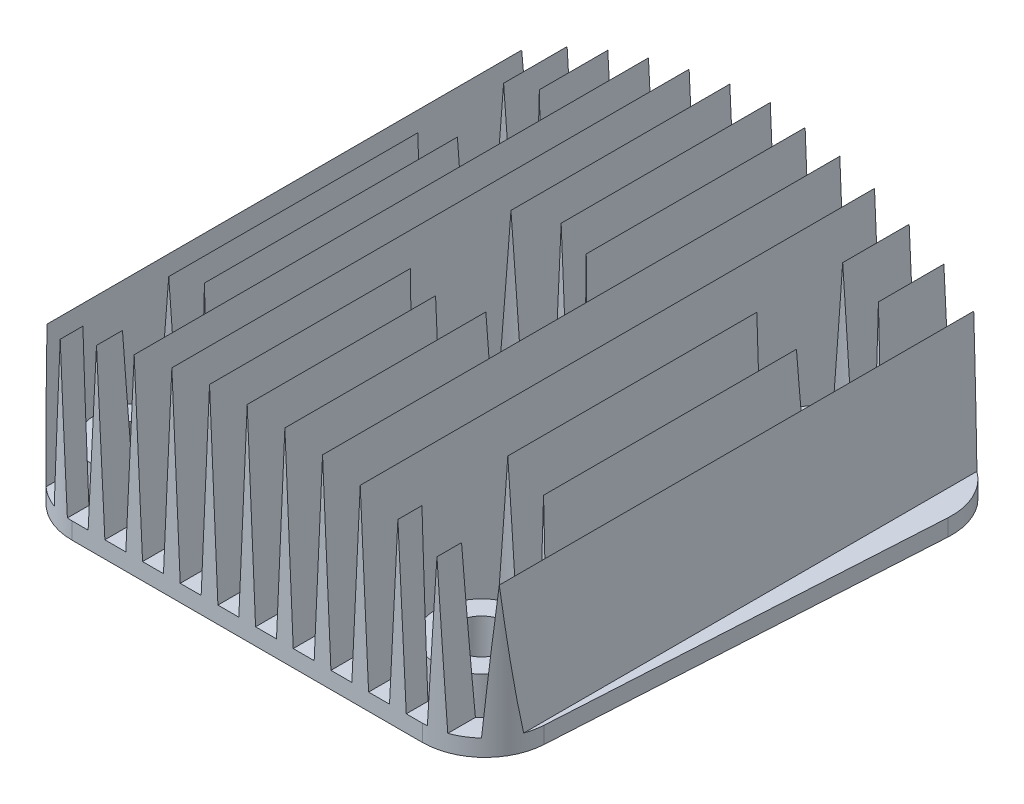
ISO-10303-21;
HEADER;
FILE_DESCRIPTION(('STEP AP214'),'2;1');
FILE_NAME('part.step','',(''),(''),'','','');
FILE_SCHEMA(('AUTOMOTIVE_DESIGN { 1 0 10303 214 1 1 1 1 }'));
ENDSEC;
DATA;
#1=APPLICATION_CONTEXT('core data for automotive mechanical design processes');
#2=APPLICATION_PROTOCOL_DEFINITION('international standard','automotive_design',2000,#1);
#3=PRODUCT_CONTEXT('',#1,'mechanical');
#4=PRODUCT('Part','Part','',(#3));
#5=PRODUCT_RELATED_PRODUCT_CATEGORY('part','',(#4));
#6=PRODUCT_DEFINITION_FORMATION('','',#4);
#7=PRODUCT_DEFINITION_CONTEXT('part definition',#1,'design');
#8=PRODUCT_DEFINITION('design','',#6,#7);
#9=PRODUCT_DEFINITION_SHAPE('','',#8);
#10=(LENGTH_UNIT() NAMED_UNIT(*) SI_UNIT(.MILLI.,.METRE.));
#11=(NAMED_UNIT(*) PLANE_ANGLE_UNIT() SI_UNIT($,.RADIAN.));
#12=(NAMED_UNIT(*) SI_UNIT($,.STERADIAN.) SOLID_ANGLE_UNIT());
#13=UNCERTAINTY_MEASURE_WITH_UNIT(LENGTH_MEASURE(1.E-05),#10,'distance_accuracy_value','');
#14=(GEOMETRIC_REPRESENTATION_CONTEXT(3) GLOBAL_UNCERTAINTY_ASSIGNED_CONTEXT((#13)) GLOBAL_UNIT_ASSIGNED_CONTEXT((#10,
#11,#12)) REPRESENTATION_CONTEXT('',''));
#15=CARTESIAN_POINT('',(0.,0.,0.));
#16=DIRECTION('',(0.,0.,1.));
#17=DIRECTION('',(1.,0.,0.));
#18=AXIS2_PLACEMENT_3D('',#15,#16,#17);
#19=CARTESIAN_POINT('',(-63.,4.,-60.));
#20=DIRECTION('',(0.,-1.,0.));
#21=DIRECTION('',(0.,0.,-1.));
#22=AXIS2_PLACEMENT_3D('',#19,#20,#21);
#23=PLANE('',#22);
#24=CARTESIAN_POINT('',(0.,4.,0.));
#25=DIRECTION('',(0.,1.,0.));
#26=DIRECTION('',(0.,0.,1.));
#27=AXIS2_PLACEMENT_3D('',#24,#25,#26);
#28=CIRCLE('',#27,15.);
#29=CARTESIAN_POINT('',(-1.98958041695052,4.,-14.8674668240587));
#30=VERTEX_POINT('',#29);
#31=CARTESIAN_POINT('',(-6.98958041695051,4.,-13.2719917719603));
#32=VERTEX_POINT('',#31);
#33=EDGE_CURVE('E1887',#30,#32,#28,.T.);
#34=ORIENTED_EDGE('',*,*,#33,.F.);
#35=DIRECTION('',(0.,0.,-1.));
#36=VECTOR('',#35,1.);
#37=CARTESIAN_POINT('',(-1.98958041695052,4.,65.));
#38=LINE('',#37,#36);
#39=CARTESIAN_POINT('',(-1.98958041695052,4.,-64.8420967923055));
#40=VERTEX_POINT('',#39);
#41=EDGE_CURVE('E1141',#30,#40,#38,.T.);
#42=ORIENTED_EDGE('',*,*,#41,.T.);
#43=DIRECTION('',(-0.996865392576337,0.,0.0791163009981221));
#44=VECTOR('',#43,1.);
#45=CARTESIAN_POINT('',(0.,4.,-65.));
#46=LINE('',#45,#44);
#47=CARTESIAN_POINT('',(-6.98958041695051,4.,-64.4452713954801));
#48=VERTEX_POINT('',#47);
#49=EDGE_CURVE('E1247',#40,#48,#46,.T.);
#50=ORIENTED_EDGE('',*,*,#49,.T.);
#51=DIRECTION('',(0.,0.,-1.));
#52=VECTOR('',#51,1.);
#53=CARTESIAN_POINT('',(-6.98958041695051,4.,65.));
#54=LINE('',#53,#52);
#55=EDGE_CURVE('E1149',#32,#48,#54,.T.);
#56=ORIENTED_EDGE('',*,*,#55,.F.);
#57=EDGE_LOOP('',(#34,#42,#50,#56));
#58=FACE_BOUND('',#57,.T.);
#59=ADVANCED_FACE('F32',(#58),#23,.F.);
#60=CARTESIAN_POINT('',(-10.9895804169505,4.,-10.2092664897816));
#61=VERTEX_POINT('',#60);
#62=CARTESIAN_POINT('',(-10.9895804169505,4.,10.2092664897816));
#63=VERTEX_POINT('',#62);
#64=EDGE_CURVE('E1896',#61,#63,#28,.T.);
#65=ORIENTED_EDGE('',*,*,#64,.F.);
#66=DIRECTION('',(0.,0.,-1.));
#67=VECTOR('',#66,1.);
#68=CARTESIAN_POINT('',(-10.9895804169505,4.,65.));
#69=LINE('',#68,#67);
#70=CARTESIAN_POINT('',(-10.9895804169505,4.,-64.1278110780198));
#71=VERTEX_POINT('',#70);
#72=EDGE_CURVE('E1151',#61,#71,#69,.T.);
#73=ORIENTED_EDGE('',*,*,#72,.T.);
#74=CARTESIAN_POINT('',(-15.9895804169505,4.,-63.7309856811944));
#75=VERTEX_POINT('',#74);
#76=EDGE_CURVE('E1251',#71,#75,#46,.T.);
#77=ORIENTED_EDGE('',*,*,#76,.T.);
#78=DIRECTION('',(0.,0.,-1.));
#79=VECTOR('',#78,1.);
#80=CARTESIAN_POINT('',(-15.9895804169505,4.,65.));
#81=LINE('',#80,#79);
#82=CARTESIAN_POINT('',(-15.9895804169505,4.,60.));
#83=VERTEX_POINT('',#82);
#84=EDGE_CURVE('E1158',#83,#75,#81,.T.);
#85=ORIENTED_EDGE('',*,*,#84,.F.);
#86=DIRECTION('',(1.,0.,0.));
#87=VECTOR('',#86,1.);
#88=CARTESIAN_POINT('',(-56.,4.,60.));
#89=LINE('',#88,#87);
#90=CARTESIAN_POINT('',(-10.9895804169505,3.99999999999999,60.));
#91=VERTEX_POINT('',#90);
#92=EDGE_CURVE('E1835',#83,#91,#89,.T.);
#93=ORIENTED_EDGE('',*,*,#92,.T.);
#94=EDGE_CURVE('E1152',#91,#63,#69,.T.);
#95=ORIENTED_EDGE('',*,*,#94,.T.);
#96=EDGE_LOOP('',(#65,#73,#77,#85,#93,#95));
#97=FACE_BOUND('',#96,.T.);
#98=ADVANCED_FACE('F1567',(#97),#23,.F.);
#99=CARTESIAN_POINT('',(-6.98958041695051,4.,13.2719917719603));
#100=VERTEX_POINT('',#99);
#101=CARTESIAN_POINT('',(-1.98958041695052,4.,14.8674668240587));
#102=VERTEX_POINT('',#101);
#103=EDGE_CURVE('E745',#100,#102,#28,.T.);
#104=ORIENTED_EDGE('',*,*,#103,.F.);
#105=CARTESIAN_POINT('',(-6.98958041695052,4.,60.));
#106=VERTEX_POINT('',#105);
#107=EDGE_CURVE('E703',#106,#100,#54,.T.);
#108=ORIENTED_EDGE('',*,*,#107,.F.);
#109=CARTESIAN_POINT('',(-1.98958041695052,3.99999999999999,60.));
#110=VERTEX_POINT('',#109);
#111=EDGE_CURVE('E1837',#106,#110,#89,.T.);
#112=ORIENTED_EDGE('',*,*,#111,.T.);
#113=EDGE_CURVE('E1142',#110,#102,#38,.T.);
#114=ORIENTED_EDGE('',*,*,#113,.T.);
#115=EDGE_LOOP('',(#104,#108,#112,#114));
#116=FACE_BOUND('',#115,.T.);
#117=ADVANCED_FACE('F1572',(#116),#23,.F.);
#118=CARTESIAN_POINT('',(2.01041958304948,4.,14.8646632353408));
#119=VERTEX_POINT('',#118);
#120=CARTESIAN_POINT('',(7.01041958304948,4.,13.2609960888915));
#121=VERTEX_POINT('',#120);
#122=EDGE_CURVE('E742',#119,#121,#28,.T.);
#123=ORIENTED_EDGE('',*,*,#122,.F.);
#124=DIRECTION('',(0.,0.,-1.));
#125=VECTOR('',#124,1.);
#126=CARTESIAN_POINT('',(2.01041958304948,4.,65.));
#127=LINE('',#126,#125);
#128=CARTESIAN_POINT('',(2.01041958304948,4.,60.));
#129=VERTEX_POINT('',#128);
#130=EDGE_CURVE('E1138',#129,#119,#127,.T.);
#131=ORIENTED_EDGE('',*,*,#130,.F.);
#132=CARTESIAN_POINT('',(7.01041958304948,4.,60.));
#133=VERTEX_POINT('',#132);
#134=EDGE_CURVE('E1446',#129,#133,#89,.T.);
#135=ORIENTED_EDGE('',*,*,#134,.T.);
#136=DIRECTION('',(0.,0.,-1.));
#137=VECTOR('',#136,1.);
#138=CARTESIAN_POINT('',(7.01041958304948,4.,65.));
#139=LINE('',#138,#137);
#140=EDGE_CURVE('E1130',#133,#121,#139,.T.);
#141=ORIENTED_EDGE('',*,*,#140,.T.);
#142=EDGE_LOOP('',(#123,#131,#135,#141));
#143=FACE_BOUND('',#142,.T.);
#144=ADVANCED_FACE('F1850',(#143),#23,.F.);
#145=CARTESIAN_POINT('',(11.0104195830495,4.,10.186788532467));
#146=VERTEX_POINT('',#145);
#147=CARTESIAN_POINT('',(11.0104195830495,4.,-10.186788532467));
#148=VERTEX_POINT('',#147);
#149=EDGE_CURVE('E744',#146,#148,#28,.T.);
#150=ORIENTED_EDGE('',*,*,#149,.F.);
#151=DIRECTION('',(0.,0.,-1.));
#152=VECTOR('',#151,1.);
#153=CARTESIAN_POINT('',(11.0104195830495,4.,65.));
#154=LINE('',#153,#152);
#155=CARTESIAN_POINT('',(11.0104195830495,4.,60.));
#156=VERTEX_POINT('',#155);
#157=EDGE_CURVE('E1126',#156,#146,#154,.T.);
#158=ORIENTED_EDGE('',*,*,#157,.F.);
#159=CARTESIAN_POINT('',(16.0104195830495,3.99999999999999,60.));
#160=VERTEX_POINT('',#159);
#161=EDGE_CURVE('E1444',#156,#160,#89,.T.);
#162=ORIENTED_EDGE('',*,*,#161,.T.);
#163=DIRECTION('',(0.,0.,-1.));
#164=VECTOR('',#163,1.);
#165=CARTESIAN_POINT('',(16.0104195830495,4.,65.));
#166=LINE('',#165,#164);
#167=CARTESIAN_POINT('',(16.0104195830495,4.,-63.729331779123));
#168=VERTEX_POINT('',#167);
#169=EDGE_CURVE('E1119',#160,#168,#166,.T.);
#170=ORIENTED_EDGE('',*,*,#169,.T.);
#171=DIRECTION('',(-0.996865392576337,0.,-0.0791163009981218));
#172=VECTOR('',#171,1.);
#173=CARTESIAN_POINT('',(63.,4.,-60.));
#174=LINE('',#173,#172);
#175=CARTESIAN_POINT('',(11.0104195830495,4.,-64.1261571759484));
#176=VERTEX_POINT('',#175);
#177=EDGE_CURVE('E1749',#168,#176,#174,.T.);
#178=ORIENTED_EDGE('',*,*,#177,.T.);
#179=EDGE_CURVE('E1125',#148,#176,#154,.T.);
#180=ORIENTED_EDGE('',*,*,#179,.F.);
#181=EDGE_LOOP('',(#150,#158,#162,#170,#178,#180));
#182=FACE_BOUND('',#181,.T.);
#183=ADVANCED_FACE('F2828',(#182),#23,.F.);
#184=CARTESIAN_POINT('',(7.01041958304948,4.,-13.2609960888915));
#185=VERTEX_POINT('',#184);
#186=CARTESIAN_POINT('',(2.01041958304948,4.,-14.8646632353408));
#187=VERTEX_POINT('',#186);
#188=EDGE_CURVE('E1898',#185,#187,#28,.T.);
#189=ORIENTED_EDGE('',*,*,#188,.F.);
#190=CARTESIAN_POINT('',(7.01041958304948,4.,-64.4436174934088));
#191=VERTEX_POINT('',#190);
#192=EDGE_CURVE('E1129',#185,#191,#139,.T.);
#193=ORIENTED_EDGE('',*,*,#192,.T.);
#194=CARTESIAN_POINT('',(2.01041958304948,4.,-64.8404428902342));
#195=VERTEX_POINT('',#194);
#196=EDGE_CURVE('E1241',#191,#195,#174,.T.);
#197=ORIENTED_EDGE('',*,*,#196,.T.);
#198=EDGE_CURVE('E1137',#187,#195,#127,.T.);
#199=ORIENTED_EDGE('',*,*,#198,.F.);
#200=EDGE_LOOP('',(#189,#193,#197,#199));
#201=FACE_BOUND('',#200,.T.);
#202=ADVANCED_FACE('F1746',(#201),#23,.F.);
#203=CARTESIAN_POINT('',(-6.98958041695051,4.,65.));
#204=DIRECTION('',(-0.99899822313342,-0.0447498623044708,0.));
#205=DIRECTION('',(0.0447498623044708,-0.99899822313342,0.));
#206=AXIS2_PLACEMENT_3D('',#203,#204,#205);
#207=PLANE('',#206);
#208=CARTESIAN_POINT('',(0.,-152.035752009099,0.));
#209=DIRECTION('',(-0.99899822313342,-0.0447498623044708,0.));
#210=DIRECTION('',(0.0447498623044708,-0.99899822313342,0.));
#211=AXIS2_PLACEMENT_3D('',#208,#209,#210);
#212=ELLIPSE('',#211,335.196562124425,15.);
#213=CARTESIAN_POINT('',(-8.98958041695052,48.6481026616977,-12.0078076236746));
#214=VERTEX_POINT('',#213);
#215=CARTESIAN_POINT('',(-7.3927330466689,13.,-13.0517239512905));
#216=VERTEX_POINT('',#215);
#217=EDGE_CURVE('E709',#214,#216,#212,.T.);
#218=ORIENTED_EDGE('',*,*,#217,.T.);
#219=EDGE_CURVE('E715',#216,#32,#212,.T.);
#220=ORIENTED_EDGE('',*,*,#219,.T.);
#221=ORIENTED_EDGE('',*,*,#55,.T.);
#222=DIRECTION('',(-0.0447495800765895,0.99899192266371,0.00355155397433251));
#223=VECTOR('',#222,1.);
#224=CARTESIAN_POINT('',(-7.01015322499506,4.45926842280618,-64.4436386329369));
#225=LINE('',#224,#223);
#226=CARTESIAN_POINT('',(-8.98958041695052,48.6481026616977,-64.28654123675));
#227=VERTEX_POINT('',#226);
#228=EDGE_CURVE('E1025',#48,#227,#225,.T.);
#229=ORIENTED_EDGE('',*,*,#228,.T.);
#230=DIRECTION('',(0.,0.,-1.));
#231=VECTOR('',#230,1.);
#232=CARTESIAN_POINT('',(-8.98958041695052,48.6481026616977,65.));
#233=LINE('',#232,#231);
#234=EDGE_CURVE('E1155',#214,#227,#233,.T.);
#235=ORIENTED_EDGE('',*,*,#234,.F.);
#236=EDGE_LOOP('',(#218,#220,#221,#229,#235));
#237=FACE_BOUND('',#236,.T.);
#238=ADVANCED_FACE('F2039',(#237),#207,.F.);
#239=CARTESIAN_POINT('',(-7.3927330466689,13.,13.0517239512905));
#240=VERTEX_POINT('',#239);
#241=EDGE_CURVE('E696',#100,#240,#212,.T.);
#242=ORIENTED_EDGE('',*,*,#241,.T.);
#243=CARTESIAN_POINT('',(-8.98958041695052,48.6481026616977,12.0078076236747));
#244=VERTEX_POINT('',#243);
#245=EDGE_CURVE('E700',#240,#244,#212,.T.);
#246=ORIENTED_EDGE('',*,*,#245,.T.);
#247=CARTESIAN_POINT('',(-8.98958041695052,48.6481026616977,60.));
#248=VERTEX_POINT('',#247);
#249=EDGE_CURVE('E1156',#248,#244,#233,.T.);
#250=ORIENTED_EDGE('',*,*,#249,.F.);
#251=DIRECTION('',(0.0447498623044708,-0.99899822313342,0.));
#252=VECTOR('',#251,1.);
#253=CARTESIAN_POINT('',(-6.98958041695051,4.,60.));
#254=LINE('',#253,#252);
#255=EDGE_CURVE('E1005',#248,#106,#254,.T.);
#256=ORIENTED_EDGE('',*,*,#255,.T.);
#257=ORIENTED_EDGE('',*,*,#107,.T.);
#258=EDGE_LOOP('',(#242,#246,#250,#256,#257));
#259=FACE_BOUND('',#258,.T.);
#260=ADVANCED_FACE('F698',(#259),#207,.F.);
#261=CARTESIAN_POINT('',(-8.98958041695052,48.6481026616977,65.));
#262=DIRECTION('',(0.99899822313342,-0.0447498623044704,0.));
#263=DIRECTION('',(0.0447498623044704,0.99899822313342,0.));
#264=AXIS2_PLACEMENT_3D('',#261,#262,#263);
#265=PLANE('',#264);
#266=CARTESIAN_POINT('',(0.,249.331957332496,0.));
#267=DIRECTION('',(0.99899822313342,-0.0447498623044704,0.));
#268=DIRECTION('',(-0.0447498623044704,-0.99899822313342,0.));
#269=AXIS2_PLACEMENT_3D('',#266,#267,#268);
#270=ELLIPSE('',#269,335.196562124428,15.);
#271=CARTESIAN_POINT('',(-10.5864277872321,13.,-10.6267373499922));
#272=VERTEX_POINT('',#271);
#273=EDGE_CURVE('E750',#61,#272,#270,.T.);
#274=ORIENTED_EDGE('',*,*,#273,.T.);
#275=EDGE_CURVE('E738',#272,#214,#270,.T.);
#276=ORIENTED_EDGE('',*,*,#275,.T.);
#277=ORIENTED_EDGE('',*,*,#234,.T.);
#278=DIRECTION('',(-0.0447495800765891,-0.99899192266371,0.00355155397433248));
#279=VECTOR('',#278,1.);
#280=CARTESIAN_POINT('',(-9.01012799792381,48.1893974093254,-64.2849104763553));
#281=LINE('',#280,#279);
#282=EDGE_CURVE('E1022',#227,#71,#281,.T.);
#283=ORIENTED_EDGE('',*,*,#282,.T.);
#284=ORIENTED_EDGE('',*,*,#72,.F.);
#285=EDGE_LOOP('',(#274,#276,#277,#283,#284));
#286=FACE_BOUND('',#285,.T.);
#287=ADVANCED_FACE('F2036',(#286),#265,.F.);
#288=CARTESIAN_POINT('',(-10.5864277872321,13.,10.6267373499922));
#289=VERTEX_POINT('',#288);
#290=EDGE_CURVE('E713',#244,#289,#270,.T.);
#291=ORIENTED_EDGE('',*,*,#290,.T.);
#292=EDGE_CURVE('E707',#289,#63,#270,.T.);
#293=ORIENTED_EDGE('',*,*,#292,.T.);
#294=ORIENTED_EDGE('',*,*,#94,.F.);
#295=DIRECTION('',(0.0447498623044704,0.99899822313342,0.));
#296=VECTOR('',#295,1.);
#297=CARTESIAN_POINT('',(-8.98958041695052,48.6481026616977,60.));
#298=LINE('',#297,#296);
#299=EDGE_CURVE('E1002',#91,#248,#298,.T.);
#300=ORIENTED_EDGE('',*,*,#299,.T.);
#301=ORIENTED_EDGE('',*,*,#249,.T.);
#302=EDGE_LOOP('',(#291,#293,#294,#300,#301));
#303=FACE_BOUND('',#302,.T.);
#304=ADVANCED_FACE('F1894',(#303),#265,.F.);
#305=CARTESIAN_POINT('',(11.0104195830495,4.,65.));
#306=DIRECTION('',(-0.998998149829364,-0.04475149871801,0.));
#307=DIRECTION('',(0.04475149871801,-0.998998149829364,0.));
#308=AXIS2_PLACEMENT_3D('',#305,#306,#307);
#309=PLANE('',#308);
#310=CARTESIAN_POINT('',(0.,249.788165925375,0.));
#311=DIRECTION('',(-0.998998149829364,-0.04475149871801,0.));
#312=DIRECTION('',(0.04475149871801,-0.998998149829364,0.));
#313=AXIS2_PLACEMENT_3D('',#310,#311,#312);
#314=ELLIPSE('',#313,335.184305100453,15.);
#315=CARTESIAN_POINT('',(10.6072521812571,13.,10.6059512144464));
#316=VERTEX_POINT('',#315);
#317=EDGE_CURVE('E755',#146,#316,#314,.T.);
#318=ORIENTED_EDGE('',*,*,#317,.T.);
#319=CARTESIAN_POINT('',(9.01041958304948,48.6464667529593,11.9921782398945));
#320=VERTEX_POINT('',#319);
#321=EDGE_CURVE('E749',#316,#320,#314,.T.);
#322=ORIENTED_EDGE('',*,*,#321,.T.);
#323=DIRECTION('',(0.,0.,-1.));
#324=VECTOR('',#323,1.);
#325=CARTESIAN_POINT('',(9.01041958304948,48.6464667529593,65.));
#326=LINE('',#325,#324);
#327=CARTESIAN_POINT('',(9.01041958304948,48.6464667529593,60.));
#328=VERTEX_POINT('',#327);
#329=EDGE_CURVE('E1134',#328,#320,#326,.T.);
#330=ORIENTED_EDGE('',*,*,#329,.F.);
#331=DIRECTION('',(0.04475149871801,-0.998998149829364,0.));
#332=VECTOR('',#331,1.);
#333=CARTESIAN_POINT('',(11.0104195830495,4.,60.));
#334=LINE('',#333,#332);
#335=EDGE_CURVE('E995',#328,#156,#334,.T.);
#336=ORIENTED_EDGE('',*,*,#335,.T.);
#337=ORIENTED_EDGE('',*,*,#157,.T.);
#338=EDGE_LOOP('',(#318,#322,#330,#336,#337));
#339=FACE_BOUND('',#338,.T.);
#340=ADVANCED_FACE('F1867',(#339),#309,.F.);
#341=CARTESIAN_POINT('',(9.01041958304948,48.6464667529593,-11.9921782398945));
#342=VERTEX_POINT('',#341);
#343=CARTESIAN_POINT('',(10.6072521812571,13.,-10.6059512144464));
#344=VERTEX_POINT('',#343);
#345=EDGE_CURVE('E751',#342,#344,#314,.T.);
#346=ORIENTED_EDGE('',*,*,#345,.T.);
#347=EDGE_CURVE('E754',#344,#148,#314,.T.);
#348=ORIENTED_EDGE('',*,*,#347,.T.);
#349=ORIENTED_EDGE('',*,*,#179,.T.);
#350=DIRECTION('',(-0.0447512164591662,0.998991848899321,-0.00355168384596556));
#351=VECTOR('',#350,1.);
#352=CARTESIAN_POINT('',(11.0309431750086,3.54184706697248,-64.1245283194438));
#353=LINE('',#352,#351);
#354=CARTESIAN_POINT('',(9.01041958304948,48.6464667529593,-64.2848873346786));
#355=VERTEX_POINT('',#354);
#356=EDGE_CURVE('E974',#176,#355,#353,.T.);
#357=ORIENTED_EDGE('',*,*,#356,.T.);
#358=EDGE_CURVE('E1133',#342,#355,#326,.T.);
#359=ORIENTED_EDGE('',*,*,#358,.F.);
#360=EDGE_LOOP('',(#346,#348,#349,#357,#359));
#361=FACE_BOUND('',#360,.T.);
#362=ADVANCED_FACE('F2025',(#361),#309,.F.);
#363=CARTESIAN_POINT('',(9.01041958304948,48.6464667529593,65.));
#364=DIRECTION('',(0.998998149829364,-0.0447514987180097,0.));
#365=DIRECTION('',(0.0447514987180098,0.998998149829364,0.));
#366=AXIS2_PLACEMENT_3D('',#363,#364,#365);
#367=PLANE('',#366);
#368=CARTESIAN_POINT('',(0.,-152.495232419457,0.));
#369=DIRECTION('',(0.998998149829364,-0.0447514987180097,0.));
#370=DIRECTION('',(-0.0447514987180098,-0.998998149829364,0.));
#371=AXIS2_PLACEMENT_3D('',#368,#369,#370);
#372=ELLIPSE('',#371,335.184305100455,15.);
#373=CARTESIAN_POINT('',(7.41358698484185,13.,13.0398898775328));
#374=VERTEX_POINT('',#373);
#375=EDGE_CURVE('E756',#320,#374,#372,.T.);
#376=ORIENTED_EDGE('',*,*,#375,.T.);
#377=EDGE_CURVE('E760',#374,#121,#372,.T.);
#378=ORIENTED_EDGE('',*,*,#377,.T.);
#379=ORIENTED_EDGE('',*,*,#140,.F.);
#380=DIRECTION('',(0.0447514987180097,0.998998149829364,0.));
#381=VECTOR('',#380,1.);
#382=CARTESIAN_POINT('',(9.01041958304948,48.6464667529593,60.));
#383=LINE('',#382,#381);
#384=EDGE_CURVE('E992',#133,#328,#383,.T.);
#385=ORIENTED_EDGE('',*,*,#384,.T.);
#386=ORIENTED_EDGE('',*,*,#329,.T.);
#387=EDGE_LOOP('',(#376,#378,#379,#385,#386));
#388=FACE_BOUND('',#387,.T.);
#389=ADVANCED_FACE('F1852',(#388),#367,.F.);
#390=CARTESIAN_POINT('',(7.41358698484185,13.,-13.0398898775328));
#391=VERTEX_POINT('',#390);
#392=EDGE_CURVE('E761',#185,#391,#372,.T.);
#393=ORIENTED_EDGE('',*,*,#392,.T.);
#394=EDGE_CURVE('E759',#391,#342,#372,.T.);
#395=ORIENTED_EDGE('',*,*,#394,.T.);
#396=ORIENTED_EDGE('',*,*,#358,.T.);
#397=DIRECTION('',(-0.044751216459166,-0.998991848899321,-0.00355168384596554));
#398=VECTOR('',#397,1.);
#399=CARTESIAN_POINT('',(9.0309684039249,49.1051828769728,-64.283256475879));
#400=LINE('',#399,#398);
#401=EDGE_CURVE('E971',#355,#191,#400,.T.);
#402=ORIENTED_EDGE('',*,*,#401,.T.);
#403=ORIENTED_EDGE('',*,*,#192,.F.);
#404=EDGE_LOOP('',(#393,#395,#396,#402,#403));
#405=FACE_BOUND('',#404,.T.);
#406=ADVANCED_FACE('F2024',(#405),#367,.F.);
#407=CARTESIAN_POINT('',(2.01041958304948,4.,65.));
#408=DIRECTION('',(-0.99901380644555,-0.0444006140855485,0.));
#409=DIRECTION('',(0.0444006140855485,-0.99901380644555,0.));
#410=AXIS2_PLACEMENT_3D('',#407,#408,#409);
#411=PLANE('',#410);
#412=CARTESIAN_POINT('',(0.,49.2344401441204,0.));
#413=DIRECTION('',(-0.99901380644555,-0.0444006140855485,0.));
#414=DIRECTION('',(0.0444006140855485,-0.99901380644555,0.));
#415=AXIS2_PLACEMENT_3D('',#412,#413,#414);
#416=ELLIPSE('',#415,337.833165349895,15.);
#417=CARTESIAN_POINT('',(1.61041957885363,13.,14.9133010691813));
#418=VERTEX_POINT('',#417);
#419=EDGE_CURVE('E770',#119,#418,#416,.T.);
#420=ORIENTED_EDGE('',*,*,#419,.T.);
#421=CARTESIAN_POINT('',(0.0104195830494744,48.9999995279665,14.9999963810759));
#422=VERTEX_POINT('',#421);
#423=EDGE_CURVE('E47',#418,#422,#416,.T.);
#424=ORIENTED_EDGE('',*,*,#423,.T.);
#425=DIRECTION('',(0.,0.,-1.));
#426=VECTOR('',#425,1.);
#427=CARTESIAN_POINT('',(0.0104195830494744,48.9999995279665,65.));
#428=LINE('',#427,#426);
#429=CARTESIAN_POINT('',(0.0104195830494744,48.9999995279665,60.));
#430=VERTEX_POINT('',#429);
#431=EDGE_CURVE('E1146',#430,#422,#428,.T.);
#432=ORIENTED_EDGE('',*,*,#431,.F.);
#433=DIRECTION('',(0.0444006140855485,-0.99901380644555,0.));
#434=VECTOR('',#433,1.);
#435=CARTESIAN_POINT('',(2.01041958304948,4.,60.));
#436=LINE('',#435,#434);
#437=EDGE_CURVE('E1000',#430,#129,#436,.T.);
#438=ORIENTED_EDGE('',*,*,#437,.T.);
#439=ORIENTED_EDGE('',*,*,#130,.T.);
#440=EDGE_LOOP('',(#420,#424,#432,#438,#439));
#441=FACE_BOUND('',#440,.T.);
#442=ADVANCED_FACE('F2032',(#441),#411,.F.);
#443=CARTESIAN_POINT('',(0.0104195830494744,48.9999995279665,-14.9999963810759));
#444=VERTEX_POINT('',#443);
#445=CARTESIAN_POINT('',(1.61041957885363,13.,-14.9133010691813));
#446=VERTEX_POINT('',#445);
#447=EDGE_CURVE('E766',#444,#446,#416,.T.);
#448=ORIENTED_EDGE('',*,*,#447,.T.);
#449=EDGE_CURVE('E769',#446,#187,#416,.T.);
#450=ORIENTED_EDGE('',*,*,#449,.T.);
#451=ORIENTED_EDGE('',*,*,#198,.T.);
#452=DIRECTION('',(-0.0444003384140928,0.999007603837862,-0.00352383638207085));
#453=VECTOR('',#452,1.);
#454=CARTESIAN_POINT('',(2.03073435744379,3.54291758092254,-64.8388306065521));
#455=LINE('',#454,#453);
#456=CARTESIAN_POINT('',(1.18674451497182,22.5326888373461,-64.9058139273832));
#457=VERTEX_POINT('',#456);
#458=EDGE_CURVE('E977',#195,#457,#455,.T.);
#459=ORIENTED_EDGE('',*,*,#458,.T.);
#460=CARTESIAN_POINT('',(0.,49.2344401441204,-49.9528330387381));
#461=DIRECTION('',(-0.99901380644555,-0.0444006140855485,0.));
#462=DIRECTION('',(0.0444006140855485,-0.99901380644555,0.));
#463=AXIS2_PLACEMENT_3D('',#460,#461,#462);
#464=ELLIPSE('',#463,337.833165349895,15.);
#465=CARTESIAN_POINT('',(0.0104195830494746,48.9999995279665,-64.952829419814));
#466=VERTEX_POINT('',#465);
#467=EDGE_CURVE('E1050',#457,#466,#464,.F.);
#468=ORIENTED_EDGE('',*,*,#467,.T.);
#469=EDGE_CURVE('E1145',#444,#466,#428,.T.);
#470=ORIENTED_EDGE('',*,*,#469,.F.);
#471=EDGE_LOOP('',(#448,#450,#451,#459,#468,#470));
#472=FACE_BOUND('',#471,.T.);
#473=ADVANCED_FACE('F1739',(#472),#411,.F.);
#474=CARTESIAN_POINT('',(0.0104195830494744,48.9999995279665,65.));
#475=DIRECTION('',(0.99901380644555,-0.0444006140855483,0.));
#476=DIRECTION('',(0.0444006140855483,0.99901380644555,0.));
#477=AXIS2_PLACEMENT_3D('',#474,#475,#476);
#478=PLANE('',#477);
#479=CARTESIAN_POINT('',(0.,48.7655589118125,0.));
#480=DIRECTION('',(0.99901380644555,-0.0444006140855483,0.));
#481=DIRECTION('',(-0.0444006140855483,-0.99901380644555,0.));
#482=AXIS2_PLACEMENT_3D('',#479,#480,#481);
#483=ELLIPSE('',#482,337.833165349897,15.);
#484=CARTESIAN_POINT('',(-1.58958041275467,13.,14.9155366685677));
#485=VERTEX_POINT('',#484);
#486=EDGE_CURVE('E762',#422,#485,#483,.T.);
#487=ORIENTED_EDGE('',*,*,#486,.T.);
#488=EDGE_CURVE('E720',#485,#102,#483,.T.);
#489=ORIENTED_EDGE('',*,*,#488,.T.);
#490=ORIENTED_EDGE('',*,*,#113,.F.);
#491=DIRECTION('',(0.0444006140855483,0.99901380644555,0.));
#492=VECTOR('',#491,1.);
#493=CARTESIAN_POINT('',(0.0104195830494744,48.9999995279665,60.));
#494=LINE('',#493,#492);
#495=EDGE_CURVE('E997',#110,#430,#494,.T.);
#496=ORIENTED_EDGE('',*,*,#495,.T.);
#497=ORIENTED_EDGE('',*,*,#431,.T.);
#498=EDGE_LOOP('',(#487,#489,#490,#496,#497));
#499=FACE_BOUND('',#498,.T.);
#500=ADVANCED_FACE('F2028',(#499),#478,.F.);
#501=CARTESIAN_POINT('',(-1.58958041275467,13.,-14.9155366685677));
#502=VERTEX_POINT('',#501);
#503=EDGE_CURVE('E765',#30,#502,#483,.T.);
#504=ORIENTED_EDGE('',*,*,#503,.T.);
#505=EDGE_CURVE('E764',#502,#444,#483,.T.);
#506=ORIENTED_EDGE('',*,*,#505,.T.);
#507=ORIENTED_EDGE('',*,*,#469,.T.);
#508=CARTESIAN_POINT('',(0.,48.7655589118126,-49.9528330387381));
#509=DIRECTION('',(0.99901380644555,-0.0444006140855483,0.));
#510=DIRECTION('',(-0.0444006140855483,-0.99901380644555,0.));
#511=AXIS2_PLACEMENT_3D('',#508,#509,#510);
#512=ELLIPSE('',#511,337.833165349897,15.);
#513=CARTESIAN_POINT('',(-1.18674451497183,22.0638076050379,-64.9058139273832));
#514=VERTEX_POINT('',#513);
#515=EDGE_CURVE('E1328',#466,#514,#512,.F.);
#516=ORIENTED_EDGE('',*,*,#515,.T.);
#517=DIRECTION('',(-0.0444003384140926,-0.999007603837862,0.00352383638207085));
#518=VECTOR('',#517,1.);
#519=CARTESIAN_POINT('',(-0.00992028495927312,48.5423525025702,-64.9992126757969));
#520=LINE('',#519,#518);
#521=EDGE_CURVE('E1325',#514,#40,#520,.T.);
#522=ORIENTED_EDGE('',*,*,#521,.T.);
#523=ORIENTED_EDGE('',*,*,#41,.F.);
#524=EDGE_LOOP('',(#504,#506,#507,#516,#522,#523));
#525=FACE_BOUND('',#524,.T.);
#526=ADVANCED_FACE('F1736',(#525),#478,.F.);
#527=CARTESIAN_POINT('',(40.,4.00000000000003,-36.));
#528=DIRECTION('',(0.,1.,0.));
#529=DIRECTION('',(0.,0.,1.));
#530=AXIS2_PLACEMENT_3D('',#527,#528,#529);
#531=CIRCLE('',#530,11.);
#532=CARTESIAN_POINT('',(34.0104195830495,4.00000000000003,-45.2263170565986));
#533=VERTEX_POINT('',#532);
#534=CARTESIAN_POINT('',(29.0104195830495,4.,-36.4786671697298));
#535=VERTEX_POINT('',#534);
#536=EDGE_CURVE('E1542',#533,#535,#531,.T.);
#537=ORIENTED_EDGE('',*,*,#536,.F.);
#538=DIRECTION('',(0.,0.,-1.));
#539=VECTOR('',#538,1.);
#540=CARTESIAN_POINT('',(34.0104195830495,4.,65.));
#541=LINE('',#540,#539);
#542=CARTESIAN_POINT('',(34.0104195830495,4.,-62.3007603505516));
#543=VERTEX_POINT('',#542);
#544=EDGE_CURVE('E1094',#533,#543,#541,.T.);
#545=ORIENTED_EDGE('',*,*,#544,.T.);
#546=CARTESIAN_POINT('',(29.0104195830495,4.,-62.697585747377));
#547=VERTEX_POINT('',#546);
#548=EDGE_CURVE('E1517',#543,#547,#174,.T.);
#549=ORIENTED_EDGE('',*,*,#548,.T.);
#550=DIRECTION('',(0.,0.,-1.));
#551=VECTOR('',#550,1.);
#552=CARTESIAN_POINT('',(29.0104195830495,4.,65.));
#553=LINE('',#552,#551);
#554=EDGE_CURVE('E1104',#535,#547,#553,.T.);
#555=ORIENTED_EDGE('',*,*,#554,.F.);
#556=EDGE_LOOP('',(#537,#545,#549,#555));
#557=FACE_BOUND('',#556,.T.);
#558=ADVANCED_FACE('F1562',(#557),#23,.F.);
#559=CARTESIAN_POINT('',(29.0104195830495,4.,-35.5213328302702));
#560=VERTEX_POINT('',#559);
#561=CARTESIAN_POINT('',(34.0104195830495,4.,-26.7736829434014));
#562=VERTEX_POINT('',#561);
#563=EDGE_CURVE('E798',#560,#562,#531,.T.);
#564=ORIENTED_EDGE('',*,*,#563,.F.);
#565=CARTESIAN_POINT('',(29.0104195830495,4.,43.5213328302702));
#566=VERTEX_POINT('',#565);
#567=EDGE_CURVE('E1110',#566,#560,#553,.T.);
#568=ORIENTED_EDGE('',*,*,#567,.F.);
#569=CARTESIAN_POINT('',(40.,4.00000000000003,44.));
#570=DIRECTION('',(0.,1.,0.));
#571=DIRECTION('',(0.,0.,1.));
#572=AXIS2_PLACEMENT_3D('',#569,#570,#571);
#573=CIRCLE('',#572,11.);
#574=CARTESIAN_POINT('',(34.0104195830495,4.00000000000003,34.7736829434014));
#575=VERTEX_POINT('',#574);
#576=EDGE_CURVE('E1404',#575,#566,#573,.T.);
#577=ORIENTED_EDGE('',*,*,#576,.F.);
#578=EDGE_CURVE('E1100',#575,#562,#541,.T.);
#579=ORIENTED_EDGE('',*,*,#578,.T.);
#580=EDGE_LOOP('',(#564,#568,#577,#579));
#581=FACE_BOUND('',#580,.T.);
#582=ADVANCED_FACE('F1538',(#581),#23,.F.);
#583=CARTESIAN_POINT('',(38.0104195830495,4.,-25.181424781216));
#584=VERTEX_POINT('',#583);
#585=CARTESIAN_POINT('',(43.0104195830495,4.,-25.4199539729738));
#586=VERTEX_POINT('',#585);
#587=EDGE_CURVE('E787',#584,#586,#531,.T.);
#588=ORIENTED_EDGE('',*,*,#587,.F.);
#589=DIRECTION('',(0.,0.,-1.));
#590=VECTOR('',#589,1.);
#591=CARTESIAN_POINT('',(38.0104195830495,4.,65.));
#592=LINE('',#591,#590);
#593=CARTESIAN_POINT('',(38.0104195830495,4.,33.181424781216));
#594=VERTEX_POINT('',#593);
#595=EDGE_CURVE('E1095',#594,#584,#592,.T.);
#596=ORIENTED_EDGE('',*,*,#595,.F.);
#597=CARTESIAN_POINT('',(43.0104195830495,4.00000000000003,33.4199539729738));
#598=VERTEX_POINT('',#597);
#599=EDGE_CURVE('E1400',#598,#594,#573,.T.);
#600=ORIENTED_EDGE('',*,*,#599,.F.);
#601=DIRECTION('',(0.,0.,-1.));
#602=VECTOR('',#601,1.);
#603=CARTESIAN_POINT('',(43.0104195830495,4.,65.));
#604=LINE('',#603,#602);
#605=EDGE_CURVE('E1085',#598,#586,#604,.T.);
#606=ORIENTED_EDGE('',*,*,#605,.T.);
#607=EDGE_LOOP('',(#588,#596,#600,#606));
#608=FACE_BOUND('',#607,.T.);
#609=ADVANCED_FACE('F1554',(#608),#23,.F.);
#610=CARTESIAN_POINT('',(47.0104195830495,4.,-27.5233251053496));
#611=VERTEX_POINT('',#610);
#612=CARTESIAN_POINT('',(47.0104195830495,4.,-44.4766748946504));
#613=VERTEX_POINT('',#612);
#614=EDGE_CURVE('E799',#611,#613,#531,.T.);
#615=ORIENTED_EDGE('',*,*,#614,.F.);
#616=DIRECTION('',(0.,0.,-1.));
#617=VECTOR('',#616,1.);
#618=CARTESIAN_POINT('',(47.0104195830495,4.,65.));
#619=LINE('',#618,#617);
#620=CARTESIAN_POINT('',(47.0104195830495,4.,35.5233251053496));
#621=VERTEX_POINT('',#620);
#622=EDGE_CURVE('E1080',#621,#611,#619,.T.);
#623=ORIENTED_EDGE('',*,*,#622,.F.);
#624=CARTESIAN_POINT('',(47.0104195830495,4.,52.4766748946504));
#625=VERTEX_POINT('',#624);
#626=EDGE_CURVE('E819',#625,#621,#573,.T.);
#627=ORIENTED_EDGE('',*,*,#626,.F.);
#628=CARTESIAN_POINT('',(47.0104195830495,4.,59.0842080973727));
#629=VERTEX_POINT('',#628);
#630=EDGE_CURVE('E1076',#629,#625,#619,.T.);
#631=ORIENTED_EDGE('',*,*,#630,.F.);
#632=CARTESIAN_POINT('',(41.8495008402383,4.,45.));
#633=DIRECTION('',(0.,-1.,0.));
#634=DIRECTION('',(0.,0.,-1.));
#635=AXIS2_PLACEMENT_3D('',#632,#633,#634);
#636=CIRCLE('',#635,15.);
#637=CARTESIAN_POINT('',(52.0104195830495,4.,56.0342979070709));
#638=VERTEX_POINT('',#637);
#639=EDGE_CURVE('E1290',#629,#638,#636,.F.);
#640=ORIENTED_EDGE('',*,*,#639,.T.);
#641=DIRECTION('',(0.,0.,-1.));
#642=VECTOR('',#641,1.);
#643=CARTESIAN_POINT('',(52.0104195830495,4.,65.));
#644=LINE('',#643,#642);
#645=CARTESIAN_POINT('',(52.0104195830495,4.,-60.4067386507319));
#646=VERTEX_POINT('',#645);
#647=EDGE_CURVE('E1069',#638,#646,#644,.T.);
#648=ORIENTED_EDGE('',*,*,#647,.T.);
#649=CARTESIAN_POINT('',(47.1700363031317,4.,-46.2091793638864));
#650=DIRECTION('',(0.,-1.,0.));
#651=DIRECTION('',(0.,0.,-1.));
#652=AXIS2_PLACEMENT_3D('',#649,#650,#651);
#653=CIRCLE('',#652,15.);
#654=CARTESIAN_POINT('',(48.3567808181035,4.,-61.1621602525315));
#655=VERTEX_POINT('',#654);
#656=EDGE_CURVE('E1294',#646,#655,#653,.F.);
#657=ORIENTED_EDGE('',*,*,#656,.T.);
#658=CARTESIAN_POINT('',(47.0104195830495,4.,-61.2690143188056));
#659=VERTEX_POINT('',#658);
#660=EDGE_CURVE('E1242',#655,#659,#174,.T.);
#661=ORIENTED_EDGE('',*,*,#660,.T.);
#662=EDGE_CURVE('E1075',#613,#659,#619,.T.);
#663=ORIENTED_EDGE('',*,*,#662,.F.);
#664=EDGE_LOOP('',(#615,#623,#627,#631,#640,#648,#657,#661,#663));
#665=FACE_BOUND('',#664,.T.);
#666=ADVANCED_FACE('F1392',(#665),#23,.F.);
#667=CARTESIAN_POINT('',(43.0104195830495,4.00000000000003,-46.5800460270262));
#668=VERTEX_POINT('',#667);
#669=CARTESIAN_POINT('',(38.0104195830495,4.,-46.818575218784));
#670=VERTEX_POINT('',#669);
#671=EDGE_CURVE('E1543',#668,#670,#531,.T.);
#672=ORIENTED_EDGE('',*,*,#671,.F.);
#673=CARTESIAN_POINT('',(43.0104195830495,4.,-61.5864746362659));
#674=VERTEX_POINT('',#673);
#675=EDGE_CURVE('E1079',#668,#674,#604,.T.);
#676=ORIENTED_EDGE('',*,*,#675,.T.);
#677=CARTESIAN_POINT('',(38.0104195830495,4.,-61.9833000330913));
#678=VERTEX_POINT('',#677);
#679=EDGE_CURVE('E1246',#674,#678,#174,.T.);
#680=ORIENTED_EDGE('',*,*,#679,.T.);
#681=EDGE_CURVE('E1089',#670,#678,#592,.T.);
#682=ORIENTED_EDGE('',*,*,#681,.F.);
#683=EDGE_LOOP('',(#672,#676,#680,#682));
#684=FACE_BOUND('',#683,.T.);
#685=ADVANCED_FACE('F1561',(#684),#23,.F.);
#686=CARTESIAN_POINT('',(-41.,4.,-36.));
#687=DIRECTION('',(0.,1.,0.));
#688=DIRECTION('',(0.,0.,1.));
#689=AXIS2_PLACEMENT_3D('',#686,#687,#688);
#690=CIRCLE('',#689,11.);
#691=CARTESIAN_POINT('',(-46.9895804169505,4.,-45.2263170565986));
#692=VERTEX_POINT('',#691);
#693=CARTESIAN_POINT('',(-51.9895804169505,4.,-36.4786671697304));
#694=VERTEX_POINT('',#693);
#695=EDGE_CURVE('E1779',#692,#694,#690,.T.);
#696=ORIENTED_EDGE('',*,*,#695,.F.);
#697=DIRECTION('',(0.,0.,-1.));
#698=VECTOR('',#697,1.);
#699=CARTESIAN_POINT('',(-46.9895804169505,4.,65.));
#700=LINE('',#699,#698);
#701=CARTESIAN_POINT('',(-46.9895804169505,4.,-61.2706682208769));
#702=VERTEX_POINT('',#701);
#703=EDGE_CURVE('E1195',#692,#702,#700,.T.);
#704=ORIENTED_EDGE('',*,*,#703,.T.);
#705=CARTESIAN_POINT('',(-48.3567808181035,4.,-61.1621602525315));
#706=VERTEX_POINT('',#705);
#707=EDGE_CURVE('E1245',#702,#706,#46,.T.);
#708=ORIENTED_EDGE('',*,*,#707,.T.);
#709=CARTESIAN_POINT('',(-47.1700363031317,4.,-46.2091793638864));
#710=DIRECTION('',(0.,-1.,0.));
#711=DIRECTION('',(0.,0.,-1.));
#712=AXIS2_PLACEMENT_3D('',#709,#710,#711);
#713=CIRCLE('',#712,15.);
#714=CARTESIAN_POINT('',(-51.9895804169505,4.,-60.413826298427));
#715=VERTEX_POINT('',#714);
#716=EDGE_CURVE('E1300',#706,#715,#713,.F.);
#717=ORIENTED_EDGE('',*,*,#716,.T.);
#718=DIRECTION('',(0.,0.,-1.));
#719=VECTOR('',#718,1.);
#720=CARTESIAN_POINT('',(-51.9895804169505,4.,65.));
#721=LINE('',#720,#719);
#722=EDGE_CURVE('E1212',#694,#715,#721,.T.);
#723=ORIENTED_EDGE('',*,*,#722,.F.);
#724=EDGE_LOOP('',(#696,#704,#708,#717,#723));
#725=FACE_BOUND('',#724,.T.);
#726=ADVANCED_FACE('F1623',(#725),#23,.F.);
#727=CARTESIAN_POINT('',(-51.9895804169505,4.,-35.5213328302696));
#728=VERTEX_POINT('',#727);
#729=CARTESIAN_POINT('',(-46.9895804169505,4.,-26.7736829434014));
#730=VERTEX_POINT('',#729);
#731=EDGE_CURVE('E808',#728,#730,#690,.T.);
#732=ORIENTED_EDGE('',*,*,#731,.F.);
#733=CARTESIAN_POINT('',(-51.9895804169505,4.,43.5213328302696));
#734=VERTEX_POINT('',#733);
#735=EDGE_CURVE('E1211',#734,#728,#721,.T.);
#736=ORIENTED_EDGE('',*,*,#735,.F.);
#737=CARTESIAN_POINT('',(-41.,4.,44.));
#738=DIRECTION('',(0.,1.,0.));
#739=DIRECTION('',(0.,0.,1.));
#740=AXIS2_PLACEMENT_3D('',#737,#738,#739);
#741=CIRCLE('',#740,11.);
#742=CARTESIAN_POINT('',(-46.9895804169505,4.,34.7736829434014));
#743=VERTEX_POINT('',#742);
#744=EDGE_CURVE('E1652',#743,#734,#741,.T.);
#745=ORIENTED_EDGE('',*,*,#744,.F.);
#746=EDGE_CURVE('E1201',#743,#730,#700,.T.);
#747=ORIENTED_EDGE('',*,*,#746,.T.);
#748=EDGE_LOOP('',(#732,#736,#745,#747));
#749=FACE_BOUND('',#748,.T.);
#750=ADVANCED_FACE('F1760',(#749),#23,.F.);
#751=CARTESIAN_POINT('',(-42.9895804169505,4.,-25.181424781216));
#752=VERTEX_POINT('',#751);
#753=CARTESIAN_POINT('',(-37.9895804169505,4.,-25.4199539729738));
#754=VERTEX_POINT('',#753);
#755=EDGE_CURVE('E793',#752,#754,#690,.T.);
#756=ORIENTED_EDGE('',*,*,#755,.F.);
#757=DIRECTION('',(0.,0.,-1.));
#758=VECTOR('',#757,1.);
#759=CARTESIAN_POINT('',(-42.9895804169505,4.,65.));
#760=LINE('',#759,#758);
#761=CARTESIAN_POINT('',(-42.9895804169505,4.,33.181424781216));
#762=VERTEX_POINT('',#761);
#763=EDGE_CURVE('E1196',#762,#752,#760,.T.);
#764=ORIENTED_EDGE('',*,*,#763,.F.);
#765=CARTESIAN_POINT('',(-37.9895804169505,4.,33.4199539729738));
#766=VERTEX_POINT('',#765);
#767=EDGE_CURVE('E1654',#766,#762,#741,.T.);
#768=ORIENTED_EDGE('',*,*,#767,.F.);
#769=DIRECTION('',(0.,0.,-1.));
#770=VECTOR('',#769,1.);
#771=CARTESIAN_POINT('',(-37.9895804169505,4.,65.));
#772=LINE('',#771,#770);
#773=EDGE_CURVE('E1186',#766,#754,#772,.T.);
#774=ORIENTED_EDGE('',*,*,#773,.T.);
#775=EDGE_LOOP('',(#756,#764,#768,#774));
#776=FACE_BOUND('',#775,.T.);
#777=ADVANCED_FACE('F1764',(#776),#23,.F.);
#778=CARTESIAN_POINT('',(-33.9895804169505,4.,-27.5233251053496));
#779=VERTEX_POINT('',#778);
#780=CARTESIAN_POINT('',(-33.9895804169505,4.,-44.4766748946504));
#781=VERTEX_POINT('',#780);
#782=EDGE_CURVE('E809',#779,#781,#690,.T.);
#783=ORIENTED_EDGE('',*,*,#782,.F.);
#784=DIRECTION('',(0.,0.,-1.));
#785=VECTOR('',#784,1.);
#786=CARTESIAN_POINT('',(-33.9895804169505,4.,65.));
#787=LINE('',#786,#785);
#788=CARTESIAN_POINT('',(-33.9895804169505,4.,35.5233251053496));
#789=VERTEX_POINT('',#788);
#790=EDGE_CURVE('E1181',#789,#779,#787,.T.);
#791=ORIENTED_EDGE('',*,*,#790,.F.);
#792=CARTESIAN_POINT('',(-33.9895804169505,4.,52.4766748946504));
#793=VERTEX_POINT('',#792);
#794=EDGE_CURVE('E913',#793,#789,#741,.T.);
#795=ORIENTED_EDGE('',*,*,#794,.F.);
#796=CARTESIAN_POINT('',(-33.9895804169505,4.,60.));
#797=VERTEX_POINT('',#796);
#798=EDGE_CURVE('E1177',#797,#793,#787,.T.);
#799=ORIENTED_EDGE('',*,*,#798,.F.);
#800=CARTESIAN_POINT('',(-28.9895804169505,3.99999999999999,60.));
#801=VERTEX_POINT('',#800);
#802=EDGE_CURVE('E1238',#797,#801,#89,.T.);
#803=ORIENTED_EDGE('',*,*,#802,.T.);
#804=DIRECTION('',(0.,0.,-1.));
#805=VECTOR('',#804,1.);
#806=CARTESIAN_POINT('',(-28.9895804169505,4.,65.));
#807=LINE('',#806,#805);
#808=CARTESIAN_POINT('',(-28.9895804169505,4.,-62.6992396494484));
#809=VERTEX_POINT('',#808);
#810=EDGE_CURVE('E1170',#801,#809,#807,.T.);
#811=ORIENTED_EDGE('',*,*,#810,.T.);
#812=CARTESIAN_POINT('',(-33.9895804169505,4.,-62.302414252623));
#813=VERTEX_POINT('',#812);
#814=EDGE_CURVE('E1610',#809,#813,#46,.T.);
#815=ORIENTED_EDGE('',*,*,#814,.T.);
#816=EDGE_CURVE('E1176',#781,#813,#787,.T.);
#817=ORIENTED_EDGE('',*,*,#816,.F.);
#818=EDGE_LOOP('',(#783,#791,#795,#799,#803,#811,#815,#817));
#819=FACE_BOUND('',#818,.T.);
#820=ADVANCED_FACE('F1769',(#819),#23,.F.);
#821=CARTESIAN_POINT('',(-37.9895804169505,4.,-46.5800460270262));
#822=VERTEX_POINT('',#821);
#823=CARTESIAN_POINT('',(-42.9895804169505,4.,-46.818575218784));
#824=VERTEX_POINT('',#823);
#825=EDGE_CURVE('E1784',#822,#824,#690,.T.);
#826=ORIENTED_EDGE('',*,*,#825,.F.);
#827=CARTESIAN_POINT('',(-37.9895804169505,4.,-61.9849539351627));
#828=VERTEX_POINT('',#827);
#829=EDGE_CURVE('E1180',#822,#828,#772,.T.);
#830=ORIENTED_EDGE('',*,*,#829,.T.);
#831=CARTESIAN_POINT('',(-42.9895804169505,4.,-61.5881285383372));
#832=VERTEX_POINT('',#831);
#833=EDGE_CURVE('E1613',#828,#832,#46,.T.);
#834=ORIENTED_EDGE('',*,*,#833,.T.);
#835=EDGE_CURVE('E1190',#824,#832,#760,.T.);
#836=ORIENTED_EDGE('',*,*,#835,.F.);
#837=EDGE_LOOP('',(#826,#830,#834,#836));
#838=FACE_BOUND('',#837,.T.);
#839=ADVANCED_FACE('F2355',(#838),#23,.F.);
#840=CARTESIAN_POINT('',(29.0104195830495,4.,44.4786671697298));
#841=VERTEX_POINT('',#840);
#842=CARTESIAN_POINT('',(34.0104195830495,4.,53.2263170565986));
#843=VERTEX_POINT('',#842);
#844=EDGE_CURVE('E818',#841,#843,#573,.T.);
#845=ORIENTED_EDGE('',*,*,#844,.F.);
#846=CARTESIAN_POINT('',(29.0104195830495,4.,60.));
#847=VERTEX_POINT('',#846);
#848=EDGE_CURVE('E1106',#847,#841,#553,.T.);
#849=ORIENTED_EDGE('',*,*,#848,.F.);
#850=CARTESIAN_POINT('',(34.0104195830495,4.,60.));
#851=VERTEX_POINT('',#850);
#852=EDGE_CURVE('E1433',#847,#851,#89,.T.);
#853=ORIENTED_EDGE('',*,*,#852,.T.);
#854=EDGE_CURVE('E1096',#851,#843,#541,.T.);
#855=ORIENTED_EDGE('',*,*,#854,.T.);
#856=EDGE_LOOP('',(#845,#849,#853,#855));
#857=FACE_BOUND('',#856,.T.);
#858=ADVANCED_FACE('F1419',(#857),#23,.F.);
#859=CARTESIAN_POINT('',(38.0104195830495,4.,54.818575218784));
#860=VERTEX_POINT('',#859);
#861=CARTESIAN_POINT('',(43.0104195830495,4.,54.5800460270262));
#862=VERTEX_POINT('',#861);
#863=EDGE_CURVE('E803',#860,#862,#573,.T.);
#864=ORIENTED_EDGE('',*,*,#863,.F.);
#865=CARTESIAN_POINT('',(38.0104195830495,4.,60.));
#866=VERTEX_POINT('',#865);
#867=EDGE_CURVE('E1091',#866,#860,#592,.T.);
#868=ORIENTED_EDGE('',*,*,#867,.F.);
#869=CARTESIAN_POINT('',(41.8495008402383,4.,60.));
#870=VERTEX_POINT('',#869);
#871=EDGE_CURVE('E1232',#866,#870,#89,.T.);
#872=ORIENTED_EDGE('',*,*,#871,.T.);
#873=CARTESIAN_POINT('',(43.0104195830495,4.,59.9550081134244));
#874=VERTEX_POINT('',#873);
#875=EDGE_CURVE('E1286',#870,#874,#636,.F.);
#876=ORIENTED_EDGE('',*,*,#875,.T.);
#877=EDGE_CURVE('E1081',#874,#862,#604,.T.);
#878=ORIENTED_EDGE('',*,*,#877,.T.);
#879=EDGE_LOOP('',(#864,#868,#872,#876,#878));
#880=FACE_BOUND('',#879,.T.);
#881=ADVANCED_FACE('F1450',(#880),#23,.F.);
#882=CARTESIAN_POINT('',(29.0104195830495,4.,65.));
#883=DIRECTION('',(-0.998856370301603,-0.047811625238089,0.));
#884=DIRECTION('',(0.047811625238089,-0.998856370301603,0.));
#885=AXIS2_PLACEMENT_3D('',#882,#883,#884);
#886=PLANE('',#885);
#887=CARTESIAN_POINT('',(40.,-225.588773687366,-36.));
#888=DIRECTION('',(-0.998856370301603,-0.047811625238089,0.));
#889=DIRECTION('',(0.047811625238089,-0.998856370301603,0.));
#890=AXIS2_PLACEMENT_3D('',#887,#888,#889);
#891=ELLIPSE('',#890,230.069568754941,11.);
#892=EDGE_CURVE('E813',#560,#535,#891,.T.);
#893=ORIENTED_EDGE('',*,*,#892,.T.);
#894=ORIENTED_EDGE('',*,*,#554,.T.);
#895=DIRECTION('',(-0.0478112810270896,0.998849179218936,-0.00379454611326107));
#896=VECTOR('',#895,1.);
#897=CARTESIAN_POINT('',(29.0335867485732,3.51600325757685,-62.6957470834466));
#898=LINE('',#897,#896);
#899=CARTESIAN_POINT('',(27.0104195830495,45.7829917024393,-62.8563159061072));
#900=VERTEX_POINT('',#899);
#901=EDGE_CURVE('E963',#547,#900,#898,.T.);
#902=ORIENTED_EDGE('',*,*,#901,.T.);
#903=DIRECTION('',(0.,0.,-1.));
#904=VECTOR('',#903,1.);
#905=CARTESIAN_POINT('',(27.0104195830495,45.7829917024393,65.));
#906=LINE('',#905,#904);
#907=CARTESIAN_POINT('',(27.0104195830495,45.7829917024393,60.));
#908=VERTEX_POINT('',#907);
#909=EDGE_CURVE('E1113',#908,#900,#906,.T.);
#910=ORIENTED_EDGE('',*,*,#909,.F.);
#911=DIRECTION('',(0.047811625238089,-0.998856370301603,0.));
#912=VECTOR('',#911,1.);
#913=CARTESIAN_POINT('',(29.0104195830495,4.,60.));
#914=LINE('',#913,#912);
#915=EDGE_CURVE('E985',#908,#847,#914,.T.);
#916=ORIENTED_EDGE('',*,*,#915,.T.);
#917=ORIENTED_EDGE('',*,*,#848,.T.);
#918=CARTESIAN_POINT('',(40.,-225.588773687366,44.));
#919=DIRECTION('',(-0.998856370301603,-0.047811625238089,0.));
#920=DIRECTION('',(0.047811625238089,-0.998856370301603,0.));
#921=AXIS2_PLACEMENT_3D('',#918,#919,#920);
#922=ELLIPSE('',#921,230.069568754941,11.);
#923=EDGE_CURVE('E871',#841,#566,#922,.T.);
#924=ORIENTED_EDGE('',*,*,#923,.T.);
#925=ORIENTED_EDGE('',*,*,#567,.T.);
#926=EDGE_LOOP('',(#893,#894,#902,#910,#916,#917,#924,#925));
#927=FACE_BOUND('',#926,.T.);
#928=ADVANCED_FACE('F1424',(#927),#886,.F.);
#929=CARTESIAN_POINT('',(47.0104195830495,4.,65.));
#930=DIRECTION('',(-0.998445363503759,-0.055739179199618,0.));
#931=DIRECTION('',(0.055739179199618,-0.998445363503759,0.));
#932=AXIS2_PLACEMENT_3D('',#929,#930,#931);
#933=PLANE('',#932);
#934=CARTESIAN_POINT('',(40.,129.576318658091,-36.));
#935=DIRECTION('',(-0.998445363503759,-0.055739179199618,0.));
#936=DIRECTION('',(0.055739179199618,-0.998445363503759,0.));
#937=AXIS2_PLACEMENT_3D('',#934,#935,#936);
#938=ELLIPSE('',#937,197.347721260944,11.);
#939=CARTESIAN_POINT('',(46.5079858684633,13.,-27.1317352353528));
#940=VERTEX_POINT('',#939);
#941=EDGE_CURVE('E827',#611,#940,#938,.T.);
#942=ORIENTED_EDGE('',*,*,#941,.T.);
#943=CARTESIAN_POINT('',(45.0104195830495,39.8256213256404,-26.2073652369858));
#944=VERTEX_POINT('',#943);
#945=EDGE_CURVE('E821',#940,#944,#938,.T.);
#946=ORIENTED_EDGE('',*,*,#945,.T.);
#947=DIRECTION('',(0.,0.,-1.));
#948=VECTOR('',#947,1.);
#949=CARTESIAN_POINT('',(45.0104195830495,39.8256213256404,65.));
#950=LINE('',#949,#948);
#951=CARTESIAN_POINT('',(45.0104195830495,39.8256213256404,34.2073652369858));
#952=VERTEX_POINT('',#951);
#953=EDGE_CURVE('E1090',#952,#944,#950,.T.);
#954=ORIENTED_EDGE('',*,*,#953,.F.);
#955=CARTESIAN_POINT('',(40.,129.576318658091,44.));
#956=DIRECTION('',(-0.998445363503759,-0.055739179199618,0.));
#957=DIRECTION('',(0.055739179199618,-0.998445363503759,0.));
#958=AXIS2_PLACEMENT_3D('',#955,#956,#957);
#959=ELLIPSE('',#958,197.347721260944,11.);
#960=CARTESIAN_POINT('',(46.5079858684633,13.,35.1317352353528));
#961=VERTEX_POINT('',#960);
#962=EDGE_CURVE('E874',#952,#961,#959,.T.);
#963=ORIENTED_EDGE('',*,*,#962,.T.);
#964=EDGE_CURVE('E878',#961,#621,#959,.T.);
#965=ORIENTED_EDGE('',*,*,#964,.T.);
#966=ORIENTED_EDGE('',*,*,#622,.T.);
#967=EDGE_LOOP('',(#942,#946,#954,#963,#965,#966));
#968=FACE_BOUND('',#967,.T.);
#969=ADVANCED_FACE('F1367',(#968),#933,.F.);
#970=CARTESIAN_POINT('',(45.0104195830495,39.8256213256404,-45.7926347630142));
#971=VERTEX_POINT('',#970);
#972=CARTESIAN_POINT('',(46.5079858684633,13.,-44.8682647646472));
#973=VERTEX_POINT('',#972);
#974=EDGE_CURVE('E822',#971,#973,#938,.T.);
#975=ORIENTED_EDGE('',*,*,#974,.T.);
#976=EDGE_CURVE('E826',#973,#613,#938,.T.);
#977=ORIENTED_EDGE('',*,*,#976,.T.);
#978=ORIENTED_EDGE('',*,*,#662,.T.);
#979=DIRECTION('',(-0.0557386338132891,0.998435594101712,-0.00442370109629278));
#980=VECTOR('',#979,1.);
#981=CARTESIAN_POINT('',(47.0415538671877,3.44229746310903,-61.266543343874));
#982=LINE('',#981,#980);
#983=CARTESIAN_POINT('',(45.0104195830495,39.8256213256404,-61.4277444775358));
#984=VERTEX_POINT('',#983);
#985=EDGE_CURVE('E952',#659,#984,#982,.T.);
#986=ORIENTED_EDGE('',*,*,#985,.T.);
#987=EDGE_CURVE('E1084',#971,#984,#950,.T.);
#988=ORIENTED_EDGE('',*,*,#987,.F.);
#989=EDGE_LOOP('',(#975,#977,#978,#986,#988));
#990=FACE_BOUND('',#989,.T.);
#991=ADVANCED_FACE('F1357',(#990),#933,.F.);
#992=CARTESIAN_POINT('',(45.0104195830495,39.8256213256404,65.));
#993=DIRECTION('',(0.998445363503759,-0.0557391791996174,0.));
#994=DIRECTION('',(0.0557391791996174,0.998445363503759,0.));
#995=AXIS2_PLACEMENT_3D('',#992,#993,#994);
#996=PLANE('',#995);
#997=CARTESIAN_POINT('',(40.,-49.9250760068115,-36.));
#998=DIRECTION('',(0.998445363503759,-0.0557391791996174,0.));
#999=DIRECTION('',(-0.0557391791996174,-0.998445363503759,0.));
#1000=AXIS2_PLACEMENT_3D('',#997,#998,#999);
#1001=ELLIPSE('',#1000,197.347721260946,11.);
#1002=CARTESIAN_POINT('',(43.5128532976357,13.,-25.5759958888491));
#1003=VERTEX_POINT('',#1002);
#1004=EDGE_CURVE('E828',#944,#1003,#1001,.T.);
#1005=ORIENTED_EDGE('',*,*,#1004,.T.);
#1006=EDGE_CURVE('E832',#1003,#586,#1001,.T.);
#1007=ORIENTED_EDGE('',*,*,#1006,.T.);
#1008=ORIENTED_EDGE('',*,*,#605,.F.);
#1009=CARTESIAN_POINT('',(40.,-49.9250760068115,44.));
#1010=DIRECTION('',(0.998445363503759,-0.0557391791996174,0.));
#1011=DIRECTION('',(-0.0557391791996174,-0.998445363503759,0.));
#1012=AXIS2_PLACEMENT_3D('',#1009,#1010,#1011);
#1013=ELLIPSE('',#1012,197.347721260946,11.);
#1014=CARTESIAN_POINT('',(43.5128532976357,13.,33.5759958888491));
#1015=VERTEX_POINT('',#1014);
#1016=EDGE_CURVE('E885',#598,#1015,#1013,.T.);
#1017=ORIENTED_EDGE('',*,*,#1016,.T.);
#1018=EDGE_CURVE('E883',#1015,#952,#1013,.T.);
#1019=ORIENTED_EDGE('',*,*,#1018,.T.);
#1020=ORIENTED_EDGE('',*,*,#953,.T.);
#1021=EDGE_LOOP('',(#1005,#1007,#1008,#1017,#1019,#1020));
#1022=FACE_BOUND('',#1021,.T.);
#1023=ADVANCED_FACE('F1374',(#1022),#996,.F.);
#1024=CARTESIAN_POINT('',(43.5128532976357,13.,-46.4240041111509));
#1025=VERTEX_POINT('',#1024);
#1026=EDGE_CURVE('E833',#668,#1025,#1001,.T.);
#1027=ORIENTED_EDGE('',*,*,#1026,.T.);
#1028=EDGE_CURVE('E831',#1025,#971,#1001,.T.);
#1029=ORIENTED_EDGE('',*,*,#1028,.T.);
#1030=ORIENTED_EDGE('',*,*,#987,.T.);
#1031=DIRECTION('',(-0.0557386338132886,-0.998435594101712,-0.00442370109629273));
#1032=VECTOR('',#1031,1.);
#1033=CARTESIAN_POINT('',(45.0415930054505,40.3840249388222,-61.4252703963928));
#1034=LINE('',#1033,#1032);
#1035=EDGE_CURVE('E1319',#984,#674,#1034,.T.);
#1036=ORIENTED_EDGE('',*,*,#1035,.T.);
#1037=ORIENTED_EDGE('',*,*,#675,.F.);
#1038=EDGE_LOOP('',(#1027,#1029,#1030,#1036,#1037));
#1039=FACE_BOUND('',#1038,.T.);
#1040=ADVANCED_FACE('F1379',(#1039),#996,.F.);
#1041=CARTESIAN_POINT('',(38.0104195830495,4.,65.));
#1042=DIRECTION('',(-0.998702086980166,-0.0509327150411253,0.));
#1043=DIRECTION('',(0.0509327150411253,-0.998702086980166,0.));
#1044=AXIS2_PLACEMENT_3D('',#1041,#1042,#1043);
#1045=PLANE('',#1044);
#1046=CARTESIAN_POINT('',(40.,-35.0122166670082,-36.));
#1047=DIRECTION('',(-0.998702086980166,-0.0509327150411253,0.));
#1048=DIRECTION('',(0.0509327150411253,-0.998702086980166,0.));
#1049=AXIS2_PLACEMENT_3D('',#1046,#1047,#1048);
#1050=ELLIPSE('',#1049,215.971208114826,11.);
#1051=CARTESIAN_POINT('',(37.5514294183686,13.,-25.2759847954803));
#1052=VERTEX_POINT('',#1051);
#1053=EDGE_CURVE('E844',#584,#1052,#1050,.T.);
#1054=ORIENTED_EDGE('',*,*,#1053,.T.);
#1055=CARTESIAN_POINT('',(36.0104195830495,43.2165265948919,-25.7489879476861));
#1056=VERTEX_POINT('',#1055);
#1057=EDGE_CURVE('E842',#1052,#1056,#1050,.T.);
#1058=ORIENTED_EDGE('',*,*,#1057,.T.);
#1059=DIRECTION('',(0.,0.,-1.));
#1060=VECTOR('',#1059,1.);
#1061=CARTESIAN_POINT('',(36.0104195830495,43.2165265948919,65.));
#1062=LINE('',#1061,#1060);
#1063=CARTESIAN_POINT('',(36.0104195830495,43.2165265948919,33.7489879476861));
#1064=VERTEX_POINT('',#1063);
#1065=EDGE_CURVE('E1105',#1064,#1056,#1062,.T.);
#1066=ORIENTED_EDGE('',*,*,#1065,.F.);
#1067=CARTESIAN_POINT('',(40.,-35.0122166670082,44.));
#1068=DIRECTION('',(-0.998702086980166,-0.0509327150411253,0.));
#1069=DIRECTION('',(0.0509327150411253,-0.998702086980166,0.));
#1070=AXIS2_PLACEMENT_3D('',#1067,#1068,#1069);
#1071=ELLIPSE('',#1070,215.971208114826,11.);
#1072=CARTESIAN_POINT('',(37.5514294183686,13.,33.2759847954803));
#1073=VERTEX_POINT('',#1072);
#1074=EDGE_CURVE('E891',#1064,#1073,#1071,.T.);
#1075=ORIENTED_EDGE('',*,*,#1074,.T.);
#1076=EDGE_CURVE('E895',#1073,#594,#1071,.T.);
#1077=ORIENTED_EDGE('',*,*,#1076,.T.);
#1078=ORIENTED_EDGE('',*,*,#595,.T.);
#1079=EDGE_LOOP('',(#1054,#1058,#1066,#1075,#1077,#1078));
#1080=FACE_BOUND('',#1079,.T.);
#1081=ADVANCED_FACE('F1504',(#1080),#1045,.F.);
#1082=CARTESIAN_POINT('',(36.0104195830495,43.2165265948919,-46.2510120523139));
#1083=VERTEX_POINT('',#1082);
#1084=CARTESIAN_POINT('',(37.5514294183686,13.,-46.7240152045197));
#1085=VERTEX_POINT('',#1084);
#1086=EDGE_CURVE('E839',#1083,#1085,#1050,.T.);
#1087=ORIENTED_EDGE('',*,*,#1086,.T.);
#1088=EDGE_CURVE('E843',#1085,#670,#1050,.T.);
#1089=ORIENTED_EDGE('',*,*,#1088,.T.);
#1090=ORIENTED_EDGE('',*,*,#681,.T.);
#1091=DIRECTION('',(-0.0509322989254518,0.998693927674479,-0.00404224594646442));
#1092=VECTOR('',#1091,1.);
#1093=CARTESIAN_POINT('',(38.0365630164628,3.48737267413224,-61.9812251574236));
#1094=LINE('',#1093,#1092);
#1095=CARTESIAN_POINT('',(36.0104195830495,43.2165265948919,-62.1420301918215));
#1096=VERTEX_POINT('',#1095);
#1097=EDGE_CURVE('E958',#678,#1096,#1094,.T.);
#1098=ORIENTED_EDGE('',*,*,#1097,.T.);
#1099=EDGE_CURVE('E1099',#1083,#1096,#1062,.T.);
#1100=ORIENTED_EDGE('',*,*,#1099,.F.);
#1101=EDGE_LOOP('',(#1087,#1089,#1090,#1098,#1100));
#1102=FACE_BOUND('',#1101,.T.);
#1103=ADVANCED_FACE('F1518',(#1102),#1045,.F.);
#1104=CARTESIAN_POINT('',(36.0104195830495,43.2165265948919,65.));
#1105=DIRECTION('',(0.998702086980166,-0.0509327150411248,0.));
#1106=DIRECTION('',(0.0509327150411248,0.998702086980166,0.));
#1107=AXIS2_PLACEMENT_3D('',#1104,#1105,#1106);
#1108=PLANE('',#1107);
#1109=CARTESIAN_POINT('',(40.,121.445269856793,-36.));
#1110=DIRECTION('',(0.998702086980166,-0.0509327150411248,0.));
#1111=DIRECTION('',(-0.0509327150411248,-0.998702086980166,0.));
#1112=AXIS2_PLACEMENT_3D('',#1109,#1110,#1111);
#1113=ELLIPSE('',#1112,215.971208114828,11.);
#1114=CARTESIAN_POINT('',(34.4694097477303,13.,-26.4914474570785));
#1115=VERTEX_POINT('',#1114);
#1116=EDGE_CURVE('E834',#1056,#1115,#1113,.T.);
#1117=ORIENTED_EDGE('',*,*,#1116,.T.);
#1118=EDGE_CURVE('E825',#1115,#562,#1113,.T.);
#1119=ORIENTED_EDGE('',*,*,#1118,.T.);
#1120=ORIENTED_EDGE('',*,*,#578,.F.);
#1121=CARTESIAN_POINT('',(40.,121.445269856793,44.));
#1122=DIRECTION('',(0.998702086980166,-0.0509327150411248,0.));
#1123=DIRECTION('',(-0.0509327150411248,-0.998702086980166,0.));
#1124=AXIS2_PLACEMENT_3D('',#1121,#1122,#1123);
#1125=ELLIPSE('',#1124,215.971208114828,11.);
#1126=CARTESIAN_POINT('',(34.4694097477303,13.,34.4914474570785));
#1127=VERTEX_POINT('',#1126);
#1128=EDGE_CURVE('E890',#575,#1127,#1125,.T.);
#1129=ORIENTED_EDGE('',*,*,#1128,.T.);
#1130=EDGE_CURVE('E889',#1127,#1064,#1125,.T.);
#1131=ORIENTED_EDGE('',*,*,#1130,.T.);
#1132=ORIENTED_EDGE('',*,*,#1065,.T.);
#1133=EDGE_LOOP('',(#1117,#1119,#1120,#1129,#1131,#1132));
#1134=FACE_BOUND('',#1133,.T.);
#1135=ADVANCED_FACE('F1498',(#1134),#1108,.F.);
#1136=CARTESIAN_POINT('',(34.4694097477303,13.,-45.5085525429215));
#1137=VERTEX_POINT('',#1136);
#1138=EDGE_CURVE('E838',#533,#1137,#1113,.T.);
#1139=ORIENTED_EDGE('',*,*,#1138,.T.);
#1140=EDGE_CURVE('E837',#1137,#1083,#1113,.T.);
#1141=ORIENTED_EDGE('',*,*,#1140,.T.);
#1142=ORIENTED_EDGE('',*,*,#1099,.T.);
#1143=DIRECTION('',(-0.0509322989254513,-0.998693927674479,-0.00404224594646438));
#1144=VECTOR('',#1143,1.);
#1145=CARTESIAN_POINT('',(36.0365956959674,43.72979470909,-62.1399527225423));
#1146=LINE('',#1145,#1144);
#1147=EDGE_CURVE('E955',#1096,#543,#1146,.T.);
#1148=ORIENTED_EDGE('',*,*,#1147,.T.);
#1149=ORIENTED_EDGE('',*,*,#544,.F.);
#1150=EDGE_LOOP('',(#1139,#1141,#1142,#1148,#1149));
#1151=FACE_BOUND('',#1150,.T.);
#1152=ADVANCED_FACE('F1510',(#1151),#1108,.F.);
#1153=CARTESIAN_POINT('',(-51.9895804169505,4.,65.));
#1154=DIRECTION('',(-0.997995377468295,-0.063286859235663,0.));
#1155=DIRECTION('',(0.063286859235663,-0.997995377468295,0.));
#1156=AXIS2_PLACEMENT_3D('',#1153,#1154,#1155);
#1157=PLANE('',#1156);
#1158=CARTESIAN_POINT('',(-41.,-169.299016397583,-36.));
#1159=DIRECTION('',(-0.997995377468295,-0.063286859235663,0.));
#1160=DIRECTION('',(0.063286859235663,-0.997995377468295,0.));
#1161=AXIS2_PLACEMENT_3D('',#1158,#1159,#1160);
#1162=ELLIPSE('',#1161,173.811753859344,11.);
#1163=EDGE_CURVE('E845',#728,#694,#1162,.T.);
#1164=ORIENTED_EDGE('',*,*,#1163,.T.);
#1165=ORIENTED_EDGE('',*,*,#722,.T.);
#1166=CARTESIAN_POINT('',(-47.1700363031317,-72.0012869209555,-46.2091793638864));
#1167=DIRECTION('',(-0.997995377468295,-0.063286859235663,0.));
#1168=DIRECTION('',(0.063286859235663,-0.997995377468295,0.));
#1169=AXIS2_PLACEMENT_3D('',#1166,#1167,#1168);
#1170=ELLIPSE('',#1169,237.016027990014,15.);
#1171=CARTESIAN_POINT('',(-53.9895804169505,35.5387867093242,-59.5693372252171));
#1172=VERTEX_POINT('',#1171);
#1173=EDGE_CURVE('E1063',#715,#1172,#1170,.F.);
#1174=ORIENTED_EDGE('',*,*,#1173,.T.);
#1175=DIRECTION('',(0.,0.,-1.));
#1176=VECTOR('',#1175,1.);
#1177=CARTESIAN_POINT('',(-53.9895804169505,35.5387867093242,65.));
#1178=LINE('',#1177,#1176);
#1179=CARTESIAN_POINT('',(-53.9895804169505,35.5387867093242,53.8101343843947));
#1180=VERTEX_POINT('',#1179);
#1181=EDGE_CURVE('E1205',#1180,#1172,#1178,.T.);
#1182=ORIENTED_EDGE('',*,*,#1181,.F.);
#1183=CARTESIAN_POINT('',(-41.8495008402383,-155.90290349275,45.));
#1184=DIRECTION('',(-0.997995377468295,-0.063286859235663,0.));
#1185=DIRECTION('',(0.063286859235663,-0.997995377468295,0.));
#1186=AXIS2_PLACEMENT_3D('',#1183,#1184,#1185);
#1187=ELLIPSE('',#1186,237.016027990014,15.);
#1188=CARTESIAN_POINT('',(-51.9895804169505,4.,56.0534513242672));
#1189=VERTEX_POINT('',#1188);
#1190=EDGE_CURVE('E1061',#1180,#1189,#1187,.F.);
#1191=ORIENTED_EDGE('',*,*,#1190,.T.);
#1192=CARTESIAN_POINT('',(-51.9895804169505,4.,44.4786671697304));
#1193=VERTEX_POINT('',#1192);
#1194=EDGE_CURVE('E1207',#1189,#1193,#721,.T.);
#1195=ORIENTED_EDGE('',*,*,#1194,.T.);
#1196=CARTESIAN_POINT('',(-41.,-169.299016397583,44.));
#1197=DIRECTION('',(-0.997995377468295,-0.063286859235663,0.));
#1198=DIRECTION('',(0.063286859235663,-0.997995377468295,0.));
#1199=AXIS2_PLACEMENT_3D('',#1196,#1197,#1198);
#1200=ELLIPSE('',#1199,173.811753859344,11.);
#1201=EDGE_CURVE('E907',#1193,#734,#1200,.T.);
#1202=ORIENTED_EDGE('',*,*,#1201,.T.);
#1203=ORIENTED_EDGE('',*,*,#735,.T.);
#1204=EDGE_LOOP('',(#1164,#1165,#1174,#1182,#1191,#1195,#1202,#1203));
#1205=FACE_BOUND('',#1204,.T.);
#1206=ADVANCED_FACE('F1634',(#1205),#1157,.F.);
#1207=CARTESIAN_POINT('',(-42.9895804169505,4.,65.));
#1208=DIRECTION('',(-0.998446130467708,-0.0557254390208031,0.));
#1209=DIRECTION('',(0.0557254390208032,-0.998446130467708,0.));
#1210=AXIS2_PLACEMENT_3D('',#1207,#1208,#1209);
#1211=PLANE('',#1210);
#1212=CARTESIAN_POINT('',(-41.,-31.6477921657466,-36.));
#1213=DIRECTION('',(-0.998446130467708,-0.0557254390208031,0.));
#1214=DIRECTION('',(0.0557254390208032,-0.998446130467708,0.));
#1215=AXIS2_PLACEMENT_3D('',#1212,#1213,#1214);
#1216=ELLIPSE('',#1215,197.396381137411,11.);
#1217=CARTESIAN_POINT('',(-43.4918898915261,13.,-25.2859678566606));
#1218=VERTEX_POINT('',#1217);
#1219=EDGE_CURVE('E853',#752,#1218,#1216,.T.);
#1220=ORIENTED_EDGE('',*,*,#1219,.T.);
#1221=CARTESIAN_POINT('',(-44.9895804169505,39.8344823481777,-25.7489879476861));
#1222=VERTEX_POINT('',#1221);
#1223=EDGE_CURVE('E847',#1218,#1222,#1216,.T.);
#1224=ORIENTED_EDGE('',*,*,#1223,.T.);
#1225=DIRECTION('',(0.,0.,-1.));
#1226=VECTOR('',#1225,1.);
#1227=CARTESIAN_POINT('',(-44.9895804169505,39.8344823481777,65.));
#1228=LINE('',#1227,#1226);
#1229=CARTESIAN_POINT('',(-44.9895804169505,39.8344823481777,33.7489879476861));
#1230=VERTEX_POINT('',#1229);
#1231=EDGE_CURVE('E1206',#1230,#1222,#1228,.T.);
#1232=ORIENTED_EDGE('',*,*,#1231,.F.);
#1233=CARTESIAN_POINT('',(-41.,-31.6477921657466,44.));
#1234=DIRECTION('',(-0.998446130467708,-0.0557254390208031,0.));
#1235=DIRECTION('',(0.0557254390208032,-0.998446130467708,0.));
#1236=AXIS2_PLACEMENT_3D('',#1233,#1234,#1235);
#1237=ELLIPSE('',#1236,197.396381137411,11.);
#1238=CARTESIAN_POINT('',(-43.4918898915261,13.,33.2859678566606));
#1239=VERTEX_POINT('',#1238);
#1240=EDGE_CURVE('E933',#1230,#1239,#1237,.T.);
#1241=ORIENTED_EDGE('',*,*,#1240,.T.);
#1242=EDGE_CURVE('E937',#1239,#762,#1237,.T.);
#1243=ORIENTED_EDGE('',*,*,#1242,.T.);
#1244=ORIENTED_EDGE('',*,*,#763,.T.);
#1245=EDGE_LOOP('',(#1220,#1224,#1232,#1241,#1243,#1244));
#1246=FACE_BOUND('',#1245,.T.);
#1247=ADVANCED_FACE('F2070',(#1246),#1211,.F.);
#1248=CARTESIAN_POINT('',(-44.9895804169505,39.8344823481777,-46.2510120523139));
#1249=VERTEX_POINT('',#1248);
#1250=CARTESIAN_POINT('',(-43.4918898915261,13.,-46.7140321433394));
#1251=VERTEX_POINT('',#1250);
#1252=EDGE_CURVE('E848',#1249,#1251,#1216,.T.);
#1253=ORIENTED_EDGE('',*,*,#1252,.T.);
#1254=EDGE_CURVE('E852',#1251,#824,#1216,.T.);
#1255=ORIENTED_EDGE('',*,*,#1254,.T.);
#1256=ORIENTED_EDGE('',*,*,#835,.T.);
#1257=DIRECTION('',(-0.055724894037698,0.998436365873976,0.00442261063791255));
#1258=VECTOR('',#1257,1.);
#1259=CARTESIAN_POINT('',(-43.0207779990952,4.55897460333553,-61.5856525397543));
#1260=LINE('',#1259,#1258);
#1261=CARTESIAN_POINT('',(-44.9895804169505,39.8344823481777,-61.4293983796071));
#1262=VERTEX_POINT('',#1261);
#1263=EDGE_CURVE('E1047',#832,#1262,#1260,.T.);
#1264=ORIENTED_EDGE('',*,*,#1263,.T.);
#1265=EDGE_CURVE('E1200',#1249,#1262,#1228,.T.);
#1266=ORIENTED_EDGE('',*,*,#1265,.F.);
#1267=EDGE_LOOP('',(#1253,#1255,#1256,#1264,#1266));
#1268=FACE_BOUND('',#1267,.T.);
#1269=ADVANCED_FACE('F2071',(#1268),#1211,.F.);
#1270=CARTESIAN_POINT('',(-44.9895804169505,39.8344823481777,65.));
#1271=DIRECTION('',(0.998446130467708,-0.0557254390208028,0.));
#1272=DIRECTION('',(0.0557254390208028,0.998446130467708,0.));
#1273=AXIS2_PLACEMENT_3D('',#1270,#1271,#1272);
#1274=PLANE('',#1273);
#1275=CARTESIAN_POINT('',(-41.,111.316756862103,-36.));
#1276=DIRECTION('',(0.998446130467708,-0.0557254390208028,0.));
#1277=DIRECTION('',(-0.0557254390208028,-0.998446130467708,0.));
#1278=AXIS2_PLACEMENT_3D('',#1275,#1276,#1277);
#1279=ELLIPSE('',#1278,197.396381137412,11.);
#1280=CARTESIAN_POINT('',(-46.487270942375,13.,-26.4663827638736));
#1281=VERTEX_POINT('',#1280);
#1282=EDGE_CURVE('E854',#1222,#1281,#1279,.T.);
#1283=ORIENTED_EDGE('',*,*,#1282,.T.);
#1284=EDGE_CURVE('E858',#1281,#730,#1279,.T.);
#1285=ORIENTED_EDGE('',*,*,#1284,.T.);
#1286=ORIENTED_EDGE('',*,*,#746,.F.);
#1287=CARTESIAN_POINT('',(-41.,111.316756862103,44.));
#1288=DIRECTION('',(0.998446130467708,-0.0557254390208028,0.));
#1289=DIRECTION('',(-0.0557254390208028,-0.998446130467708,0.));
#1290=AXIS2_PLACEMENT_3D('',#1287,#1288,#1289);
#1291=ELLIPSE('',#1290,197.396381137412,11.);
#1292=CARTESIAN_POINT('',(-46.487270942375,13.,34.4663827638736));
#1293=VERTEX_POINT('',#1292);
#1294=EDGE_CURVE('E932',#743,#1293,#1291,.T.);
#1295=ORIENTED_EDGE('',*,*,#1294,.T.);
#1296=EDGE_CURVE('E931',#1293,#1230,#1291,.T.);
#1297=ORIENTED_EDGE('',*,*,#1296,.T.);
#1298=ORIENTED_EDGE('',*,*,#1231,.T.);
#1299=EDGE_LOOP('',(#1283,#1285,#1286,#1295,#1297,#1298));
#1300=FACE_BOUND('',#1299,.T.);
#1301=ADVANCED_FACE('F2065',(#1300),#1274,.F.);
#1302=CARTESIAN_POINT('',(-46.487270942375,13.,-45.5336172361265));
#1303=VERTEX_POINT('',#1302);
#1304=EDGE_CURVE('E859',#692,#1303,#1279,.T.);
#1305=ORIENTED_EDGE('',*,*,#1304,.T.);
#1306=EDGE_CURVE('E857',#1303,#1249,#1279,.T.);
#1307=ORIENTED_EDGE('',*,*,#1306,.T.);
#1308=ORIENTED_EDGE('',*,*,#1265,.T.);
#1309=DIRECTION('',(-0.0557248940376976,-0.998436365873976,0.00442261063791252));
#1310=VECTOR('',#1309,1.);
#1311=CARTESIAN_POINT('',(-45.0207388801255,39.276208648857,-61.4269254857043));
#1312=LINE('',#1311,#1310);
#1313=EDGE_CURVE('E1044',#1262,#702,#1312,.T.);
#1314=ORIENTED_EDGE('',*,*,#1313,.T.);
#1315=ORIENTED_EDGE('',*,*,#703,.F.);
#1316=EDGE_LOOP('',(#1305,#1307,#1308,#1314,#1315));
#1317=FACE_BOUND('',#1316,.T.);
#1318=ADVANCED_FACE('F2066',(#1317),#1274,.F.);
#1319=CARTESIAN_POINT('',(-33.9895804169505,4.,65.));
#1320=DIRECTION('',(-0.998702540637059,-0.0509238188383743,0.));
#1321=DIRECTION('',(0.0509238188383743,-0.998702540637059,0.));
#1322=AXIS2_PLACEMENT_3D('',#1319,#1320,#1321);
#1323=PLANE('',#1322);
#1324=CARTESIAN_POINT('',(-41.,141.48622959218,-36.));
#1325=DIRECTION('',(-0.998702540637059,-0.0509238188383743,0.));
#1326=DIRECTION('',(0.0509238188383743,-0.998702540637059,0.));
#1327=AXIS2_PLACEMENT_3D('',#1324,#1325,#1326);
#1328=ELLIPSE('',#1327,216.008937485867,11.);
#1329=CARTESIAN_POINT('',(-34.4484902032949,13.,-27.1638402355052));
#1330=VERTEX_POINT('',#1329);
#1331=EDGE_CURVE('E870',#779,#1330,#1328,.T.);
#1332=ORIENTED_EDGE('',*,*,#1331,.T.);
#1333=CARTESIAN_POINT('',(-35.9895804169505,43.2233953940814,-26.2073652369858));
#1334=VERTEX_POINT('',#1333);
#1335=EDGE_CURVE('E868',#1330,#1334,#1328,.T.);
#1336=ORIENTED_EDGE('',*,*,#1335,.T.);
#1337=DIRECTION('',(0.,0.,-1.));
#1338=VECTOR('',#1337,1.);
#1339=CARTESIAN_POINT('',(-35.9895804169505,43.2233953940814,65.));
#1340=LINE('',#1339,#1338);
#1341=CARTESIAN_POINT('',(-35.9895804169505,43.2233953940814,34.2073652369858));
#1342=VERTEX_POINT('',#1341);
#1343=EDGE_CURVE('E1191',#1342,#1334,#1340,.T.);
#1344=ORIENTED_EDGE('',*,*,#1343,.F.);
#1345=CARTESIAN_POINT('',(-41.,141.48622959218,44.));
#1346=DIRECTION('',(-0.998702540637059,-0.0509238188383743,0.));
#1347=DIRECTION('',(0.0509238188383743,-0.998702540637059,0.));
#1348=AXIS2_PLACEMENT_3D('',#1345,#1346,#1347);
#1349=ELLIPSE('',#1348,216.008937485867,11.);
#1350=CARTESIAN_POINT('',(-34.4484902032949,13.,35.1638402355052));
#1351=VERTEX_POINT('',#1350);
#1352=EDGE_CURVE('E916',#1342,#1351,#1349,.T.);
#1353=ORIENTED_EDGE('',*,*,#1352,.T.);
#1354=EDGE_CURVE('E920',#1351,#789,#1349,.T.);
#1355=ORIENTED_EDGE('',*,*,#1354,.T.);
#1356=ORIENTED_EDGE('',*,*,#790,.T.);
#1357=EDGE_LOOP('',(#1332,#1336,#1344,#1353,#1355,#1356));
#1358=FACE_BOUND('',#1357,.T.);
#1359=ADVANCED_FACE('F1814',(#1358),#1323,.F.);
#1360=CARTESIAN_POINT('',(-35.9895804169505,43.2233953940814,-45.7926347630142));
#1361=VERTEX_POINT('',#1360);
#1362=CARTESIAN_POINT('',(-34.4484902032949,13.,-44.8361597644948));
#1363=VERTEX_POINT('',#1362);
#1364=EDGE_CURVE('E865',#1361,#1363,#1328,.T.);
#1365=ORIENTED_EDGE('',*,*,#1364,.T.);
#1366=EDGE_CURVE('E869',#1363,#781,#1328,.T.);
#1367=ORIENTED_EDGE('',*,*,#1366,.T.);
#1368=ORIENTED_EDGE('',*,*,#816,.T.);
#1369=DIRECTION('',(-0.0509234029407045,0.998694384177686,0.00404153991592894));
#1370=VECTOR('',#1369,1.);
#1371=CARTESIAN_POINT('',(-34.0157803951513,4.51382605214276,-62.3003348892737));
#1372=LINE('',#1371,#1370);
#1373=CARTESIAN_POINT('',(-35.9895804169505,43.2233953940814,-62.1436840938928));
#1374=VERTEX_POINT('',#1373);
#1375=EDGE_CURVE('E1041',#813,#1374,#1372,.T.);
#1376=ORIENTED_EDGE('',*,*,#1375,.T.);
#1377=EDGE_CURVE('E1185',#1361,#1374,#1340,.T.);
#1378=ORIENTED_EDGE('',*,*,#1377,.F.);
#1379=EDGE_LOOP('',(#1365,#1367,#1368,#1376,#1378));
#1380=FACE_BOUND('',#1379,.T.);
#1381=ADVANCED_FACE('F1831',(#1380),#1323,.F.);
#1382=CARTESIAN_POINT('',(-35.9895804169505,43.2233953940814,65.));
#1383=DIRECTION('',(0.998702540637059,-0.0509238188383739,0.));
#1384=DIRECTION('',(0.0509238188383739,0.998702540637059,0.));
#1385=AXIS2_PLACEMENT_3D('',#1382,#1383,#1384);
#1386=PLANE('',#1385);
#1387=CARTESIAN_POINT('',(-41.,-55.039438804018,-36.));
#1388=DIRECTION('',(0.998702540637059,-0.0509238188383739,0.));
#1389=DIRECTION('',(-0.0509238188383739,-0.998702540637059,0.));
#1390=AXIS2_PLACEMENT_3D('',#1387,#1388,#1389);
#1391=ELLIPSE('',#1390,216.008937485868,11.);
#1392=CARTESIAN_POINT('',(-37.5306706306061,13.,-25.5614295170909));
#1393=VERTEX_POINT('',#1392);
#1394=EDGE_CURVE('E860',#1334,#1393,#1391,.T.);
#1395=ORIENTED_EDGE('',*,*,#1394,.T.);
#1396=EDGE_CURVE('E851',#1393,#754,#1391,.T.);
#1397=ORIENTED_EDGE('',*,*,#1396,.T.);
#1398=ORIENTED_EDGE('',*,*,#773,.F.);
#1399=CARTESIAN_POINT('',(-41.,-55.039438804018,44.));
#1400=DIRECTION('',(0.998702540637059,-0.0509238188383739,0.));
#1401=DIRECTION('',(-0.0509238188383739,-0.998702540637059,0.));
#1402=AXIS2_PLACEMENT_3D('',#1399,#1400,#1401);
#1403=ELLIPSE('',#1402,216.008937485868,11.);
#1404=CARTESIAN_POINT('',(-37.5306706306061,13.,33.5614295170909));
#1405=VERTEX_POINT('',#1404);
#1406=EDGE_CURVE('E927',#766,#1405,#1403,.T.);
#1407=ORIENTED_EDGE('',*,*,#1406,.T.);
#1408=EDGE_CURVE('E925',#1405,#1342,#1403,.T.);
#1409=ORIENTED_EDGE('',*,*,#1408,.T.);
#1410=ORIENTED_EDGE('',*,*,#1343,.T.);
#1411=EDGE_LOOP('',(#1395,#1397,#1398,#1407,#1409,#1410));
#1412=FACE_BOUND('',#1411,.T.);
#1413=ADVANCED_FACE('F1820',(#1412),#1386,.F.);
#1414=CARTESIAN_POINT('',(-37.5306706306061,13.,-46.4385704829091));
#1415=VERTEX_POINT('',#1414);
#1416=EDGE_CURVE('E864',#822,#1415,#1391,.T.);
#1417=ORIENTED_EDGE('',*,*,#1416,.T.);
#1418=EDGE_CURVE('E863',#1415,#1361,#1391,.T.);
#1419=ORIENTED_EDGE('',*,*,#1418,.T.);
#1420=ORIENTED_EDGE('',*,*,#1377,.T.);
#1421=DIRECTION('',(-0.0509234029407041,-0.998694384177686,0.00404153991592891));
#1422=VECTOR('',#1421,1.);
#1423=CARTESIAN_POINT('',(-36.0157477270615,42.7102100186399,-62.1416073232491));
#1424=LINE('',#1423,#1422);
#1425=EDGE_CURVE('E1038',#1374,#828,#1424,.T.);
#1426=ORIENTED_EDGE('',*,*,#1425,.T.);
#1427=ORIENTED_EDGE('',*,*,#829,.F.);
#1428=EDGE_LOOP('',(#1417,#1419,#1420,#1426,#1427));
#1429=FACE_BOUND('',#1428,.T.);
#1430=ADVANCED_FACE('F1826',(#1429),#1386,.F.);
#1431=CARTESIAN_POINT('',(46.5079858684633,13.,52.8682647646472));
#1432=VERTEX_POINT('',#1431);
#1433=EDGE_CURVE('E879',#625,#1432,#959,.T.);
#1434=ORIENTED_EDGE('',*,*,#1433,.T.);
#1435=CARTESIAN_POINT('',(45.0104195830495,39.8256213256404,53.7926347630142));
#1436=VERTEX_POINT('',#1435);
#1437=EDGE_CURVE('E873',#1432,#1436,#959,.T.);
#1438=ORIENTED_EDGE('',*,*,#1437,.T.);
#1439=CARTESIAN_POINT('',(45.0104195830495,39.8256213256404,59.6631713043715));
#1440=VERTEX_POINT('',#1439);
#1441=EDGE_CURVE('E1086',#1440,#1436,#950,.T.);
#1442=ORIENTED_EDGE('',*,*,#1441,.F.);
#1443=CARTESIAN_POINT('',(41.8495008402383,96.4465602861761,45.));
#1444=DIRECTION('',(-0.998445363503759,-0.055739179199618,0.));
#1445=DIRECTION('',(0.055739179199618,-0.998445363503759,0.));
#1446=AXIS2_PLACEMENT_3D('',#1443,#1444,#1445);
#1447=ELLIPSE('',#1446,269.110528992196,15.);
#1448=EDGE_CURVE('E947',#1440,#629,#1447,.F.);
#1449=ORIENTED_EDGE('',*,*,#1448,.T.);
#1450=ORIENTED_EDGE('',*,*,#630,.T.);
#1451=EDGE_LOOP('',(#1434,#1438,#1442,#1449,#1450));
#1452=FACE_BOUND('',#1451,.T.);
#1453=ADVANCED_FACE('F1461',(#1452),#933,.F.);
#1454=CARTESIAN_POINT('',(43.5128532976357,13.,54.4240041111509));
#1455=VERTEX_POINT('',#1454);
#1456=EDGE_CURVE('E880',#1436,#1455,#1013,.T.);
#1457=ORIENTED_EDGE('',*,*,#1456,.T.);
#1458=EDGE_CURVE('E884',#1455,#862,#1013,.T.);
#1459=ORIENTED_EDGE('',*,*,#1458,.T.);
#1460=ORIENTED_EDGE('',*,*,#877,.F.);
#1461=CARTESIAN_POINT('',(41.8495008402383,-16.7953176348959,45.));
#1462=DIRECTION('',(0.998445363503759,-0.0557391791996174,0.));
#1463=DIRECTION('',(-0.0557391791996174,-0.998445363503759,0.));
#1464=AXIS2_PLACEMENT_3D('',#1461,#1462,#1463);
#1465=ELLIPSE('',#1464,269.110528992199,15.);
#1466=EDGE_CURVE('E944',#874,#1440,#1465,.F.);
#1467=ORIENTED_EDGE('',*,*,#1466,.T.);
#1468=ORIENTED_EDGE('',*,*,#1441,.T.);
#1469=EDGE_LOOP('',(#1457,#1459,#1460,#1467,#1468));
#1470=FACE_BOUND('',#1469,.T.);
#1471=ADVANCED_FACE('F1459',(#1470),#996,.F.);
#1472=CARTESIAN_POINT('',(37.5514294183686,13.,54.7240152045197));
#1473=VERTEX_POINT('',#1472);
#1474=EDGE_CURVE('E896',#860,#1473,#1071,.T.);
#1475=ORIENTED_EDGE('',*,*,#1474,.T.);
#1476=CARTESIAN_POINT('',(36.0104195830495,43.2165265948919,54.2510120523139));
#1477=VERTEX_POINT('',#1476);
#1478=EDGE_CURVE('E894',#1473,#1477,#1071,.T.);
#1479=ORIENTED_EDGE('',*,*,#1478,.T.);
#1480=CARTESIAN_POINT('',(36.0104195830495,43.2165265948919,60.));
#1481=VERTEX_POINT('',#1480);
#1482=EDGE_CURVE('E1101',#1481,#1477,#1062,.T.);
#1483=ORIENTED_EDGE('',*,*,#1482,.F.);
#1484=DIRECTION('',(0.0509327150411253,-0.998702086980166,0.));
#1485=VECTOR('',#1484,1.);
#1486=CARTESIAN_POINT('',(38.0104195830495,4.,60.));
#1487=LINE('',#1486,#1485);
#1488=EDGE_CURVE('E980',#1481,#866,#1487,.T.);
#1489=ORIENTED_EDGE('',*,*,#1488,.T.);
#1490=ORIENTED_EDGE('',*,*,#867,.T.);
#1491=EDGE_LOOP('',(#1475,#1479,#1483,#1489,#1490));
#1492=FACE_BOUND('',#1491,.T.);
#1493=ADVANCED_FACE('F1491',(#1492),#1045,.F.);
#1494=CARTESIAN_POINT('',(34.4694097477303,13.,53.5085525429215));
#1495=VERTEX_POINT('',#1494);
#1496=EDGE_CURVE('E886',#1477,#1495,#1125,.T.);
#1497=ORIENTED_EDGE('',*,*,#1496,.T.);
#1498=EDGE_CURVE('E877',#1495,#843,#1125,.T.);
#1499=ORIENTED_EDGE('',*,*,#1498,.T.);
#1500=ORIENTED_EDGE('',*,*,#854,.F.);
#1501=DIRECTION('',(0.0509327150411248,0.998702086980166,0.));
#1502=VECTOR('',#1501,1.);
#1503=CARTESIAN_POINT('',(36.0104195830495,43.2165265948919,60.));
#1504=LINE('',#1503,#1502);
#1505=EDGE_CURVE('E1322',#851,#1481,#1504,.T.);
#1506=ORIENTED_EDGE('',*,*,#1505,.T.);
#1507=ORIENTED_EDGE('',*,*,#1482,.T.);
#1508=EDGE_LOOP('',(#1497,#1499,#1500,#1506,#1507));
#1509=FACE_BOUND('',#1508,.T.);
#1510=ADVANCED_FACE('F1494',(#1509),#1108,.F.);
#1511=CARTESIAN_POINT('',(-46.9895804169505,4.,53.2263170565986));
#1512=VERTEX_POINT('',#1511);
#1513=EDGE_CURVE('E912',#1193,#1512,#741,.T.);
#1514=ORIENTED_EDGE('',*,*,#1513,.F.);
#1515=ORIENTED_EDGE('',*,*,#1194,.F.);
#1516=CARTESIAN_POINT('',(-41.8495008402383,4.,45.));
#1517=DIRECTION('',(0.,-1.,0.));
#1518=DIRECTION('',(0.,0.,-1.));
#1519=AXIS2_PLACEMENT_3D('',#1516,#1517,#1518);
#1520=CIRCLE('',#1519,15.);
#1521=CARTESIAN_POINT('',(-46.9895804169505,4.,59.0918267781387));
#1522=VERTEX_POINT('',#1521);
#1523=EDGE_CURVE('E1295',#1189,#1522,#1520,.F.);
#1524=ORIENTED_EDGE('',*,*,#1523,.T.);
#1525=EDGE_CURVE('E1197',#1522,#1512,#700,.T.);
#1526=ORIENTED_EDGE('',*,*,#1525,.T.);
#1527=EDGE_LOOP('',(#1514,#1515,#1524,#1526));
#1528=FACE_BOUND('',#1527,.T.);
#1529=ADVANCED_FACE('F1647',(#1528),#23,.F.);
#1530=CARTESIAN_POINT('',(-42.9895804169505,4.,54.818575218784));
#1531=VERTEX_POINT('',#1530);
#1532=CARTESIAN_POINT('',(-37.9895804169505,4.,54.5800460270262));
#1533=VERTEX_POINT('',#1532);
#1534=EDGE_CURVE('E900',#1531,#1533,#741,.T.);
#1535=ORIENTED_EDGE('',*,*,#1534,.F.);
#1536=CARTESIAN_POINT('',(-42.9895804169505,4.,59.9566111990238));
#1537=VERTEX_POINT('',#1536);
#1538=EDGE_CURVE('E1192',#1537,#1531,#760,.T.);
#1539=ORIENTED_EDGE('',*,*,#1538,.F.);
#1540=CARTESIAN_POINT('',(-41.8495008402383,4.,60.));
#1541=VERTEX_POINT('',#1540);
#1542=EDGE_CURVE('E1289',#1537,#1541,#1520,.F.);
#1543=ORIENTED_EDGE('',*,*,#1542,.T.);
#1544=CARTESIAN_POINT('',(-37.9895804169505,3.99999999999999,60.));
#1545=VERTEX_POINT('',#1544);
#1546=EDGE_CURVE('E1234',#1541,#1545,#89,.T.);
#1547=ORIENTED_EDGE('',*,*,#1546,.T.);
#1548=EDGE_CURVE('E1182',#1545,#1533,#772,.T.);
#1549=ORIENTED_EDGE('',*,*,#1548,.T.);
#1550=EDGE_LOOP('',(#1535,#1539,#1543,#1547,#1549));
#1551=FACE_BOUND('',#1550,.T.);
#1552=ADVANCED_FACE('F1698',(#1551),#23,.F.);
#1553=CARTESIAN_POINT('',(-34.4484902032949,13.,52.8361597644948));
#1554=VERTEX_POINT('',#1553);
#1555=EDGE_CURVE('E921',#793,#1554,#1349,.T.);
#1556=ORIENTED_EDGE('',*,*,#1555,.T.);
#1557=CARTESIAN_POINT('',(-35.9895804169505,43.2233953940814,53.7926347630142));
#1558=VERTEX_POINT('',#1557);
#1559=EDGE_CURVE('E915',#1554,#1558,#1349,.T.);
#1560=ORIENTED_EDGE('',*,*,#1559,.T.);
#1561=CARTESIAN_POINT('',(-35.9895804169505,43.2233953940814,60.));
#1562=VERTEX_POINT('',#1561);
#1563=EDGE_CURVE('E1187',#1562,#1558,#1340,.T.);
#1564=ORIENTED_EDGE('',*,*,#1563,.F.);
#1565=DIRECTION('',(0.0509238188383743,-0.998702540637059,0.));
#1566=VECTOR('',#1565,1.);
#1567=CARTESIAN_POINT('',(-33.9895804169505,4.,60.));
#1568=LINE('',#1567,#1566);
#1569=EDGE_CURVE('E1020',#1562,#797,#1568,.T.);
#1570=ORIENTED_EDGE('',*,*,#1569,.T.);
#1571=ORIENTED_EDGE('',*,*,#798,.T.);
#1572=EDGE_LOOP('',(#1556,#1560,#1564,#1570,#1571));
#1573=FACE_BOUND('',#1572,.T.);
#1574=ADVANCED_FACE('F1688',(#1573),#1323,.F.);
#1575=CARTESIAN_POINT('',(-37.5306706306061,13.,54.4385704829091));
#1576=VERTEX_POINT('',#1575);
#1577=EDGE_CURVE('E922',#1558,#1576,#1403,.T.);
#1578=ORIENTED_EDGE('',*,*,#1577,.T.);
#1579=EDGE_CURVE('E926',#1576,#1533,#1403,.T.);
#1580=ORIENTED_EDGE('',*,*,#1579,.T.);
#1581=ORIENTED_EDGE('',*,*,#1548,.F.);
#1582=DIRECTION('',(0.0509238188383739,0.998702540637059,0.));
#1583=VECTOR('',#1582,1.);
#1584=CARTESIAN_POINT('',(-35.9895804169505,43.2233953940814,60.));
#1585=LINE('',#1584,#1583);
#1586=EDGE_CURVE('E1017',#1545,#1562,#1585,.T.);
#1587=ORIENTED_EDGE('',*,*,#1586,.T.);
#1588=ORIENTED_EDGE('',*,*,#1563,.T.);
#1589=EDGE_LOOP('',(#1578,#1580,#1581,#1587,#1588));
#1590=FACE_BOUND('',#1589,.T.);
#1591=ADVANCED_FACE('F1693',(#1590),#1386,.F.);
#1592=CARTESIAN_POINT('',(-43.4918898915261,13.,54.7140321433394));
#1593=VERTEX_POINT('',#1592);
#1594=EDGE_CURVE('E938',#1531,#1593,#1237,.T.);
#1595=ORIENTED_EDGE('',*,*,#1594,.T.);
#1596=CARTESIAN_POINT('',(-44.9895804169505,39.8344823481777,54.2510120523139));
#1597=VERTEX_POINT('',#1596);
#1598=EDGE_CURVE('E936',#1593,#1597,#1237,.T.);
#1599=ORIENTED_EDGE('',*,*,#1598,.T.);
#1600=CARTESIAN_POINT('',(-44.9895804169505,39.8344823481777,59.6676480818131));
#1601=VERTEX_POINT('',#1600);
#1602=EDGE_CURVE('E1202',#1601,#1597,#1228,.T.);
#1603=ORIENTED_EDGE('',*,*,#1602,.F.);
#1604=CARTESIAN_POINT('',(-41.8495008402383,-16.4270807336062,45.));
#1605=DIRECTION('',(-0.998446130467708,-0.0557254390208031,0.));
#1606=DIRECTION('',(0.0557254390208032,-0.998446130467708,0.));
#1607=AXIS2_PLACEMENT_3D('',#1604,#1605,#1606);
#1608=ELLIPSE('',#1607,269.176883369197,15.);
#1609=EDGE_CURVE('E1056',#1601,#1537,#1608,.F.);
#1610=ORIENTED_EDGE('',*,*,#1609,.T.);
#1611=ORIENTED_EDGE('',*,*,#1538,.T.);
#1612=EDGE_LOOP('',(#1595,#1599,#1603,#1610,#1611));
#1613=FACE_BOUND('',#1612,.T.);
#1614=ADVANCED_FACE('F2058',(#1613),#1211,.F.);
#1615=CARTESIAN_POINT('',(-46.487270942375,13.,53.5336172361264));
#1616=VERTEX_POINT('',#1615);
#1617=EDGE_CURVE('E928',#1597,#1616,#1291,.T.);
#1618=ORIENTED_EDGE('',*,*,#1617,.T.);
#1619=EDGE_CURVE('E919',#1616,#1512,#1291,.T.);
#1620=ORIENTED_EDGE('',*,*,#1619,.T.);
#1621=ORIENTED_EDGE('',*,*,#1525,.F.);
#1622=CARTESIAN_POINT('',(-41.8495008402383,96.096045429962,45.));
#1623=DIRECTION('',(0.998446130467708,-0.0557254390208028,0.));
#1624=DIRECTION('',(-0.0557254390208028,-0.998446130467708,0.));
#1625=AXIS2_PLACEMENT_3D('',#1622,#1623,#1624);
#1626=ELLIPSE('',#1625,269.176883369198,15.);
#1627=EDGE_CURVE('E1053',#1522,#1601,#1626,.F.);
#1628=ORIENTED_EDGE('',*,*,#1627,.T.);
#1629=ORIENTED_EDGE('',*,*,#1602,.T.);
#1630=EDGE_LOOP('',(#1618,#1620,#1621,#1628,#1629));
#1631=FACE_BOUND('',#1630,.T.);
#1632=ADVANCED_FACE('F2061',(#1631),#1274,.F.);
#1633=DIRECTION('',(0.,0.,-1.));
#1634=VECTOR('',#1633,1.);
#1635=CARTESIAN_POINT('',(56.0104195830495,4.,65.));
#1636=LINE('',#1635,#1634);
#1637=CARTESIAN_POINT('',(56.0104195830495,4.,49.9465523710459));
#1638=VERTEX_POINT('',#1637);
#1639=CARTESIAN_POINT('',(56.0104195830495,3.99999999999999,-58.3272494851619));
#1640=VERTEX_POINT('',#1639);
#1641=EDGE_CURVE('E1066',#1638,#1640,#1636,.T.);
#1642=ORIENTED_EDGE('',*,*,#1641,.F.);
#1643=CARTESIAN_POINT('',(56.8240449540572,4.,45.8735150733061));
#1644=VERTEX_POINT('',#1643);
#1645=EDGE_CURVE('E1285',#1638,#1644,#636,.F.);
#1646=ORIENTED_EDGE('',*,*,#1645,.T.);
#1647=DIRECTION('',(0.0582343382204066,0.,-0.998302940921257));
#1648=VECTOR('',#1647,1.);
#1649=CARTESIAN_POINT('',(56.,4.,60.));
#1650=LINE('',#1649,#1648);
#1651=CARTESIAN_POINT('',(62.1445804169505,4.,-45.3356642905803));
#1652=VERTEX_POINT('',#1651);
#1653=EDGE_CURVE('E1237',#1644,#1652,#1650,.T.);
#1654=ORIENTED_EDGE('',*,*,#1653,.T.);
#1655=EDGE_CURVE('E1296',#1652,#1640,#653,.F.);
#1656=ORIENTED_EDGE('',*,*,#1655,.T.);
#1657=EDGE_LOOP('',(#1642,#1646,#1654,#1656));
#1658=FACE_BOUND('',#1657,.T.);
#1659=ADVANCED_FACE('F1598',(#1658),#23,.F.);
#1660=DIRECTION('',(0.,0.,-1.));
#1661=VECTOR('',#1660,1.);
#1662=CARTESIAN_POINT('',(25.0104195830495,4.,65.));
#1663=LINE('',#1662,#1661);
#1664=CARTESIAN_POINT('',(25.0104195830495,4.,60.));
#1665=VERTEX_POINT('',#1664);
#1666=CARTESIAN_POINT('',(25.0104195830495,4.,-63.0150460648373));
#1667=VERTEX_POINT('',#1666);
#1668=EDGE_CURVE('E1109',#1665,#1667,#1663,.T.);
#1669=ORIENTED_EDGE('',*,*,#1668,.T.);
#1670=CARTESIAN_POINT('',(20.0104195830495,4.,-63.4118714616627));
#1671=VERTEX_POINT('',#1670);
#1672=EDGE_CURVE('E1442',#1667,#1671,#174,.T.);
#1673=ORIENTED_EDGE('',*,*,#1672,.T.);
#1674=DIRECTION('',(0.,0.,-1.));
#1675=VECTOR('',#1674,1.);
#1676=CARTESIAN_POINT('',(20.0104195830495,4.,65.));
#1677=LINE('',#1676,#1675);
#1678=CARTESIAN_POINT('',(20.0104195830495,4.,60.));
#1679=VERTEX_POINT('',#1678);
#1680=EDGE_CURVE('E1116',#1679,#1671,#1677,.T.);
#1681=ORIENTED_EDGE('',*,*,#1680,.F.);
#1682=EDGE_CURVE('E1443',#1679,#1665,#89,.T.);
#1683=ORIENTED_EDGE('',*,*,#1682,.T.);
#1684=EDGE_LOOP('',(#1669,#1673,#1681,#1683));
#1685=FACE_BOUND('',#1684,.T.);
#1686=ADVANCED_FACE('F1440',(#1685),#23,.F.);
#1687=DIRECTION('',(0.,0.,-1.));
#1688=VECTOR('',#1687,1.);
#1689=CARTESIAN_POINT('',(-19.9895804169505,4.,65.));
#1690=LINE('',#1689,#1688);
#1691=CARTESIAN_POINT('',(-19.9895804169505,4.,60.));
#1692=VERTEX_POINT('',#1691);
#1693=CARTESIAN_POINT('',(-19.9895804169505,4.,-63.4135253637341));
#1694=VERTEX_POINT('',#1693);
#1695=EDGE_CURVE('E1161',#1692,#1694,#1690,.T.);
#1696=ORIENTED_EDGE('',*,*,#1695,.T.);
#1697=CARTESIAN_POINT('',(-24.9895804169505,4.,-63.0166999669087));
#1698=VERTEX_POINT('',#1697);
#1699=EDGE_CURVE('E1604',#1694,#1698,#46,.T.);
#1700=ORIENTED_EDGE('',*,*,#1699,.T.);
#1701=DIRECTION('',(0.,0.,-1.));
#1702=VECTOR('',#1701,1.);
#1703=CARTESIAN_POINT('',(-24.9895804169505,4.,65.));
#1704=LINE('',#1703,#1702);
#1705=CARTESIAN_POINT('',(-24.9895804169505,4.,60.));
#1706=VERTEX_POINT('',#1705);
#1707=EDGE_CURVE('E1167',#1706,#1698,#1704,.T.);
#1708=ORIENTED_EDGE('',*,*,#1707,.F.);
#1709=EDGE_CURVE('E1606',#1706,#1692,#89,.T.);
#1710=ORIENTED_EDGE('',*,*,#1709,.T.);
#1711=EDGE_LOOP('',(#1696,#1700,#1708,#1710));
#1712=FACE_BOUND('',#1711,.T.);
#1713=ADVANCED_FACE('F1578',(#1712),#23,.F.);
#1714=CARTESIAN_POINT('',(0.,-4.,0.));
#1715=DIRECTION('',(0.,-1.,0.));
#1716=DIRECTION('',(0.,0.,-1.));
#1717=AXIS2_PLACEMENT_3D('',#1714,#1715,#1716);
#1718=PLANE('',#1717);
#1719=CARTESIAN_POINT('',(0.,-4.,0.));
#1720=DIRECTION('',(0.,-1.,0.));
#1721=DIRECTION('',(0.,0.,-1.));
#1722=AXIS2_PLACEMENT_3D('',#1719,#1720,#1721);
#1723=CIRCLE('',#1722,27.5);
#1724=CARTESIAN_POINT('',(0.,-4.,-27.5));
#1725=VERTEX_POINT('',#1724);
#1726=EDGE_CURVE('E1223',#1725,#1725,#1723,.T.);
#1727=ORIENTED_EDGE('',*,*,#1726,.T.);
#1728=EDGE_LOOP('',(#1727));
#1729=FACE_BOUND('',#1728,.T.);
#1730=CARTESIAN_POINT('',(0.,-4.,0.));
#1731=DIRECTION('',(0.,1.,0.));
#1732=DIRECTION('',(-1.,0.,0.));
#1733=AXIS2_PLACEMENT_3D('',#1730,#1731,#1732);
#1734=CIRCLE('',#1733,22.5);
#1735=CARTESIAN_POINT('',(22.5,-4.,0.));
#1736=VERTEX_POINT('',#1735);
#1737=EDGE_CURVE('E1219',#1736,#1736,#1734,.T.);
#1738=ORIENTED_EDGE('',*,*,#1737,.T.);
#1739=EDGE_LOOP('',(#1738));
#1740=FACE_BOUND('',#1739,.T.);
#1741=ADVANCED_FACE('F1589',(#1729,#1740),#1718,.T.);
#1742=CARTESIAN_POINT('',(-63.,0.,-60.));
#1743=DIRECTION('',(0.,-1.,0.));
#1744=DIRECTION('',(0.,0.,-1.));
#1745=AXIS2_PLACEMENT_3D('',#1742,#1743,#1744);
#1746=PLANE('',#1745);
#1747=CARTESIAN_POINT('',(40.,0.,-36.));
#1748=DIRECTION('',(0.,-1.,0.));
#1749=DIRECTION('',(0.,0.,-1.));
#1750=AXIS2_PLACEMENT_3D('',#1747,#1748,#1749);
#1751=CIRCLE('',#1750,6.);
#1752=CARTESIAN_POINT('',(40.,0.,-42.));
#1753=VERTEX_POINT('',#1752);
#1754=EDGE_CURVE('E775',#1753,#1753,#1751,.F.);
#1755=ORIENTED_EDGE('',*,*,#1754,.T.);
#1756=EDGE_LOOP('',(#1755));
#1757=FACE_BOUND('',#1756,.T.);
#1758=CARTESIAN_POINT('',(-41.,0.,-36.));
#1759=DIRECTION('',(0.,-1.,0.));
#1760=DIRECTION('',(0.,0.,-1.));
#1761=AXIS2_PLACEMENT_3D('',#1758,#1759,#1760);
#1762=CIRCLE('',#1761,6.);
#1763=CARTESIAN_POINT('',(-41.,0.,-42.));
#1764=VERTEX_POINT('',#1763);
#1765=EDGE_CURVE('E774',#1764,#1764,#1762,.F.);
#1766=ORIENTED_EDGE('',*,*,#1765,.T.);
#1767=EDGE_LOOP('',(#1766));
#1768=FACE_BOUND('',#1767,.T.);
#1769=CARTESIAN_POINT('',(40.,0.,44.));
#1770=DIRECTION('',(0.,-1.,0.));
#1771=DIRECTION('',(0.,0.,-1.));
#1772=AXIS2_PLACEMENT_3D('',#1769,#1770,#1771);
#1773=CIRCLE('',#1772,6.);
#1774=CARTESIAN_POINT('',(40.,0.,38.));
#1775=VERTEX_POINT('',#1774);
#1776=EDGE_CURVE('E781',#1775,#1775,#1773,.F.);
#1777=ORIENTED_EDGE('',*,*,#1776,.T.);
#1778=EDGE_LOOP('',(#1777));
#1779=FACE_BOUND('',#1778,.T.);
#1780=CARTESIAN_POINT('',(-41.,0.,44.));
#1781=DIRECTION('',(0.,-1.,0.));
#1782=DIRECTION('',(0.,0.,-1.));
#1783=AXIS2_PLACEMENT_3D('',#1780,#1781,#1782);
#1784=CIRCLE('',#1783,6.);
#1785=CARTESIAN_POINT('',(-41.,0.,38.));
#1786=VERTEX_POINT('',#1785);
#1787=EDGE_CURVE('E901',#1786,#1786,#1784,.F.);
#1788=ORIENTED_EDGE('',*,*,#1787,.T.);
#1789=EDGE_LOOP('',(#1788));
#1790=FACE_BOUND('',#1789,.T.);
#1791=DIRECTION('',(0.0582343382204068,0.,0.998302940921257));
#1792=VECTOR('',#1791,1.);
#1793=CARTESIAN_POINT('',(-63.,0.,-60.));
#1794=LINE('',#1793,#1792);
#1795=CARTESIAN_POINT('',(-62.1445804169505,0.,-45.3356642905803));
#1796=VERTEX_POINT('',#1795);
#1797=CARTESIAN_POINT('',(-56.8240449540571,0.,45.8735150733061));
#1798=VERTEX_POINT('',#1797);
#1799=EDGE_CURVE('E1226',#1796,#1798,#1794,.T.);
#1800=ORIENTED_EDGE('',*,*,#1799,.F.);
#1801=CARTESIAN_POINT('',(-47.1700363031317,0.,-46.2091793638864));
#1802=DIRECTION('',(0.,-1.,0.));
#1803=DIRECTION('',(0.,0.,-1.));
#1804=AXIS2_PLACEMENT_3D('',#1801,#1802,#1803);
#1805=CIRCLE('',#1804,15.);
#1806=CARTESIAN_POINT('',(-48.3567808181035,0.,-61.1621602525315));
#1807=VERTEX_POINT('',#1806);
#1808=EDGE_CURVE('E1277',#1796,#1807,#1805,.T.);
#1809=ORIENTED_EDGE('',*,*,#1808,.T.);
#1810=DIRECTION('',(-0.996865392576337,0.,0.0791163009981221));
#1811=VECTOR('',#1810,1.);
#1812=CARTESIAN_POINT('',(0.,0.,-65.));
#1813=LINE('',#1812,#1811);
#1814=CARTESIAN_POINT('',(-1.18674451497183,0.,-64.9058139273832));
#1815=VERTEX_POINT('',#1814);
#1816=EDGE_CURVE('E1233',#1815,#1807,#1813,.T.);
#1817=ORIENTED_EDGE('',*,*,#1816,.F.);
#1818=CARTESIAN_POINT('',(0.,0.,-49.9528330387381));
#1819=DIRECTION('',(0.,-1.,0.));
#1820=DIRECTION('',(0.,0.,-1.));
#1821=AXIS2_PLACEMENT_3D('',#1818,#1819,#1820);
#1822=CIRCLE('',#1821,15.);
#1823=CARTESIAN_POINT('',(1.18674451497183,0.,-64.9058139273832));
#1824=VERTEX_POINT('',#1823);
#1825=EDGE_CURVE('E1275',#1815,#1824,#1822,.T.);
#1826=ORIENTED_EDGE('',*,*,#1825,.T.);
#1827=DIRECTION('',(-0.996865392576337,0.,-0.0791163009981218));
#1828=VECTOR('',#1827,1.);
#1829=CARTESIAN_POINT('',(63.,0.,-60.));
#1830=LINE('',#1829,#1828);
#1831=CARTESIAN_POINT('',(48.3567808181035,0.,-61.1621602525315));
#1832=VERTEX_POINT('',#1831);
#1833=EDGE_CURVE('E1260',#1832,#1824,#1830,.T.);
#1834=ORIENTED_EDGE('',*,*,#1833,.F.);
#1835=CARTESIAN_POINT('',(47.1700363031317,0.,-46.2091793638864));
#1836=DIRECTION('',(0.,-1.,0.));
#1837=DIRECTION('',(0.,0.,-1.));
#1838=AXIS2_PLACEMENT_3D('',#1835,#1836,#1837);
#1839=CIRCLE('',#1838,15.);
#1840=CARTESIAN_POINT('',(62.1445804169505,0.,-45.3356642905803));
#1841=VERTEX_POINT('',#1840);
#1842=EDGE_CURVE('E1273',#1832,#1841,#1839,.T.);
#1843=ORIENTED_EDGE('',*,*,#1842,.T.);
#1844=DIRECTION('',(0.0582343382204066,0.,-0.998302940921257));
#1845=VECTOR('',#1844,1.);
#1846=CARTESIAN_POINT('',(56.,0.,60.));
#1847=LINE('',#1846,#1845);
#1848=CARTESIAN_POINT('',(56.8240449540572,0.,45.8735150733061));
#1849=VERTEX_POINT('',#1848);
#1850=EDGE_CURVE('E1257',#1849,#1841,#1847,.T.);
#1851=ORIENTED_EDGE('',*,*,#1850,.F.);
#1852=CARTESIAN_POINT('',(41.8495008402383,0.,45.));
#1853=DIRECTION('',(0.,-1.,0.));
#1854=DIRECTION('',(0.,0.,-1.));
#1855=AXIS2_PLACEMENT_3D('',#1852,#1853,#1854);
#1856=CIRCLE('',#1855,15.);
#1857=CARTESIAN_POINT('',(41.8495008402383,0.,60.));
#1858=VERTEX_POINT('',#1857);
#1859=EDGE_CURVE('E1269',#1849,#1858,#1856,.T.);
#1860=ORIENTED_EDGE('',*,*,#1859,.T.);
#1861=DIRECTION('',(1.,0.,0.));
#1862=VECTOR('',#1861,1.);
#1863=CARTESIAN_POINT('',(-56.,0.,60.));
#1864=LINE('',#1863,#1862);
#1865=CARTESIAN_POINT('',(-41.8495008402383,0.,60.));
#1866=VERTEX_POINT('',#1865);
#1867=EDGE_CURVE('E1254',#1866,#1858,#1864,.T.);
#1868=ORIENTED_EDGE('',*,*,#1867,.F.);
#1869=CARTESIAN_POINT('',(-41.8495008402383,0.,45.));
#1870=DIRECTION('',(0.,-1.,0.));
#1871=DIRECTION('',(0.,0.,-1.));
#1872=AXIS2_PLACEMENT_3D('',#1869,#1870,#1871);
#1873=CIRCLE('',#1872,15.);
#1874=EDGE_CURVE('E1271',#1866,#1798,#1873,.T.);
#1875=ORIENTED_EDGE('',*,*,#1874,.T.);
#1876=EDGE_LOOP('',(#1800,#1809,#1817,#1826,#1834,#1843,#1851,#1860,#1868,#1875));
#1877=FACE_BOUND('',#1876,.T.);
#1878=CARTESIAN_POINT('',(0.,0.,0.));
#1879=DIRECTION('',(0.,-1.,0.));
#1880=DIRECTION('',(0.,0.,-1.));
#1881=AXIS2_PLACEMENT_3D('',#1878,#1879,#1880);
#1882=CIRCLE('',#1881,27.5);
#1883=CARTESIAN_POINT('',(0.,0.,-27.5));
#1884=VERTEX_POINT('',#1883);
#1885=EDGE_CURVE('E1222',#1884,#1884,#1882,.T.);
#1886=ORIENTED_EDGE('',*,*,#1885,.F.);
#1887=EDGE_LOOP('',(#1886));
#1888=FACE_BOUND('',#1887,.T.);
#1889=ADVANCED_FACE('F1595',(#1757,#1768,#1779,#1790,#1877,#1888),#1746,.T.);
#1890=CARTESIAN_POINT('',(-63.,4.,-60.));
#1891=DIRECTION('',(0.998302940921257,0.,-0.0582343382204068));
#1892=DIRECTION('',(-0.0582343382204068,0.,-0.998302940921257));
#1893=AXIS2_PLACEMENT_3D('',#1890,#1891,#1892);
#1894=PLANE('',#1893);
#1895=DIRECTION('',(0.0582343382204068,0.,0.998302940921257));
#1896=VECTOR('',#1895,1.);
#1897=CARTESIAN_POINT('',(-63.,4.,-60.));
#1898=LINE('',#1897,#1896);
#1899=CARTESIAN_POINT('',(-62.1445804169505,4.,-45.3356642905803));
#1900=VERTEX_POINT('',#1899);
#1901=CARTESIAN_POINT('',(-56.8240449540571,4.,45.8735150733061));
#1902=VERTEX_POINT('',#1901);
#1903=EDGE_CURVE('E1229',#1900,#1902,#1898,.T.);
#1904=ORIENTED_EDGE('',*,*,#1903,.F.);
#1905=DIRECTION('',(0.,-1.,0.));
#1906=VECTOR('',#1905,1.);
#1907=CARTESIAN_POINT('',(-62.1445804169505,4.,-45.3356642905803));
#1908=LINE('',#1907,#1906);
#1909=EDGE_CURVE('E1266',#1900,#1796,#1908,.T.);
#1910=ORIENTED_EDGE('',*,*,#1909,.T.);
#1911=ORIENTED_EDGE('',*,*,#1799,.T.);
#1912=DIRECTION('',(0.,-1.,0.));
#1913=VECTOR('',#1912,1.);
#1914=CARTESIAN_POINT('',(-56.8240449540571,4.,45.8735150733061));
#1915=LINE('',#1914,#1913);
#1916=EDGE_CURVE('E1250',#1798,#1902,#1915,.F.);
#1917=ORIENTED_EDGE('',*,*,#1916,.T.);
#1918=EDGE_LOOP('',(#1904,#1910,#1911,#1917));
#1919=FACE_BOUND('',#1918,.T.);
#1920=ADVANCED_FACE('F2089',(#1919),#1894,.F.);
#1921=CARTESIAN_POINT('',(-56.,4.,60.));
#1922=DIRECTION('',(0.,0.,-1.));
#1923=DIRECTION('',(-1.,0.,0.));
#1924=AXIS2_PLACEMENT_3D('',#1921,#1922,#1923);
#1925=PLANE('',#1924);
#1926=ORIENTED_EDGE('',*,*,#1546,.F.);
#1927=DIRECTION('',(0.,-1.,0.));
#1928=VECTOR('',#1927,1.);
#1929=CARTESIAN_POINT('',(-41.8495008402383,4.,60.));
#1930=LINE('',#1929,#1928);
#1931=EDGE_CURVE('E1216',#1541,#1866,#1930,.T.);
#1932=ORIENTED_EDGE('',*,*,#1931,.T.);
#1933=ORIENTED_EDGE('',*,*,#1867,.T.);
#1934=DIRECTION('',(0.,-1.,0.));
#1935=VECTOR('',#1934,1.);
#1936=CARTESIAN_POINT('',(41.8495008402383,4.,60.));
#1937=LINE('',#1936,#1935);
#1938=EDGE_CURVE('E1313',#1858,#870,#1937,.F.);
#1939=ORIENTED_EDGE('',*,*,#1938,.T.);
#1940=ORIENTED_EDGE('',*,*,#871,.F.);
#1941=ORIENTED_EDGE('',*,*,#1488,.F.);
#1942=ORIENTED_EDGE('',*,*,#1505,.F.);
#1943=ORIENTED_EDGE('',*,*,#852,.F.);
#1944=ORIENTED_EDGE('',*,*,#915,.F.);
#1945=DIRECTION('',(0.0478116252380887,0.998856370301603,0.));
#1946=VECTOR('',#1945,1.);
#1947=CARTESIAN_POINT('',(27.0104195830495,45.7829917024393,60.));
#1948=LINE('',#1947,#1946);
#1949=EDGE_CURVE('E982',#1665,#908,#1948,.T.);
#1950=ORIENTED_EDGE('',*,*,#1949,.F.);
#1951=ORIENTED_EDGE('',*,*,#1682,.F.);
#1952=DIRECTION('',(0.045843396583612,-0.998948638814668,0.));
#1953=VECTOR('',#1952,1.);
#1954=CARTESIAN_POINT('',(20.0104195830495,4.,60.));
#1955=LINE('',#1954,#1953);
#1956=CARTESIAN_POINT('',(18.0104195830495,47.5809173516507,60.));
#1957=VERTEX_POINT('',#1956);
#1958=EDGE_CURVE('E990',#1957,#1679,#1955,.T.);
#1959=ORIENTED_EDGE('',*,*,#1958,.F.);
#1960=DIRECTION('',(0.0458433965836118,0.998948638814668,0.));
#1961=VECTOR('',#1960,1.);
#1962=CARTESIAN_POINT('',(18.0104195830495,47.5809173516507,60.));
#1963=LINE('',#1962,#1961);
#1964=EDGE_CURVE('E987',#160,#1957,#1963,.T.);
#1965=ORIENTED_EDGE('',*,*,#1964,.F.);
#1966=ORIENTED_EDGE('',*,*,#161,.F.);
#1967=ORIENTED_EDGE('',*,*,#335,.F.);
#1968=ORIENTED_EDGE('',*,*,#384,.F.);
#1969=ORIENTED_EDGE('',*,*,#134,.F.);
#1970=ORIENTED_EDGE('',*,*,#437,.F.);
#1971=ORIENTED_EDGE('',*,*,#495,.F.);
#1972=ORIENTED_EDGE('',*,*,#111,.F.);
#1973=ORIENTED_EDGE('',*,*,#255,.F.);
#1974=ORIENTED_EDGE('',*,*,#299,.F.);
#1975=ORIENTED_EDGE('',*,*,#92,.F.);
#1976=DIRECTION('',(0.0458399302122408,-0.998948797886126,0.));
#1977=VECTOR('',#1976,1.);
#1978=CARTESIAN_POINT('',(-15.9895804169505,4.,60.));
#1979=LINE('',#1978,#1977);
#1980=CARTESIAN_POINT('',(-17.9895804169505,47.5842198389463,60.));
#1981=VERTEX_POINT('',#1980);
#1982=EDGE_CURVE('E1010',#1981,#83,#1979,.T.);
#1983=ORIENTED_EDGE('',*,*,#1982,.F.);
#1984=DIRECTION('',(0.0458399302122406,0.998948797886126,0.));
#1985=VECTOR('',#1984,1.);
#1986=CARTESIAN_POINT('',(-17.9895804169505,47.5842198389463,60.));
#1987=LINE('',#1986,#1985);
#1988=EDGE_CURVE('E1007',#1692,#1981,#1987,.T.);
#1989=ORIENTED_EDGE('',*,*,#1988,.F.);
#1990=ORIENTED_EDGE('',*,*,#1709,.F.);
#1991=DIRECTION('',(0.0478058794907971,-0.998856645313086,0.));
#1992=VECTOR('',#1991,1.);
#1993=CARTESIAN_POINT('',(-24.9895804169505,4.,60.));
#1994=LINE('',#1993,#1992);
#1995=CARTESIAN_POINT('',(-26.9895804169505,45.7880250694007,60.));
#1996=VERTEX_POINT('',#1995);
#1997=EDGE_CURVE('E1015',#1996,#1706,#1994,.T.);
#1998=ORIENTED_EDGE('',*,*,#1997,.F.);
#1999=DIRECTION('',(0.0478058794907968,0.998856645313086,0.));
#2000=VECTOR('',#1999,1.);
#2001=CARTESIAN_POINT('',(-26.9895804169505,45.7880250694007,60.));
#2002=LINE('',#2001,#2000);
#2003=EDGE_CURVE('E1012',#801,#1996,#2002,.T.);
#2004=ORIENTED_EDGE('',*,*,#2003,.F.);
#2005=ORIENTED_EDGE('',*,*,#802,.F.);
#2006=ORIENTED_EDGE('',*,*,#1569,.F.);
#2007=ORIENTED_EDGE('',*,*,#1586,.F.);
#2008=EDGE_LOOP('',(#1926,#1932,#1933,#1939,#1940,#1941,#1942,#1943,#1944,#1950,#1951,#1959,
#1965,#1966,#1967,#1968,#1969,#1970,#1971,#1972,#1973,#1974,#1975,#1983,#1989,#1990,#1998,#2004,
#2005,#2006,#2007));
#2009=FACE_BOUND('',#2008,.T.);
#2010=ADVANCED_FACE('F1430',(#2009),#1925,.F.);
#2011=CARTESIAN_POINT('',(56.,4.,60.));
#2012=DIRECTION('',(-0.998302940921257,0.,-0.0582343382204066));
#2013=DIRECTION('',(-0.0582343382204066,0.,0.998302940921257));
#2014=AXIS2_PLACEMENT_3D('',#2011,#2012,#2013);
#2015=PLANE('',#2014);
#2016=ORIENTED_EDGE('',*,*,#1850,.T.);
#2017=DIRECTION('',(0.,-1.,0.));
#2018=VECTOR('',#2017,1.);
#2019=CARTESIAN_POINT('',(62.1445804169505,4.,-45.3356642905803));
#2020=LINE('',#2019,#2018);
#2021=EDGE_CURVE('E1311',#1841,#1652,#2020,.F.);
#2022=ORIENTED_EDGE('',*,*,#2021,.T.);
#2023=ORIENTED_EDGE('',*,*,#1653,.F.);
#2024=DIRECTION('',(0.,-1.,0.));
#2025=VECTOR('',#2024,1.);
#2026=CARTESIAN_POINT('',(56.8240449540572,4.,45.8735150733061));
#2027=LINE('',#2026,#2025);
#2028=EDGE_CURVE('E1308',#1644,#1849,#2027,.T.);
#2029=ORIENTED_EDGE('',*,*,#2028,.T.);
#2030=EDGE_LOOP('',(#2016,#2022,#2023,#2029));
#2031=FACE_BOUND('',#2030,.T.);
#2032=ADVANCED_FACE('F1709',(#2031),#2015,.F.);
#2033=CARTESIAN_POINT('',(63.,4.,-60.));
#2034=DIRECTION('',(-0.0791163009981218,0.,0.996865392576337));
#2035=DIRECTION('',(0.996865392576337,0.,0.0791163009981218));
#2036=AXIS2_PLACEMENT_3D('',#2033,#2034,#2035);
#2037=PLANE('',#2036);
#2038=ORIENTED_EDGE('',*,*,#1833,.T.);
#2039=DIRECTION('',(0.,-1.,0.));
#2040=VECTOR('',#2039,1.);
#2041=CARTESIAN_POINT('',(1.18674451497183,4.,-64.9058139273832));
#2042=LINE('',#2041,#2040);
#2043=EDGE_CURVE('E1306',#1824,#457,#2042,.F.);
#2044=ORIENTED_EDGE('',*,*,#2043,.T.);
#2045=ORIENTED_EDGE('',*,*,#458,.F.);
#2046=ORIENTED_EDGE('',*,*,#196,.F.);
#2047=ORIENTED_EDGE('',*,*,#401,.F.);
#2048=ORIENTED_EDGE('',*,*,#356,.F.);
#2049=ORIENTED_EDGE('',*,*,#177,.F.);
#2050=DIRECTION('',(-0.0458430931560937,-0.998942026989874,-0.00363834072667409));
#2051=VECTOR('',#2050,1.);
#2052=CARTESIAN_POINT('',(18.0318642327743,48.0482061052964,-63.5688996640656));
#2053=LINE('',#2052,#2051);
#2054=CARTESIAN_POINT('',(18.0104195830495,47.5809173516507,-63.5706016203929));
#2055=VERTEX_POINT('',#2054);
#2056=EDGE_CURVE('E966',#2055,#168,#2053,.T.);
#2057=ORIENTED_EDGE('',*,*,#2056,.F.);
#2058=DIRECTION('',(-0.0458430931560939,0.998942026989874,-0.00363834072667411));
#2059=VECTOR('',#2058,1.);
#2060=CARTESIAN_POINT('',(20.0318377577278,3.5332881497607,-63.4101716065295));
#2061=LINE('',#2060,#2059);
#2062=EDGE_CURVE('E968',#1671,#2055,#2061,.T.);
#2063=ORIENTED_EDGE('',*,*,#2062,.F.);
#2064=ORIENTED_EDGE('',*,*,#1672,.F.);
#2065=DIRECTION('',(-0.0478112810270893,-0.998849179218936,-0.00379454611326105));
#2066=VECTOR('',#2065,1.);
#2067=CARTESIAN_POINT('',(27.0336155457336,46.2675900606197,-62.8544749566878));
#2068=LINE('',#2067,#2066);
#2069=EDGE_CURVE('E961',#900,#1667,#2068,.T.);
#2070=ORIENTED_EDGE('',*,*,#2069,.F.);
#2071=ORIENTED_EDGE('',*,*,#901,.F.);
#2072=ORIENTED_EDGE('',*,*,#548,.F.);
#2073=ORIENTED_EDGE('',*,*,#1147,.F.);
#2074=ORIENTED_EDGE('',*,*,#1097,.F.);
#2075=ORIENTED_EDGE('',*,*,#679,.F.);
#2076=ORIENTED_EDGE('',*,*,#1035,.F.);
#2077=ORIENTED_EDGE('',*,*,#985,.F.);
#2078=ORIENTED_EDGE('',*,*,#660,.F.);
#2079=DIRECTION('',(0.,-1.,0.));
#2080=VECTOR('',#2079,1.);
#2081=CARTESIAN_POINT('',(48.3567808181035,4.,-61.1621602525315));
#2082=LINE('',#2081,#2080);
#2083=EDGE_CURVE('E1303',#655,#1832,#2082,.T.);
#2084=ORIENTED_EDGE('',*,*,#2083,.T.);
#2085=EDGE_LOOP('',(#2038,#2044,#2045,#2046,#2047,#2048,#2049,#2057,#2063,#2064,#2070,#2071,
#2072,#2073,#2074,#2075,#2076,#2077,#2078,#2084));
#2086=FACE_BOUND('',#2085,.T.);
#2087=ADVANCED_FACE('F1384',(#2086),#2037,.F.);
#2088=CARTESIAN_POINT('',(0.,4.,-65.));
#2089=DIRECTION('',(0.0791163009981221,0.,0.996865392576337));
#2090=DIRECTION('',(0.996865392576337,0.,-0.0791163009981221));
#2091=AXIS2_PLACEMENT_3D('',#2088,#2089,#2090);
#2092=PLANE('',#2091);
#2093=ORIENTED_EDGE('',*,*,#1816,.T.);
#2094=DIRECTION('',(0.,-1.,0.));
#2095=VECTOR('',#2094,1.);
#2096=CARTESIAN_POINT('',(-48.3567808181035,4.,-61.1621602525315));
#2097=LINE('',#2096,#2095);
#2098=EDGE_CURVE('E1282',#1807,#706,#2097,.F.);
#2099=ORIENTED_EDGE('',*,*,#2098,.T.);
#2100=ORIENTED_EDGE('',*,*,#707,.F.);
#2101=ORIENTED_EDGE('',*,*,#1313,.F.);
#2102=ORIENTED_EDGE('',*,*,#1263,.F.);
#2103=ORIENTED_EDGE('',*,*,#833,.F.);
#2104=ORIENTED_EDGE('',*,*,#1425,.F.);
#2105=ORIENTED_EDGE('',*,*,#1375,.F.);
#2106=ORIENTED_EDGE('',*,*,#814,.F.);
#2107=DIRECTION('',(-0.0478055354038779,-0.99884945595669,0.00379409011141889));
#2108=VECTOR('',#2107,1.);
#2109=CARTESIAN_POINT('',(-27.0127711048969,45.3034785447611,-62.8561292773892));
#2110=LINE('',#2109,#2108);
#2111=CARTESIAN_POINT('',(-26.9895804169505,45.7880250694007,-62.8579698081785));
#2112=VERTEX_POINT('',#2111);
#2113=EDGE_CURVE('E1033',#2112,#809,#2110,.T.);
#2114=ORIENTED_EDGE('',*,*,#2113,.F.);
#2115=DIRECTION('',(-0.0478055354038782,0.99884945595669,0.00379409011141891));
#2116=VECTOR('',#2115,1.);
#2117=CARTESIAN_POINT('',(-25.0127998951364,4.48514806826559,-63.0148571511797));
#2118=LINE('',#2117,#2116);
#2119=EDGE_CURVE('E1035',#1698,#2112,#2118,.T.);
#2120=ORIENTED_EDGE('',*,*,#2119,.F.);
#2121=ORIENTED_EDGE('',*,*,#1699,.F.);
#2122=DIRECTION('',(-0.0458396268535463,-0.998942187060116,0.00363806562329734));
#2123=VECTOR('',#2122,1.);
#2124=CARTESIAN_POINT('',(-18.0110220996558,47.1169603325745,-63.5705538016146));
#2125=LINE('',#2124,#2123);
#2126=CARTESIAN_POINT('',(-17.9895804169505,47.5842198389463,-63.5722555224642));
#2127=VERTEX_POINT('',#2126);
#2128=EDGE_CURVE('E1028',#2127,#1694,#2125,.T.);
#2129=ORIENTED_EDGE('',*,*,#2128,.F.);
#2130=DIRECTION('',(-0.0458396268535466,0.998942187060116,0.00363806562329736));
#2131=VECTOR('',#2130,1.);
#2132=CARTESIAN_POINT('',(-16.0110485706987,4.4678363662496,-63.7292818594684));
#2133=LINE('',#2132,#2131);
#2134=EDGE_CURVE('E1030',#75,#2127,#2133,.T.);
#2135=ORIENTED_EDGE('',*,*,#2134,.F.);
#2136=ORIENTED_EDGE('',*,*,#76,.F.);
#2137=ORIENTED_EDGE('',*,*,#282,.F.);
#2138=ORIENTED_EDGE('',*,*,#228,.F.);
#2139=ORIENTED_EDGE('',*,*,#49,.F.);
#2140=ORIENTED_EDGE('',*,*,#521,.F.);
#2141=DIRECTION('',(0.,-1.,0.));
#2142=VECTOR('',#2141,1.);
#2143=CARTESIAN_POINT('',(-1.18674451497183,4.,-64.9058139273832));
#2144=LINE('',#2143,#2142);
#2145=EDGE_CURVE('E1279',#514,#1815,#2144,.T.);
#2146=ORIENTED_EDGE('',*,*,#2145,.T.);
#2147=EDGE_LOOP('',(#2093,#2099,#2100,#2101,#2102,#2103,#2104,#2105,#2106,#2114,#2120,#2121,
#2129,#2135,#2136,#2137,#2138,#2139,#2140,#2146));
#2148=FACE_BOUND('',#2147,.T.);
#2149=ADVANCED_FACE('F1576',(#2148),#2092,.F.);
#2150=CARTESIAN_POINT('',(-55.9895804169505,3.99999999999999,50.0058115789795));
#2151=VERTEX_POINT('',#2150);
#2152=EDGE_CURVE('E1291',#1902,#2151,#1520,.F.);
#2153=ORIENTED_EDGE('',*,*,#2152,.T.);
#2154=DIRECTION('',(0.,0.,-1.));
#2155=VECTOR('',#2154,1.);
#2156=CARTESIAN_POINT('',(-55.9895804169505,4.,65.));
#2157=LINE('',#2156,#2155);
#2158=CARTESIAN_POINT('',(-55.9895804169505,4.,-58.342424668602));
#2159=VERTEX_POINT('',#2158);
#2160=EDGE_CURVE('E1213',#2151,#2159,#2157,.T.);
#2161=ORIENTED_EDGE('',*,*,#2160,.T.);
#2162=EDGE_CURVE('E1299',#2159,#1900,#713,.F.);
#2163=ORIENTED_EDGE('',*,*,#2162,.T.);
#2164=ORIENTED_EDGE('',*,*,#1903,.T.);
#2165=EDGE_LOOP('',(#2153,#2161,#2163,#2164));
#2166=FACE_BOUND('',#2165,.T.);
#2167=ADVANCED_FACE('F1563',(#2166),#23,.F.);
#2168=CARTESIAN_POINT('',(-47.1700363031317,4.,-46.2091793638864));
#2169=DIRECTION('',(0.,-1.,0.));
#2170=DIRECTION('',(0.,0.,-1.));
#2171=AXIS2_PLACEMENT_3D('',#2168,#2169,#2170);
#2172=CYLINDRICAL_SURFACE('',#2171,15.);
#2173=ORIENTED_EDGE('',*,*,#716,.F.);
#2174=ORIENTED_EDGE('',*,*,#2098,.F.);
#2175=ORIENTED_EDGE('',*,*,#1808,.F.);
#2176=ORIENTED_EDGE('',*,*,#1909,.F.);
#2177=ORIENTED_EDGE('',*,*,#2162,.F.);
#2178=CARTESIAN_POINT('',(-47.1700363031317,143.078860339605,-46.2091793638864));
#2179=DIRECTION('',(0.997995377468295,-0.0632868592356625,0.));
#2180=DIRECTION('',(-0.0632868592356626,-0.997995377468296,0.));
#2181=AXIS2_PLACEMENT_3D('',#2178,#2179,#2180);
#2182=ELLIPSE('',#2181,237.016027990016,15.);
#2183=EDGE_CURVE('E1331',#1172,#2159,#2182,.F.);
#2184=ORIENTED_EDGE('',*,*,#2183,.F.);
#2185=ORIENTED_EDGE('',*,*,#1173,.F.);
#2186=EDGE_LOOP('',(#2173,#2174,#2175,#2176,#2177,#2184,#2185));
#2187=FACE_BOUND('',#2186,.T.);
#2188=ADVANCED_FACE('F1575',(#2187),#2172,.T.);
#2189=CARTESIAN_POINT('',(0.,4.,-49.9528330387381));
#2190=DIRECTION('',(0.,-1.,0.));
#2191=DIRECTION('',(0.,0.,-1.));
#2192=AXIS2_PLACEMENT_3D('',#2189,#2190,#2191);
#2193=CYLINDRICAL_SURFACE('',#2192,15.);
#2194=ORIENTED_EDGE('',*,*,#2145,.F.);
#2195=ORIENTED_EDGE('',*,*,#515,.F.);
#2196=ORIENTED_EDGE('',*,*,#467,.F.);
#2197=ORIENTED_EDGE('',*,*,#2043,.F.);
#2198=ORIENTED_EDGE('',*,*,#1825,.F.);
#2199=EDGE_LOOP('',(#2194,#2195,#2196,#2197,#2198));
#2200=FACE_BOUND('',#2199,.T.);
#2201=ADVANCED_FACE('F1583',(#2200),#2193,.T.);
#2202=CARTESIAN_POINT('',(47.1700363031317,4.,-46.2091793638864));
#2203=DIRECTION('',(0.,-1.,0.));
#2204=DIRECTION('',(0.,0.,-1.));
#2205=AXIS2_PLACEMENT_3D('',#2202,#2203,#2204);
#2206=CYLINDRICAL_SURFACE('',#2205,15.);
#2207=ORIENTED_EDGE('',*,*,#1655,.F.);
#2208=ORIENTED_EDGE('',*,*,#2021,.F.);
#2209=ORIENTED_EDGE('',*,*,#1842,.F.);
#2210=ORIENTED_EDGE('',*,*,#2083,.F.);
#2211=ORIENTED_EDGE('',*,*,#656,.F.);
#2212=CARTESIAN_POINT('',(47.1700363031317,-72.3030844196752,-46.2091793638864));
#2213=DIRECTION('',(0.997993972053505,-0.0633090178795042,0.));
#2214=DIRECTION('',(-0.0633090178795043,-0.997993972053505,0.));
#2215=AXIS2_PLACEMENT_3D('',#2212,#2213,#2214);
#2216=ELLIPSE('',#2215,236.933070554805,15.);
#2217=CARTESIAN_POINT('',(54.0104195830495,35.5277034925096,-59.558679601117));
#2218=VERTEX_POINT('',#2217);
#2219=EDGE_CURVE('E1210',#2218,#646,#2216,.F.);
#2220=ORIENTED_EDGE('',*,*,#2219,.F.);
#2221=CARTESIAN_POINT('',(47.1700363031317,143.358491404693,-46.2091793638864));
#2222=DIRECTION('',(-0.997993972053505,-0.0633090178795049,0.));
#2223=DIRECTION('',(0.0633090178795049,-0.997993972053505,0.));
#2224=AXIS2_PLACEMENT_3D('',#2221,#2222,#2223);
#2225=ELLIPSE('',#2224,236.933070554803,15.);
#2226=EDGE_CURVE('E949',#1640,#2218,#2225,.F.);
#2227=ORIENTED_EDGE('',*,*,#2226,.F.);
#2228=EDGE_LOOP('',(#2207,#2208,#2209,#2210,#2211,#2220,#2227));
#2229=FACE_BOUND('',#2228,.T.);
#2230=ADVANCED_FACE('F1715',(#2229),#2206,.T.);
#2231=CARTESIAN_POINT('',(-41.8495008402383,4.,45.));
#2232=DIRECTION('',(0.,-1.,0.));
#2233=DIRECTION('',(0.,0.,-1.));
#2234=AXIS2_PLACEMENT_3D('',#2231,#2232,#2233);
#2235=CYLINDRICAL_SURFACE('',#2234,15.);
#2236=ORIENTED_EDGE('',*,*,#2152,.F.);
#2237=ORIENTED_EDGE('',*,*,#1916,.F.);
#2238=ORIENTED_EDGE('',*,*,#1874,.F.);
#2239=ORIENTED_EDGE('',*,*,#1931,.F.);
#2240=ORIENTED_EDGE('',*,*,#1542,.F.);
#2241=ORIENTED_EDGE('',*,*,#1609,.F.);
#2242=ORIENTED_EDGE('',*,*,#1627,.F.);
#2243=ORIENTED_EDGE('',*,*,#1523,.F.);
#2244=ORIENTED_EDGE('',*,*,#1190,.F.);
#2245=CARTESIAN_POINT('',(-41.8495008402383,226.9804769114,45.));
#2246=DIRECTION('',(0.997995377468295,-0.0632868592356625,0.));
#2247=DIRECTION('',(-0.0632868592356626,-0.997995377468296,0.));
#2248=AXIS2_PLACEMENT_3D('',#2245,#2246,#2247);
#2249=ELLIPSE('',#2248,237.016027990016,15.);
#2250=EDGE_CURVE('E1058',#2151,#1180,#2249,.F.);
#2251=ORIENTED_EDGE('',*,*,#2250,.F.);
#2252=EDGE_LOOP('',(#2236,#2237,#2238,#2239,#2240,#2241,#2242,#2243,#2244,#2251));
#2253=FACE_BOUND('',#2252,.T.);
#2254=ADVANCED_FACE('F1640',(#2253),#2235,.T.);
#2255=CARTESIAN_POINT('',(41.8495008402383,4.,45.));
#2256=DIRECTION('',(0.,-1.,0.));
#2257=DIRECTION('',(0.,0.,-1.));
#2258=AXIS2_PLACEMENT_3D('',#2255,#2256,#2257);
#2259=CYLINDRICAL_SURFACE('',#2258,15.);
#2260=ORIENTED_EDGE('',*,*,#875,.F.);
#2261=ORIENTED_EDGE('',*,*,#1938,.F.);
#2262=ORIENTED_EDGE('',*,*,#1859,.F.);
#2263=ORIENTED_EDGE('',*,*,#2028,.F.);
#2264=ORIENTED_EDGE('',*,*,#1645,.F.);
#2265=CARTESIAN_POINT('',(41.8495008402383,227.230623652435,45.));
#2266=DIRECTION('',(-0.997993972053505,-0.0633090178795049,0.));
#2267=DIRECTION('',(0.0633090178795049,-0.997993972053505,0.));
#2268=AXIS2_PLACEMENT_3D('',#2265,#2266,#2267);
#2269=ELLIPSE('',#2268,236.933070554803,15.);
#2270=CARTESIAN_POINT('',(54.0104195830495,35.5277034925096,53.7813470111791));
#2271=VERTEX_POINT('',#2270);
#2272=EDGE_CURVE('E942',#2271,#1638,#2269,.F.);
#2273=ORIENTED_EDGE('',*,*,#2272,.F.);
#2274=CARTESIAN_POINT('',(41.8495008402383,-156.175216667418,45.));
#2275=DIRECTION('',(0.997993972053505,-0.0633090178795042,0.));
#2276=DIRECTION('',(-0.0633090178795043,-0.997993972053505,0.));
#2277=AXIS2_PLACEMENT_3D('',#2274,#2275,#2276);
#2278=ELLIPSE('',#2277,236.933070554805,15.);
#2279=EDGE_CURVE('E939',#638,#2271,#2278,.F.);
#2280=ORIENTED_EDGE('',*,*,#2279,.F.);
#2281=ORIENTED_EDGE('',*,*,#639,.F.);
#2282=ORIENTED_EDGE('',*,*,#1448,.F.);
#2283=ORIENTED_EDGE('',*,*,#1466,.F.);
#2284=EDGE_LOOP('',(#2260,#2261,#2262,#2263,#2264,#2273,#2280,#2281,#2282,#2283));
#2285=FACE_BOUND('',#2284,.T.);
#2286=ADVANCED_FACE('F34',(#2285),#2259,.T.);
#2287=CARTESIAN_POINT('',(0.,-4.,0.));
#2288=DIRECTION('',(0.,1.,0.));
#2289=DIRECTION('',(0.,0.,1.));
#2290=AXIS2_PLACEMENT_3D('',#2287,#2288,#2289);
#2291=CYLINDRICAL_SURFACE('',#2290,27.5);
#2292=ORIENTED_EDGE('',*,*,#1726,.F.);
#2293=EDGE_LOOP('',(#2292));
#2294=FACE_BOUND('',#2293,.T.);
#2295=ORIENTED_EDGE('',*,*,#1885,.T.);
#2296=EDGE_LOOP('',(#2295));
#2297=FACE_BOUND('',#2296,.T.);
#2298=ADVANCED_FACE('F2078',(#2294,#2297),#2291,.T.);
#2299=CARTESIAN_POINT('',(0.,-45.2643914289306,0.));
#2300=DIRECTION('',(0.,1.,0.));
#2301=DIRECTION('',(1.,0.,0.));
#2302=AXIS2_PLACEMENT_3D('',#2299,#2300,#2301);
#2303=SPHERICAL_SURFACE('',#2302,47.);
#2304=CARTESIAN_POINT('',(0.,1.0058744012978,0.));
#2305=DIRECTION('',(0.,-1.,0.));
#2306=DIRECTION('',(0.,0.,-1.));
#2307=AXIS2_PLACEMENT_3D('',#2304,#2305,#2306);
#2308=CIRCLE('',#2307,8.24999999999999);
#2309=CARTESIAN_POINT('',(8.24999999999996,1.0058744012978,0.));
#2310=VERTEX_POINT('',#2309);
#2311=EDGE_CURVE('E740',#2310,#2310,#2308,.T.);
#2312=CARTESIAN_POINT('',(8.24999999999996,1.0058744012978,0.));
#2313=CARTESIAN_POINT('',(8.40556162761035,0.978137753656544,0.));
#2314=CARTESIAN_POINT('',(8.56098336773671,0.949616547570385,0.));
#2315=CARTESIAN_POINT('',(8.87153128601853,0.891008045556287,0.));
#2316=CARTESIAN_POINT('',(9.02665746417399,0.860920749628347,0.));
#2317=CARTESIAN_POINT('',(9.33659847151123,0.799183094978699,0.));
#2318=CARTESIAN_POINT('',(9.491413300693,0.76753273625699,0.));
#2319=CARTESIAN_POINT('',(9.80071586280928,0.702672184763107,0.));
#2320=CARTESIAN_POINT('',(9.95520359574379,0.669461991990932,0.));
#2321=CARTESIAN_POINT('',(10.2638362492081,0.601485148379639,0.));
#2322=CARTESIAN_POINT('',(10.4179811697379,0.566718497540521,0.));
#2323=CARTESIAN_POINT('',(10.7259125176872,0.495632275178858,0.));
#2324=CARTESIAN_POINT('',(10.8796989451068,0.459312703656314,0.));
#2325=CARTESIAN_POINT('',(11.186897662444,0.38512433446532,0.));
#2326=CARTESIAN_POINT('',(11.3403099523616,0.34725553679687,0.));
#2327=CARTESIAN_POINT('',(11.6467447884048,0.269972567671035,0.));
#2328=CARTESIAN_POINT('',(11.7997673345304,0.230558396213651,0.));
#2329=CARTESIAN_POINT('',(12.1054071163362,0.150188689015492,0.));
#2330=CARTESIAN_POINT('',(12.2580243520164,0.109233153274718,0.));
#2331=CARTESIAN_POINT('',(12.5628379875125,0.0257848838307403,0.));
#2332=CARTESIAN_POINT('',(12.7150343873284,-0.0167078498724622,0.));
#2333=CARTESIAN_POINT('',(13.0189908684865,-0.103226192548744,0.));
#2334=CARTESIAN_POINT('',(13.1707509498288,-0.147251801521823,0.));
#2335=CARTESIAN_POINT('',(13.4738193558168,-0.236831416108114,0.));
#2336=CARTESIAN_POINT('',(13.6251276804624,-0.282385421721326,0.));
#2337=CARTESIAN_POINT('',(13.92727718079,-0.375017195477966,0.));
#2338=CARTESIAN_POINT('',(14.078118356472,-0.422094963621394,0.));
#2339=CARTESIAN_POINT('',(14.3793182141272,-0.517769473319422,0.));
#2340=CARTESIAN_POINT('',(14.5296768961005,-0.566366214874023,0.));
#2341=CARTESIAN_POINT('',(14.8298964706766,-0.66507372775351,0.));
#2342=CARTESIAN_POINT('',(14.9797573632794,-0.715184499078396,0.));
#2343=CARTESIAN_POINT('',(15.2789661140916,-0.816914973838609,0.));
#2344=CARTESIAN_POINT('',(15.428313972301,-0.868534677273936,0.));
#2345=CARTESIAN_POINT('',(15.7264814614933,-0.973277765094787,0.));
#2346=CARTESIAN_POINT('',(15.8753010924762,-1.02640114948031,0.));
#2347=CARTESIAN_POINT('',(16.1723969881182,-1.13414619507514,0.));
#2348=CARTESIAN_POINT('',(16.3206732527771,-1.18876785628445,0.));
#2349=CARTESIAN_POINT('',(16.6166673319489,-1.29950389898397,0.));
#2350=CARTESIAN_POINT('',(16.7643851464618,-1.35561828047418,0.));
#2351=CARTESIAN_POINT('',(17.0592472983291,-1.46933405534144,0.));
#2352=CARTESIAN_POINT('',(17.2063916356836,-1.52693544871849,0.));
#2353=CARTESIAN_POINT('',(17.5000918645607,-1.64361938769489,0.));
#2354=CARTESIAN_POINT('',(17.6466477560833,-1.70270193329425,0.));
#2355=CARTESIAN_POINT('',(17.9391561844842,-1.82234216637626,0.));
#2356=CARTESIAN_POINT('',(18.0851087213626,-1.88289985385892,0.));
#2357=CARTESIAN_POINT('',(18.3763955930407,-2.00548421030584,0.));
#2358=CARTESIAN_POINT('',(18.5217299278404,-2.0675108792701,0.));
#2359=CARTESIAN_POINT('',(18.8117656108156,-2.19302688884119,0.));
#2360=CARTESIAN_POINT('',(18.956466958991,-2.25651622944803,0.));
#2361=CARTESIAN_POINT('',(19.2452219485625,-2.38495112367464,0.));
#2362=CARTESIAN_POINT('',(19.3892755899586,-2.44989667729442,0.));
#2363=CARTESIAN_POINT('',(19.6767205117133,-2.58123739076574,0.));
#2364=CARTESIAN_POINT('',(19.820111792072,-2.64763255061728,0.));
#2365=CARTESIAN_POINT('',(20.1062174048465,-2.78186572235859,0.));
#2366=CARTESIAN_POINT('',(20.2489317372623,-2.84970373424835,0.));
#2367=CARTESIAN_POINT('',(20.5336689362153,-2.98681570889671,0.));
#2368=CARTESIAN_POINT('',(20.6756918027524,-3.0560896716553,0.));
#2369=CARTESIAN_POINT('',(20.9590316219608,-3.19606650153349,0.));
#2370=CARTESIAN_POINT('',(21.100348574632,-3.26676936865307,0.));
#2371=CARTESIAN_POINT('',(21.3822621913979,-3.40959681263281,0.));
#2372=CARTESIAN_POINT('',(21.5228588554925,-3.48172138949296,0.));
#2373=CARTESIAN_POINT('',(21.8033175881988,-3.62738492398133,0.));
#2374=CARTESIAN_POINT('',(21.9431796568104,-3.70092388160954,0.));
#2375=CARTESIAN_POINT('',(22.2221549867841,-3.84940866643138,0.));
#2376=CARTESIAN_POINT('',(22.3612682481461,-3.924354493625,0.));
#2377=CARTESIAN_POINT('',(22.5,-4.,0.));
#2378=B_SPLINE_CURVE_WITH_KNOTS('',3,(#2312,#2313,#2314,#2315,#2316,#2317,#2318,#2319,#2320,
#2321,#2322,#2323,#2324,#2325,#2326,#2327,#2328,#2329,#2330,#2331,#2332,#2333,#2334,#2335,#2336,
#2337,#2338,#2339,#2340,#2341,#2342,#2343,#2344,#2345,#2346,#2347,#2348,#2349,#2350,#2351,#2352,
#2353,#2354,#2355,#2356,#2357,#2358,#2359,#2360,#2361,#2362,#2363,#2364,#2365,#2366,#2367,#2368,
#2369,#2370,#2371,#2372,#2373,#2374,#2375,#2376,#2377),.UNSPECIFIED.,.F.,.F.,(4,2,2,2,2,2,2,2,2,
2,2,2,2,2,2,2,2,2,2,2,2,2,2,2,2,2,2,2,2,2,2,2,4),(0.,0.474043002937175,0.94808600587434,
1.42212900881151,1.89617201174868,2.37021501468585,2.84425801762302,3.31830102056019,
3.79234402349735,4.26638702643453,4.74043002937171,5.21447303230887,5.68851603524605,
6.16255903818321,6.63660204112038,7.11064504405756,7.58468804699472,8.05873104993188,
8.53277405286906,9.00681705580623,9.4808600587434,9.95490306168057,10.4289460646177,
10.9029890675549,11.3770320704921,11.8510750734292,12.3251180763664,12.7991610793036,
13.2732040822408,13.7472470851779,14.2212900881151,14.6953330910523,15.1693760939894),.UNSPECIFIED.);
#2379=EDGE_CURVE('BSEAM2074',#2310,#1736,#2378,.T.);
#2380=ORIENTED_EDGE('',*,*,#2311,.F.);
#2381=ORIENTED_EDGE('',*,*,#1737,.F.);
#2382=ORIENTED_EDGE('',*,*,#2379,.T.);
#2383=ORIENTED_EDGE('',*,*,#2379,.F.);
#2384=EDGE_LOOP('',(#2380,#2382,#2381,#2383));
#2385=FACE_BOUND('',#2384,.T.);
#2386=ADVANCED_FACE('F2074',(#2385),#2303,.F.);
#2387=CARTESIAN_POINT('',(-53.9895804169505,35.5387867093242,65.));
#2388=DIRECTION('',(0.997995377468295,-0.0632868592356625,0.));
#2389=DIRECTION('',(0.0632868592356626,0.997995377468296,0.));
#2390=AXIS2_PLACEMENT_3D('',#2387,#2388,#2389);
#2391=PLANE('',#2390);
#2392=ORIENTED_EDGE('',*,*,#2160,.F.);
#2393=ORIENTED_EDGE('',*,*,#2250,.T.);
#2394=ORIENTED_EDGE('',*,*,#1181,.T.);
#2395=ORIENTED_EDGE('',*,*,#2183,.T.);
#2396=EDGE_LOOP('',(#2392,#2393,#2394,#2395));
#2397=FACE_BOUND('',#2396,.T.);
#2398=ADVANCED_FACE('F1637',(#2397),#2391,.F.);
#2399=CARTESIAN_POINT('',(-24.9895804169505,4.,65.));
#2400=DIRECTION('',(-0.998856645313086,-0.0478058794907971,0.));
#2401=DIRECTION('',(0.0478058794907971,-0.998856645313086,0.));
#2402=AXIS2_PLACEMENT_3D('',#2399,#2400,#2401);
#2403=PLANE('',#2402);
#2404=DIRECTION('',(0.,0.,-1.));
#2405=VECTOR('',#2404,1.);
#2406=CARTESIAN_POINT('',(-26.9895804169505,45.7880250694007,65.));
#2407=LINE('',#2406,#2405);
#2408=EDGE_CURVE('E1173',#1996,#2112,#2407,.T.);
#2409=ORIENTED_EDGE('',*,*,#2408,.F.);
#2410=ORIENTED_EDGE('',*,*,#1997,.T.);
#2411=ORIENTED_EDGE('',*,*,#1707,.T.);
#2412=ORIENTED_EDGE('',*,*,#2119,.T.);
#2413=EDGE_LOOP('',(#2409,#2410,#2411,#2412));
#2414=FACE_BOUND('',#2413,.T.);
#2415=ADVANCED_FACE('F2051',(#2414),#2403,.F.);
#2416=CARTESIAN_POINT('',(-26.9895804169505,45.7880250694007,65.));
#2417=DIRECTION('',(0.998856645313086,-0.0478058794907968,0.));
#2418=DIRECTION('',(0.0478058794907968,0.998856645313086,0.));
#2419=AXIS2_PLACEMENT_3D('',#2416,#2417,#2418);
#2420=PLANE('',#2419);
#2421=ORIENTED_EDGE('',*,*,#810,.F.);
#2422=ORIENTED_EDGE('',*,*,#2003,.T.);
#2423=ORIENTED_EDGE('',*,*,#2408,.T.);
#2424=ORIENTED_EDGE('',*,*,#2113,.T.);
#2425=EDGE_LOOP('',(#2421,#2422,#2423,#2424));
#2426=FACE_BOUND('',#2425,.T.);
#2427=ADVANCED_FACE('F2047',(#2426),#2420,.F.);
#2428=CARTESIAN_POINT('',(-15.9895804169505,4.,65.));
#2429=DIRECTION('',(-0.998948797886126,-0.0458399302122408,0.));
#2430=DIRECTION('',(0.0458399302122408,-0.998948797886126,0.));
#2431=AXIS2_PLACEMENT_3D('',#2428,#2429,#2430);
#2432=PLANE('',#2431);
#2433=DIRECTION('',(0.,0.,-1.));
#2434=VECTOR('',#2433,1.);
#2435=CARTESIAN_POINT('',(-17.9895804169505,47.5842198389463,65.));
#2436=LINE('',#2435,#2434);
#2437=EDGE_CURVE('E1164',#1981,#2127,#2436,.T.);
#2438=ORIENTED_EDGE('',*,*,#2437,.F.);
#2439=ORIENTED_EDGE('',*,*,#1982,.T.);
#2440=ORIENTED_EDGE('',*,*,#84,.T.);
#2441=ORIENTED_EDGE('',*,*,#2134,.T.);
#2442=EDGE_LOOP('',(#2438,#2439,#2440,#2441));
#2443=FACE_BOUND('',#2442,.T.);
#2444=ADVANCED_FACE('F2044',(#2443),#2432,.F.);
#2445=CARTESIAN_POINT('',(-17.9895804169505,47.5842198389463,65.));
#2446=DIRECTION('',(0.998948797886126,-0.0458399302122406,0.));
#2447=DIRECTION('',(0.0458399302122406,0.998948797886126,0.));
#2448=AXIS2_PLACEMENT_3D('',#2445,#2446,#2447);
#2449=PLANE('',#2448);
#2450=ORIENTED_EDGE('',*,*,#1695,.F.);
#2451=ORIENTED_EDGE('',*,*,#1988,.T.);
#2452=ORIENTED_EDGE('',*,*,#2437,.T.);
#2453=ORIENTED_EDGE('',*,*,#2128,.T.);
#2454=EDGE_LOOP('',(#2450,#2451,#2452,#2453));
#2455=FACE_BOUND('',#2454,.T.);
#2456=ADVANCED_FACE('F1608',(#2455),#2449,.F.);
#2457=CARTESIAN_POINT('',(20.0104195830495,4.,65.));
#2458=DIRECTION('',(-0.998948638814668,-0.045843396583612,0.));
#2459=DIRECTION('',(0.045843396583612,-0.998948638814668,0.));
#2460=AXIS2_PLACEMENT_3D('',#2457,#2458,#2459);
#2461=PLANE('',#2460);
#2462=DIRECTION('',(0.,0.,-1.));
#2463=VECTOR('',#2462,1.);
#2464=CARTESIAN_POINT('',(18.0104195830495,47.5809173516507,65.));
#2465=LINE('',#2464,#2463);
#2466=EDGE_CURVE('E1122',#1957,#2055,#2465,.T.);
#2467=ORIENTED_EDGE('',*,*,#2466,.F.);
#2468=ORIENTED_EDGE('',*,*,#1958,.T.);
#2469=ORIENTED_EDGE('',*,*,#1680,.T.);
#2470=ORIENTED_EDGE('',*,*,#2062,.T.);
#2471=EDGE_LOOP('',(#2467,#2468,#2469,#2470));
#2472=FACE_BOUND('',#2471,.T.);
#2473=ADVANCED_FACE('F2017',(#2472),#2461,.F.);
#2474=CARTESIAN_POINT('',(18.0104195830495,47.5809173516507,65.));
#2475=DIRECTION('',(0.998948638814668,-0.0458433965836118,0.));
#2476=DIRECTION('',(0.0458433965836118,0.998948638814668,0.));
#2477=AXIS2_PLACEMENT_3D('',#2474,#2475,#2476);
#2478=PLANE('',#2477);
#2479=ORIENTED_EDGE('',*,*,#169,.F.);
#2480=ORIENTED_EDGE('',*,*,#1964,.T.);
#2481=ORIENTED_EDGE('',*,*,#2466,.T.);
#2482=ORIENTED_EDGE('',*,*,#2056,.T.);
#2483=EDGE_LOOP('',(#2479,#2480,#2481,#2482));
#2484=FACE_BOUND('',#2483,.T.);
#2485=ADVANCED_FACE('F2012',(#2484),#2478,.F.);
#2486=CARTESIAN_POINT('',(27.0104195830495,45.7829917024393,65.));
#2487=DIRECTION('',(0.998856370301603,-0.0478116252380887,0.));
#2488=DIRECTION('',(0.0478116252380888,0.998856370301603,0.));
#2489=AXIS2_PLACEMENT_3D('',#2486,#2487,#2488);
#2490=PLANE('',#2489);
#2491=ORIENTED_EDGE('',*,*,#1668,.F.);
#2492=ORIENTED_EDGE('',*,*,#1949,.T.);
#2493=ORIENTED_EDGE('',*,*,#909,.T.);
#2494=ORIENTED_EDGE('',*,*,#2069,.T.);
#2495=EDGE_LOOP('',(#2491,#2492,#2493,#2494));
#2496=FACE_BOUND('',#2495,.T.);
#2497=ADVANCED_FACE('F1436',(#2496),#2490,.F.);
#2498=CARTESIAN_POINT('',(56.0104195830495,4.,65.));
#2499=DIRECTION('',(-0.997993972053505,-0.0633090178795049,0.));
#2500=DIRECTION('',(0.0633090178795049,-0.997993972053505,0.));
#2501=AXIS2_PLACEMENT_3D('',#2498,#2499,#2500);
#2502=PLANE('',#2501);
#2503=DIRECTION('',(0.,0.,-1.));
#2504=VECTOR('',#2503,1.);
#2505=CARTESIAN_POINT('',(54.0104195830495,35.5277034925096,65.));
#2506=LINE('',#2505,#2504);
#2507=EDGE_CURVE('E1072',#2271,#2218,#2506,.T.);
#2508=ORIENTED_EDGE('',*,*,#2507,.F.);
#2509=ORIENTED_EDGE('',*,*,#2272,.T.);
#2510=ORIENTED_EDGE('',*,*,#1641,.T.);
#2511=ORIENTED_EDGE('',*,*,#2226,.T.);
#2512=EDGE_LOOP('',(#2508,#2509,#2510,#2511));
#2513=FACE_BOUND('',#2512,.T.);
#2514=ADVANCED_FACE('F1719',(#2513),#2502,.F.);
#2515=CARTESIAN_POINT('',(54.0104195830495,35.5277034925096,65.));
#2516=DIRECTION('',(0.997993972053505,-0.0633090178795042,0.));
#2517=DIRECTION('',(0.0633090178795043,0.997993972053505,0.));
#2518=AXIS2_PLACEMENT_3D('',#2515,#2516,#2517);
#2519=PLANE('',#2518);
#2520=ORIENTED_EDGE('',*,*,#647,.F.);
#2521=ORIENTED_EDGE('',*,*,#2279,.T.);
#2522=ORIENTED_EDGE('',*,*,#2507,.T.);
#2523=ORIENTED_EDGE('',*,*,#2219,.T.);
#2524=EDGE_LOOP('',(#2520,#2521,#2522,#2523));
#2525=FACE_BOUND('',#2524,.T.);
#2526=ADVANCED_FACE('F1722',(#2525),#2519,.F.);
#2527=CARTESIAN_POINT('',(-41.,49.0009995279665,44.));
#2528=DIRECTION('',(0.,-1.,0.));
#2529=DIRECTION('',(0.,0.,-1.));
#2530=AXIS2_PLACEMENT_3D('',#2527,#2528,#2529);
#2531=CYLINDRICAL_SURFACE('',#2530,11.);
#2532=CARTESIAN_POINT('',(-41.,13.,44.));
#2533=DIRECTION('',(0.,1.,0.));
#2534=DIRECTION('',(0.,0.,1.));
#2535=AXIS2_PLACEMENT_3D('',#2532,#2533,#2534);
#2536=CIRCLE('',#2535,11.);
#2537=EDGE_CURVE('E1665',#1616,#1593,#2536,.T.);
#2538=ORIENTED_EDGE('',*,*,#2537,.F.);
#2539=ORIENTED_EDGE('',*,*,#1617,.F.);
#2540=ORIENTED_EDGE('',*,*,#1598,.F.);
#2541=EDGE_LOOP('',(#2538,#2539,#2540));
#2542=FACE_BOUND('',#2541,.T.);
#2543=ADVANCED_FACE('F1996',(#2542),#2531,.F.);
#2544=EDGE_CURVE('E1671',#1239,#1293,#2536,.T.);
#2545=ORIENTED_EDGE('',*,*,#2544,.F.);
#2546=ORIENTED_EDGE('',*,*,#1240,.F.);
#2547=ORIENTED_EDGE('',*,*,#1296,.F.);
#2548=EDGE_LOOP('',(#2545,#2546,#2547));
#2549=FACE_BOUND('',#2548,.T.);
#2550=ADVANCED_FACE('F1993',(#2549),#2531,.F.);
#2551=CARTESIAN_POINT('',(-41.,49.0009995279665,44.));
#2552=DIRECTION('',(0.,-1.,0.));
#2553=DIRECTION('',(0.,0.,-1.));
#2554=AXIS2_PLACEMENT_3D('',#2551,#2552,#2553);
#2555=CYLINDRICAL_SURFACE('',#2554,11.);
#2556=EDGE_CURVE('E904',#1576,#1554,#2536,.T.);
#2557=ORIENTED_EDGE('',*,*,#2556,.F.);
#2558=ORIENTED_EDGE('',*,*,#1577,.F.);
#2559=ORIENTED_EDGE('',*,*,#1559,.F.);
#2560=EDGE_LOOP('',(#2557,#2558,#2559));
#2561=FACE_BOUND('',#2560,.T.);
#2562=ADVANCED_FACE('F1690',(#2561),#2555,.F.);
#2563=CARTESIAN_POINT('',(-41.,13.,44.));
#2564=DIRECTION('',(0.,1.,0.));
#2565=DIRECTION('',(0.,0.,1.));
#2566=AXIS2_PLACEMENT_3D('',#2563,#2564,#2565);
#2567=CIRCLE('',#2566,11.);
#2568=EDGE_CURVE('E1333',#1351,#1405,#2567,.T.);
#2569=ORIENTED_EDGE('',*,*,#2568,.F.);
#2570=ORIENTED_EDGE('',*,*,#1352,.F.);
#2571=ORIENTED_EDGE('',*,*,#1408,.F.);
#2572=EDGE_LOOP('',(#2569,#2570,#2571));
#2573=FACE_BOUND('',#2572,.T.);
#2574=ADVANCED_FACE('F1990',(#2573),#2555,.F.);
#2575=CARTESIAN_POINT('',(-41.,13.,44.));
#2576=DIRECTION('',(0.,-1.,0.));
#2577=DIRECTION('',(0.,0.,-1.));
#2578=AXIS2_PLACEMENT_3D('',#2575,#2576,#2577);
#2579=CYLINDRICAL_SURFACE('',#2578,11.);
#2580=ORIENTED_EDGE('',*,*,#744,.T.);
#2581=ORIENTED_EDGE('',*,*,#1201,.F.);
#2582=ORIENTED_EDGE('',*,*,#1513,.T.);
#2583=ORIENTED_EDGE('',*,*,#1619,.F.);
#2584=EDGE_CURVE('E1669',#1293,#1616,#2536,.T.);
#2585=ORIENTED_EDGE('',*,*,#2584,.F.);
#2586=ORIENTED_EDGE('',*,*,#1294,.F.);
#2587=EDGE_LOOP('',(#2580,#2581,#2582,#2583,#2585,#2586));
#2588=FACE_BOUND('',#2587,.T.);
#2589=ADVANCED_FACE('F1987',(#2588),#2579,.T.);
#2590=EDGE_CURVE('E908',#1554,#1351,#2536,.T.);
#2591=ORIENTED_EDGE('',*,*,#2590,.F.);
#2592=ORIENTED_EDGE('',*,*,#1555,.F.);
#2593=ORIENTED_EDGE('',*,*,#794,.T.);
#2594=ORIENTED_EDGE('',*,*,#1354,.F.);
#2595=EDGE_LOOP('',(#2591,#2592,#2593,#2594));
#2596=FACE_BOUND('',#2595,.T.);
#2597=ADVANCED_FACE('F1680',(#2596),#2579,.T.);
#2598=ORIENTED_EDGE('',*,*,#1534,.T.);
#2599=ORIENTED_EDGE('',*,*,#1579,.F.);
#2600=EDGE_CURVE('E909',#1593,#1576,#2536,.T.);
#2601=ORIENTED_EDGE('',*,*,#2600,.F.);
#2602=ORIENTED_EDGE('',*,*,#1594,.F.);
#2603=EDGE_LOOP('',(#2598,#2599,#2601,#2602));
#2604=FACE_BOUND('',#2603,.T.);
#2605=ADVANCED_FACE('F2265',(#2604),#2579,.T.);
#2606=EDGE_CURVE('E1674',#1405,#1239,#2536,.T.);
#2607=ORIENTED_EDGE('',*,*,#2606,.F.);
#2608=ORIENTED_EDGE('',*,*,#1406,.F.);
#2609=ORIENTED_EDGE('',*,*,#767,.T.);
#2610=ORIENTED_EDGE('',*,*,#1242,.F.);
#2611=EDGE_LOOP('',(#2607,#2608,#2609,#2610));
#2612=FACE_BOUND('',#2611,.T.);
#2613=ADVANCED_FACE('F1985',(#2612),#2579,.T.);
#2614=CARTESIAN_POINT('',(-41.,13.,44.));
#2615=DIRECTION('',(0.,1.,0.));
#2616=DIRECTION('',(0.,0.,1.));
#2617=AXIS2_PLACEMENT_3D('',#2614,#2615,#2616);
#2618=PLANE('',#2617);
#2619=CARTESIAN_POINT('',(-41.,13.,44.));
#2620=DIRECTION('',(0.,1.,0.));
#2621=DIRECTION('',(0.,0.,1.));
#2622=AXIS2_PLACEMENT_3D('',#2619,#2620,#2621);
#2623=CIRCLE('',#2622,6.);
#2624=CARTESIAN_POINT('',(-41.,13.,50.));
#2625=VERTEX_POINT('',#2624);
#2626=EDGE_CURVE('E897',#2625,#2625,#2623,.T.);
#2627=ORIENTED_EDGE('',*,*,#2626,.F.);
#2628=EDGE_LOOP('',(#2627));
#2629=FACE_BOUND('',#2628,.T.);
#2630=ORIENTED_EDGE('',*,*,#2556,.T.);
#2631=ORIENTED_EDGE('',*,*,#2590,.T.);
#2632=ORIENTED_EDGE('',*,*,#2568,.T.);
#2633=ORIENTED_EDGE('',*,*,#2606,.T.);
#2634=ORIENTED_EDGE('',*,*,#2544,.T.);
#2635=ORIENTED_EDGE('',*,*,#2584,.T.);
#2636=ORIENTED_EDGE('',*,*,#2537,.T.);
#2637=ORIENTED_EDGE('',*,*,#2600,.T.);
#2638=EDGE_LOOP('',(#2630,#2631,#2632,#2633,#2634,#2635,#2636,#2637));
#2639=FACE_BOUND('',#2638,.T.);
#2640=ADVANCED_FACE('F1679',(#2629,#2639),#2618,.T.);
#2641=CARTESIAN_POINT('',(-41.,-4.001,44.));
#2642=DIRECTION('',(0.,1.,0.));
#2643=DIRECTION('',(0.,0.,1.));
#2644=AXIS2_PLACEMENT_3D('',#2641,#2642,#2643);
#2645=CYLINDRICAL_SURFACE('',#2644,6.);
#2646=ORIENTED_EDGE('',*,*,#1787,.F.);
#2647=EDGE_LOOP('',(#2646));
#2648=FACE_BOUND('',#2647,.T.);
#2649=ORIENTED_EDGE('',*,*,#2626,.T.);
#2650=EDGE_LOOP('',(#2649));
#2651=FACE_BOUND('',#2650,.T.);
#2652=ADVANCED_FACE('F1979',(#2648,#2651),#2645,.F.);
#2653=CARTESIAN_POINT('',(40.,49.0009995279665,44.));
#2654=DIRECTION('',(0.,-1.,0.));
#2655=DIRECTION('',(0.,0.,-1.));
#2656=AXIS2_PLACEMENT_3D('',#2653,#2654,#2655);
#2657=CYLINDRICAL_SURFACE('',#2656,11.);
#2658=CARTESIAN_POINT('',(40.,13.,44.));
#2659=DIRECTION('',(0.,1.,0.));
#2660=DIRECTION('',(0.,0.,1.));
#2661=AXIS2_PLACEMENT_3D('',#2658,#2659,#2660);
#2662=CIRCLE('',#2661,11.);
#2663=EDGE_CURVE('E1402',#1495,#1473,#2662,.T.);
#2664=ORIENTED_EDGE('',*,*,#2663,.F.);
#2665=ORIENTED_EDGE('',*,*,#1496,.F.);
#2666=ORIENTED_EDGE('',*,*,#1478,.F.);
#2667=EDGE_LOOP('',(#2664,#2665,#2666));
#2668=FACE_BOUND('',#2667,.T.);
#2669=ADVANCED_FACE('F1492',(#2668),#2657,.F.);
#2670=EDGE_CURVE('E1477',#1073,#1127,#2662,.T.);
#2671=ORIENTED_EDGE('',*,*,#2670,.F.);
#2672=ORIENTED_EDGE('',*,*,#1074,.F.);
#2673=ORIENTED_EDGE('',*,*,#1130,.F.);
#2674=EDGE_LOOP('',(#2671,#2672,#2673));
#2675=FACE_BOUND('',#2674,.T.);
#2676=ADVANCED_FACE('F1502',(#2675),#2657,.F.);
#2677=CARTESIAN_POINT('',(40.,49.0009995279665,44.));
#2678=DIRECTION('',(0.,-1.,0.));
#2679=DIRECTION('',(0.,0.,-1.));
#2680=AXIS2_PLACEMENT_3D('',#2677,#2678,#2679);
#2681=CYLINDRICAL_SURFACE('',#2680,11.);
#2682=EDGE_CURVE('E810',#1455,#1432,#2662,.T.);
#2683=ORIENTED_EDGE('',*,*,#2682,.F.);
#2684=ORIENTED_EDGE('',*,*,#1456,.F.);
#2685=ORIENTED_EDGE('',*,*,#1437,.F.);
#2686=EDGE_LOOP('',(#2683,#2684,#2685));
#2687=FACE_BOUND('',#2686,.T.);
#2688=ADVANCED_FACE('F1464',(#2687),#2681,.F.);
#2689=CARTESIAN_POINT('',(40.,13.,44.));
#2690=DIRECTION('',(0.,1.,0.));
#2691=DIRECTION('',(0.,0.,1.));
#2692=AXIS2_PLACEMENT_3D('',#2689,#2690,#2691);
#2693=CIRCLE('',#2692,11.);
#2694=EDGE_CURVE('E1336',#961,#1015,#2693,.T.);
#2695=ORIENTED_EDGE('',*,*,#2694,.F.);
#2696=ORIENTED_EDGE('',*,*,#962,.F.);
#2697=ORIENTED_EDGE('',*,*,#1018,.F.);
#2698=EDGE_LOOP('',(#2695,#2696,#2697));
#2699=FACE_BOUND('',#2698,.T.);
#2700=ADVANCED_FACE('F1482',(#2699),#2681,.F.);
#2701=CARTESIAN_POINT('',(-41.,49.0009995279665,-36.));
#2702=DIRECTION('',(0.,-1.,0.));
#2703=DIRECTION('',(0.,0.,-1.));
#2704=AXIS2_PLACEMENT_3D('',#2701,#2702,#2703);
#2705=CYLINDRICAL_SURFACE('',#2704,11.);
#2706=CARTESIAN_POINT('',(-41.,13.,-36.));
#2707=DIRECTION('',(0.,1.,0.));
#2708=DIRECTION('',(0.,0.,1.));
#2709=AXIS2_PLACEMENT_3D('',#2706,#2707,#2708);
#2710=CIRCLE('',#2709,11.);
#2711=EDGE_CURVE('E800',#1393,#1330,#2710,.T.);
#2712=ORIENTED_EDGE('',*,*,#2711,.F.);
#2713=ORIENTED_EDGE('',*,*,#1394,.F.);
#2714=ORIENTED_EDGE('',*,*,#1335,.F.);
#2715=EDGE_LOOP('',(#2712,#2713,#2714));
#2716=FACE_BOUND('',#2715,.T.);
#2717=ADVANCED_FACE('F1817',(#2716),#2705,.F.);
#2718=EDGE_CURVE('E1802',#1363,#1415,#2710,.T.);
#2719=ORIENTED_EDGE('',*,*,#2718,.F.);
#2720=ORIENTED_EDGE('',*,*,#1364,.F.);
#2721=ORIENTED_EDGE('',*,*,#1418,.F.);
#2722=EDGE_LOOP('',(#2719,#2720,#2721));
#2723=FACE_BOUND('',#2722,.T.);
#2724=ADVANCED_FACE('F1970',(#2723),#2705,.F.);
#2725=CARTESIAN_POINT('',(-41.,49.0009995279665,-36.));
#2726=DIRECTION('',(0.,-1.,0.));
#2727=DIRECTION('',(0.,0.,-1.));
#2728=AXIS2_PLACEMENT_3D('',#2725,#2726,#2727);
#2729=CYLINDRICAL_SURFACE('',#2728,11.);
#2730=EDGE_CURVE('E1794',#1281,#1218,#2710,.T.);
#2731=ORIENTED_EDGE('',*,*,#2730,.F.);
#2732=ORIENTED_EDGE('',*,*,#1282,.F.);
#2733=ORIENTED_EDGE('',*,*,#1223,.F.);
#2734=EDGE_LOOP('',(#2731,#2732,#2733));
#2735=FACE_BOUND('',#2734,.T.);
#2736=ADVANCED_FACE('F1966',(#2735),#2729,.F.);
#2737=CARTESIAN_POINT('',(-41.,13.,-36.));
#2738=DIRECTION('',(0.,1.,0.));
#2739=DIRECTION('',(0.,0.,1.));
#2740=AXIS2_PLACEMENT_3D('',#2737,#2738,#2739);
#2741=CIRCLE('',#2740,11.);
#2742=EDGE_CURVE('E1339',#1251,#1303,#2741,.T.);
#2743=ORIENTED_EDGE('',*,*,#2742,.F.);
#2744=ORIENTED_EDGE('',*,*,#1252,.F.);
#2745=ORIENTED_EDGE('',*,*,#1306,.F.);
#2746=EDGE_LOOP('',(#2743,#2744,#2745));
#2747=FACE_BOUND('',#2746,.T.);
#2748=ADVANCED_FACE('F1969',(#2747),#2729,.F.);
#2749=CARTESIAN_POINT('',(40.,49.0009995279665,-36.));
#2750=DIRECTION('',(0.,-1.,0.));
#2751=DIRECTION('',(0.,0.,-1.));
#2752=AXIS2_PLACEMENT_3D('',#2749,#2750,#2751);
#2753=CYLINDRICAL_SURFACE('',#2752,11.);
#2754=CARTESIAN_POINT('',(40.,13.,-36.));
#2755=DIRECTION('',(0.,1.,0.));
#2756=DIRECTION('',(0.,0.,1.));
#2757=AXIS2_PLACEMENT_3D('',#2754,#2755,#2756);
#2758=CIRCLE('',#2757,11.);
#2759=EDGE_CURVE('E1546',#1115,#1052,#2758,.T.);
#2760=ORIENTED_EDGE('',*,*,#2759,.F.);
#2761=ORIENTED_EDGE('',*,*,#1116,.F.);
#2762=ORIENTED_EDGE('',*,*,#1057,.F.);
#2763=EDGE_LOOP('',(#2760,#2761,#2762));
#2764=FACE_BOUND('',#2763,.T.);
#2765=ADVANCED_FACE('F1965',(#2764),#2753,.F.);
#2766=EDGE_CURVE('E1548',#1085,#1137,#2758,.T.);
#2767=ORIENTED_EDGE('',*,*,#2766,.F.);
#2768=ORIENTED_EDGE('',*,*,#1086,.F.);
#2769=ORIENTED_EDGE('',*,*,#1140,.F.);
#2770=EDGE_LOOP('',(#2767,#2768,#2769));
#2771=FACE_BOUND('',#2770,.T.);
#2772=ADVANCED_FACE('F1550',(#2771),#2753,.F.);
#2773=CARTESIAN_POINT('',(40.,49.0009995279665,-36.));
#2774=DIRECTION('',(0.,-1.,0.));
#2775=DIRECTION('',(0.,0.,-1.));
#2776=AXIS2_PLACEMENT_3D('',#2773,#2774,#2775);
#2777=CYLINDRICAL_SURFACE('',#2776,11.);
#2778=EDGE_CURVE('E790',#1003,#940,#2758,.T.);
#2779=ORIENTED_EDGE('',*,*,#2778,.F.);
#2780=ORIENTED_EDGE('',*,*,#1004,.F.);
#2781=ORIENTED_EDGE('',*,*,#945,.F.);
#2782=EDGE_LOOP('',(#2779,#2780,#2781));
#2783=FACE_BOUND('',#2782,.T.);
#2784=ADVANCED_FACE('F1371',(#2783),#2777,.F.);
#2785=CARTESIAN_POINT('',(40.,13.,-36.));
#2786=DIRECTION('',(0.,1.,0.));
#2787=DIRECTION('',(0.,0.,1.));
#2788=AXIS2_PLACEMENT_3D('',#2785,#2786,#2787);
#2789=CIRCLE('',#2788,11.);
#2790=EDGE_CURVE('E40',#973,#1025,#2789,.T.);
#2791=ORIENTED_EDGE('',*,*,#2790,.F.);
#2792=ORIENTED_EDGE('',*,*,#974,.F.);
#2793=ORIENTED_EDGE('',*,*,#1028,.F.);
#2794=EDGE_LOOP('',(#2791,#2792,#2793));
#2795=FACE_BOUND('',#2794,.T.);
#2796=ADVANCED_FACE('F1353',(#2795),#2777,.F.);
#2797=CARTESIAN_POINT('',(40.,13.,44.));
#2798=DIRECTION('',(0.,-1.,0.));
#2799=DIRECTION('',(0.,0.,-1.));
#2800=AXIS2_PLACEMENT_3D('',#2797,#2798,#2799);
#2801=CYLINDRICAL_SURFACE('',#2800,11.);
#2802=ORIENTED_EDGE('',*,*,#576,.T.);
#2803=ORIENTED_EDGE('',*,*,#923,.F.);
#2804=ORIENTED_EDGE('',*,*,#844,.T.);
#2805=ORIENTED_EDGE('',*,*,#1498,.F.);
#2806=EDGE_CURVE('E1474',#1127,#1495,#2662,.T.);
#2807=ORIENTED_EDGE('',*,*,#2806,.F.);
#2808=ORIENTED_EDGE('',*,*,#1128,.F.);
#2809=EDGE_LOOP('',(#2802,#2803,#2804,#2805,#2807,#2808));
#2810=FACE_BOUND('',#2809,.T.);
#2811=ADVANCED_FACE('F1414',(#2810),#2801,.T.);
#2812=ORIENTED_EDGE('',*,*,#626,.T.);
#2813=ORIENTED_EDGE('',*,*,#964,.F.);
#2814=EDGE_CURVE('E814',#1432,#961,#2662,.T.);
#2815=ORIENTED_EDGE('',*,*,#2814,.F.);
#2816=ORIENTED_EDGE('',*,*,#1433,.F.);
#2817=EDGE_LOOP('',(#2812,#2813,#2815,#2816));
#2818=FACE_BOUND('',#2817,.T.);
#2819=ADVANCED_FACE('F1396',(#2818),#2801,.T.);
#2820=EDGE_CURVE('E1478',#1015,#1073,#2662,.T.);
#2821=ORIENTED_EDGE('',*,*,#2820,.F.);
#2822=ORIENTED_EDGE('',*,*,#1016,.F.);
#2823=ORIENTED_EDGE('',*,*,#599,.T.);
#2824=ORIENTED_EDGE('',*,*,#1076,.F.);
#2825=EDGE_LOOP('',(#2821,#2822,#2823,#2824));
#2826=FACE_BOUND('',#2825,.T.);
#2827=ADVANCED_FACE('F1483',(#2826),#2801,.T.);
#2828=ORIENTED_EDGE('',*,*,#863,.T.);
#2829=ORIENTED_EDGE('',*,*,#1458,.F.);
#2830=EDGE_CURVE('E815',#1473,#1455,#2662,.T.);
#2831=ORIENTED_EDGE('',*,*,#2830,.F.);
#2832=ORIENTED_EDGE('',*,*,#1474,.F.);
#2833=EDGE_LOOP('',(#2828,#2829,#2831,#2832));
#2834=FACE_BOUND('',#2833,.T.);
#2835=ADVANCED_FACE('F1468',(#2834),#2801,.T.);
#2836=CARTESIAN_POINT('',(40.,13.,44.));
#2837=DIRECTION('',(0.,1.,0.));
#2838=DIRECTION('',(0.,0.,1.));
#2839=AXIS2_PLACEMENT_3D('',#2836,#2837,#2838);
#2840=PLANE('',#2839);
#2841=CARTESIAN_POINT('',(40.,13.,44.));
#2842=DIRECTION('',(0.,1.,0.));
#2843=DIRECTION('',(0.,0.,1.));
#2844=AXIS2_PLACEMENT_3D('',#2841,#2842,#2843);
#2845=CIRCLE('',#2844,6.);
#2846=CARTESIAN_POINT('',(40.,13.,50.));
#2847=VERTEX_POINT('',#2846);
#2848=EDGE_CURVE('E784',#2847,#2847,#2845,.T.);
#2849=ORIENTED_EDGE('',*,*,#2848,.F.);
#2850=EDGE_LOOP('',(#2849));
#2851=FACE_BOUND('',#2850,.T.);
#2852=ORIENTED_EDGE('',*,*,#2682,.T.);
#2853=ORIENTED_EDGE('',*,*,#2814,.T.);
#2854=ORIENTED_EDGE('',*,*,#2694,.T.);
#2855=ORIENTED_EDGE('',*,*,#2820,.T.);
#2856=ORIENTED_EDGE('',*,*,#2670,.T.);
#2857=ORIENTED_EDGE('',*,*,#2806,.T.);
#2858=ORIENTED_EDGE('',*,*,#2663,.T.);
#2859=ORIENTED_EDGE('',*,*,#2830,.T.);
#2860=EDGE_LOOP('',(#2852,#2853,#2854,#2855,#2856,#2857,#2858,#2859));
#2861=FACE_BOUND('',#2860,.T.);
#2862=ADVANCED_FACE('F1472',(#2851,#2861),#2840,.T.);
#2863=CARTESIAN_POINT('',(-41.,13.,-36.));
#2864=DIRECTION('',(0.,-1.,0.));
#2865=DIRECTION('',(0.,0.,-1.));
#2866=AXIS2_PLACEMENT_3D('',#2863,#2864,#2865);
#2867=CYLINDRICAL_SURFACE('',#2866,11.);
#2868=ORIENTED_EDGE('',*,*,#695,.T.);
#2869=ORIENTED_EDGE('',*,*,#1163,.F.);
#2870=ORIENTED_EDGE('',*,*,#731,.T.);
#2871=ORIENTED_EDGE('',*,*,#1284,.F.);
#2872=EDGE_CURVE('E1798',#1303,#1281,#2710,.T.);
#2873=ORIENTED_EDGE('',*,*,#2872,.F.);
#2874=ORIENTED_EDGE('',*,*,#1304,.F.);
#2875=EDGE_LOOP('',(#2868,#2869,#2870,#2871,#2873,#2874));
#2876=FACE_BOUND('',#2875,.T.);
#2877=ADVANCED_FACE('F1781',(#2876),#2867,.T.);
#2878=EDGE_CURVE('E805',#1218,#1393,#2710,.T.);
#2879=ORIENTED_EDGE('',*,*,#2878,.F.);
#2880=ORIENTED_EDGE('',*,*,#1219,.F.);
#2881=ORIENTED_EDGE('',*,*,#755,.T.);
#2882=ORIENTED_EDGE('',*,*,#1396,.F.);
#2883=EDGE_LOOP('',(#2879,#2880,#2881,#2882));
#2884=FACE_BOUND('',#2883,.T.);
#2885=ADVANCED_FACE('F1955',(#2884),#2867,.T.);
#2886=ORIENTED_EDGE('',*,*,#825,.T.);
#2887=ORIENTED_EDGE('',*,*,#1254,.F.);
#2888=EDGE_CURVE('E1800',#1415,#1251,#2710,.T.);
#2889=ORIENTED_EDGE('',*,*,#2888,.F.);
#2890=ORIENTED_EDGE('',*,*,#1416,.F.);
#2891=EDGE_LOOP('',(#2886,#2887,#2889,#2890));
#2892=FACE_BOUND('',#2891,.T.);
#2893=ADVANCED_FACE('F2660',(#2892),#2867,.T.);
#2894=EDGE_CURVE('E804',#1330,#1363,#2710,.T.);
#2895=ORIENTED_EDGE('',*,*,#2894,.F.);
#2896=ORIENTED_EDGE('',*,*,#1331,.F.);
#2897=ORIENTED_EDGE('',*,*,#782,.T.);
#2898=ORIENTED_EDGE('',*,*,#1366,.F.);
#2899=EDGE_LOOP('',(#2895,#2896,#2897,#2898));
#2900=FACE_BOUND('',#2899,.T.);
#2901=ADVANCED_FACE('F1808',(#2900),#2867,.T.);
#2902=CARTESIAN_POINT('',(-41.,13.,-36.));
#2903=DIRECTION('',(0.,1.,0.));
#2904=DIRECTION('',(0.,0.,1.));
#2905=AXIS2_PLACEMENT_3D('',#2902,#2903,#2904);
#2906=PLANE('',#2905);
#2907=CARTESIAN_POINT('',(-41.,13.,-36.));
#2908=DIRECTION('',(0.,1.,0.));
#2909=DIRECTION('',(0.,0.,1.));
#2910=AXIS2_PLACEMENT_3D('',#2907,#2908,#2909);
#2911=CIRCLE('',#2910,6.);
#2912=CARTESIAN_POINT('',(-41.,13.,-30.));
#2913=VERTEX_POINT('',#2912);
#2914=EDGE_CURVE('E778',#2913,#2913,#2911,.T.);
#2915=ORIENTED_EDGE('',*,*,#2914,.F.);
#2916=EDGE_LOOP('',(#2915));
#2917=FACE_BOUND('',#2916,.T.);
#2918=ORIENTED_EDGE('',*,*,#2711,.T.);
#2919=ORIENTED_EDGE('',*,*,#2894,.T.);
#2920=ORIENTED_EDGE('',*,*,#2718,.T.);
#2921=ORIENTED_EDGE('',*,*,#2888,.T.);
#2922=ORIENTED_EDGE('',*,*,#2742,.T.);
#2923=ORIENTED_EDGE('',*,*,#2872,.T.);
#2924=ORIENTED_EDGE('',*,*,#2730,.T.);
#2925=ORIENTED_EDGE('',*,*,#2878,.T.);
#2926=EDGE_LOOP('',(#2918,#2919,#2920,#2921,#2922,#2923,#2924,#2925));
#2927=FACE_BOUND('',#2926,.T.);
#2928=ADVANCED_FACE('F1807',(#2917,#2927),#2906,.T.);
#2929=CARTESIAN_POINT('',(40.,13.,-36.));
#2930=DIRECTION('',(0.,-1.,0.));
#2931=DIRECTION('',(0.,0.,-1.));
#2932=AXIS2_PLACEMENT_3D('',#2929,#2930,#2931);
#2933=CYLINDRICAL_SURFACE('',#2932,11.);
#2934=ORIENTED_EDGE('',*,*,#536,.T.);
#2935=ORIENTED_EDGE('',*,*,#892,.F.);
#2936=ORIENTED_EDGE('',*,*,#563,.T.);
#2937=ORIENTED_EDGE('',*,*,#1118,.F.);
#2938=EDGE_CURVE('E1547',#1137,#1115,#2758,.T.);
#2939=ORIENTED_EDGE('',*,*,#2938,.F.);
#2940=ORIENTED_EDGE('',*,*,#1138,.F.);
#2941=EDGE_LOOP('',(#2934,#2935,#2936,#2937,#2939,#2940));
#2942=FACE_BOUND('',#2941,.T.);
#2943=ADVANCED_FACE('F1541',(#2942),#2933,.T.);
#2944=EDGE_CURVE('E794',#940,#973,#2758,.T.);
#2945=ORIENTED_EDGE('',*,*,#2944,.F.);
#2946=ORIENTED_EDGE('',*,*,#941,.F.);
#2947=ORIENTED_EDGE('',*,*,#614,.T.);
#2948=ORIENTED_EDGE('',*,*,#976,.F.);
#2949=EDGE_LOOP('',(#2945,#2946,#2947,#2948));
#2950=FACE_BOUND('',#2949,.T.);
#2951=ADVANCED_FACE('F1361',(#2950),#2933,.T.);
#2952=ORIENTED_EDGE('',*,*,#587,.T.);
#2953=ORIENTED_EDGE('',*,*,#1006,.F.);
#2954=EDGE_CURVE('E795',#1052,#1003,#2758,.T.);
#2955=ORIENTED_EDGE('',*,*,#2954,.F.);
#2956=ORIENTED_EDGE('',*,*,#1053,.F.);
#2957=EDGE_LOOP('',(#2952,#2953,#2955,#2956));
#2958=FACE_BOUND('',#2957,.T.);
#2959=ADVANCED_FACE('F1527',(#2958),#2933,.T.);
#2960=EDGE_CURVE('E1348',#1025,#1085,#2758,.T.);
#2961=ORIENTED_EDGE('',*,*,#2960,.F.);
#2962=ORIENTED_EDGE('',*,*,#1026,.F.);
#2963=ORIENTED_EDGE('',*,*,#671,.T.);
#2964=ORIENTED_EDGE('',*,*,#1088,.F.);
#2965=EDGE_LOOP('',(#2961,#2962,#2963,#2964));
#2966=FACE_BOUND('',#2965,.T.);
#2967=ADVANCED_FACE('F1551',(#2966),#2933,.T.);
#2968=CARTESIAN_POINT('',(40.,13.,-36.));
#2969=DIRECTION('',(0.,1.,0.));
#2970=DIRECTION('',(0.,0.,1.));
#2971=AXIS2_PLACEMENT_3D('',#2968,#2969,#2970);
#2972=PLANE('',#2971);
#2973=CARTESIAN_POINT('',(40.,13.,-36.));
#2974=DIRECTION('',(0.,1.,0.));
#2975=DIRECTION('',(0.,0.,1.));
#2976=AXIS2_PLACEMENT_3D('',#2973,#2974,#2975);
#2977=CIRCLE('',#2976,6.);
#2978=CARTESIAN_POINT('',(40.,13.,-30.));
#2979=VERTEX_POINT('',#2978);
#2980=EDGE_CURVE('E771',#2979,#2979,#2977,.T.);
#2981=ORIENTED_EDGE('',*,*,#2980,.F.);
#2982=EDGE_LOOP('',(#2981));
#2983=FACE_BOUND('',#2982,.T.);
#2984=ORIENTED_EDGE('',*,*,#2778,.T.);
#2985=ORIENTED_EDGE('',*,*,#2944,.T.);
#2986=ORIENTED_EDGE('',*,*,#2790,.T.);
#2987=ORIENTED_EDGE('',*,*,#2960,.T.);
#2988=ORIENTED_EDGE('',*,*,#2766,.T.);
#2989=ORIENTED_EDGE('',*,*,#2938,.T.);
#2990=ORIENTED_EDGE('',*,*,#2759,.T.);
#2991=ORIENTED_EDGE('',*,*,#2954,.T.);
#2992=EDGE_LOOP('',(#2984,#2985,#2986,#2987,#2988,#2989,#2990,#2991));
#2993=FACE_BOUND('',#2992,.T.);
#2994=ADVANCED_FACE('F1345',(#2983,#2993),#2972,.T.);
#2995=CARTESIAN_POINT('',(40.,-4.001,44.));
#2996=DIRECTION('',(0.,1.,0.));
#2997=DIRECTION('',(0.,0.,1.));
#2998=AXIS2_PLACEMENT_3D('',#2995,#2996,#2997);
#2999=CYLINDRICAL_SURFACE('',#2998,6.);
#3000=ORIENTED_EDGE('',*,*,#1776,.F.);
#3001=EDGE_LOOP('',(#3000));
#3002=FACE_BOUND('',#3001,.T.);
#3003=ORIENTED_EDGE('',*,*,#2848,.T.);
#3004=EDGE_LOOP('',(#3003));
#3005=FACE_BOUND('',#3004,.T.);
#3006=ADVANCED_FACE('F1940',(#3002,#3005),#2999,.F.);
#3007=CARTESIAN_POINT('',(-41.,-4.001,-36.));
#3008=DIRECTION('',(0.,1.,0.));
#3009=DIRECTION('',(0.,0.,1.));
#3010=AXIS2_PLACEMENT_3D('',#3007,#3008,#3009);
#3011=CYLINDRICAL_SURFACE('',#3010,6.);
#3012=ORIENTED_EDGE('',*,*,#1765,.F.);
#3013=EDGE_LOOP('',(#3012));
#3014=FACE_BOUND('',#3013,.T.);
#3015=ORIENTED_EDGE('',*,*,#2914,.T.);
#3016=EDGE_LOOP('',(#3015));
#3017=FACE_BOUND('',#3016,.T.);
#3018=ADVANCED_FACE('F1936',(#3014,#3017),#3011,.F.);
#3019=CARTESIAN_POINT('',(40.,-4.001,-36.));
#3020=DIRECTION('',(0.,1.,0.));
#3021=DIRECTION('',(0.,0.,1.));
#3022=AXIS2_PLACEMENT_3D('',#3019,#3020,#3021);
#3023=CYLINDRICAL_SURFACE('',#3022,6.);
#3024=ORIENTED_EDGE('',*,*,#1754,.F.);
#3025=EDGE_LOOP('',(#3024));
#3026=FACE_BOUND('',#3025,.T.);
#3027=ORIENTED_EDGE('',*,*,#2980,.T.);
#3028=EDGE_LOOP('',(#3027));
#3029=FACE_BOUND('',#3028,.T.);
#3030=ADVANCED_FACE('F1933',(#3026,#3029),#3023,.F.);
#3031=CARTESIAN_POINT('',(0.,49.0009995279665,0.));
#3032=DIRECTION('',(0.,-1.,0.));
#3033=DIRECTION('',(0.,0.,-1.));
#3034=AXIS2_PLACEMENT_3D('',#3031,#3032,#3033);
#3035=CYLINDRICAL_SURFACE('',#3034,15.);
#3036=CARTESIAN_POINT('',(0.,13.,0.));
#3037=DIRECTION('',(0.,1.,0.));
#3038=DIRECTION('',(0.,0.,1.));
#3039=AXIS2_PLACEMENT_3D('',#3036,#3037,#3038);
#3040=CIRCLE('',#3039,15.);
#3041=EDGE_CURVE('E51',#485,#418,#3040,.T.);
#3042=ORIENTED_EDGE('',*,*,#3041,.F.);
#3043=ORIENTED_EDGE('',*,*,#486,.F.);
#3044=ORIENTED_EDGE('',*,*,#423,.F.);
#3045=EDGE_LOOP('',(#3042,#3043,#3044));
#3046=FACE_BOUND('',#3045,.T.);
#3047=ADVANCED_FACE('F1931',(#3046),#3035,.F.);
#3048=EDGE_CURVE('E1879',#446,#502,#3040,.T.);
#3049=ORIENTED_EDGE('',*,*,#3048,.F.);
#3050=ORIENTED_EDGE('',*,*,#447,.F.);
#3051=ORIENTED_EDGE('',*,*,#505,.F.);
#3052=EDGE_LOOP('',(#3049,#3050,#3051));
#3053=FACE_BOUND('',#3052,.T.);
#3054=ADVANCED_FACE('F1928',(#3053),#3035,.F.);
#3055=CARTESIAN_POINT('',(0.,49.0009995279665,0.));
#3056=DIRECTION('',(0.,-1.,0.));
#3057=DIRECTION('',(0.,0.,-1.));
#3058=AXIS2_PLACEMENT_3D('',#3055,#3056,#3057);
#3059=CYLINDRICAL_SURFACE('',#3058,15.);
#3060=EDGE_CURVE('E739',#374,#316,#3040,.T.);
#3061=ORIENTED_EDGE('',*,*,#3060,.F.);
#3062=ORIENTED_EDGE('',*,*,#375,.F.);
#3063=ORIENTED_EDGE('',*,*,#321,.F.);
#3064=EDGE_LOOP('',(#3061,#3062,#3063));
#3065=FACE_BOUND('',#3064,.T.);
#3066=ADVANCED_FACE('F1871',(#3065),#3059,.F.);
#3067=EDGE_CURVE('E1875',#344,#391,#3040,.T.);
#3068=ORIENTED_EDGE('',*,*,#3067,.F.);
#3069=ORIENTED_EDGE('',*,*,#345,.F.);
#3070=ORIENTED_EDGE('',*,*,#394,.F.);
#3071=EDGE_LOOP('',(#3068,#3069,#3070));
#3072=FACE_BOUND('',#3071,.T.);
#3073=ADVANCED_FACE('F1924',(#3072),#3059,.F.);
#3074=CARTESIAN_POINT('',(0.,49.0009995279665,0.));
#3075=DIRECTION('',(0.,-1.,0.));
#3076=DIRECTION('',(0.,0.,-1.));
#3077=AXIS2_PLACEMENT_3D('',#3074,#3075,#3076);
#3078=CYLINDRICAL_SURFACE('',#3077,15.);
#3079=EDGE_CURVE('E730',#216,#272,#3040,.T.);
#3080=ORIENTED_EDGE('',*,*,#3079,.F.);
#3081=ORIENTED_EDGE('',*,*,#217,.F.);
#3082=ORIENTED_EDGE('',*,*,#275,.F.);
#3083=EDGE_LOOP('',(#3080,#3081,#3082));
#3084=FACE_BOUND('',#3083,.T.);
#3085=ADVANCED_FACE('F1921',(#3084),#3078,.F.);
#3086=CARTESIAN_POINT('',(0.,13.,0.));
#3087=DIRECTION('',(0.,1.,0.));
#3088=DIRECTION('',(0.,0.,1.));
#3089=AXIS2_PLACEMENT_3D('',#3086,#3087,#3088);
#3090=CIRCLE('',#3089,15.);
#3091=EDGE_CURVE('E12',#289,#240,#3090,.T.);
#3092=ORIENTED_EDGE('',*,*,#3091,.F.);
#3093=ORIENTED_EDGE('',*,*,#290,.F.);
#3094=ORIENTED_EDGE('',*,*,#245,.F.);
#3095=EDGE_LOOP('',(#3092,#3093,#3094));
#3096=FACE_BOUND('',#3095,.T.);
#3097=ADVANCED_FACE('F711',(#3096),#3078,.F.);
#3098=CARTESIAN_POINT('',(0.,13.,0.));
#3099=DIRECTION('',(0.,-1.,0.));
#3100=DIRECTION('',(0.,0.,-1.));
#3101=AXIS2_PLACEMENT_3D('',#3098,#3099,#3100);
#3102=CYLINDRICAL_SURFACE('',#3101,15.);
#3103=ORIENTED_EDGE('',*,*,#33,.T.);
#3104=ORIENTED_EDGE('',*,*,#219,.F.);
#3105=EDGE_CURVE('E734',#502,#216,#3040,.T.);
#3106=ORIENTED_EDGE('',*,*,#3105,.F.);
#3107=ORIENTED_EDGE('',*,*,#503,.F.);
#3108=EDGE_LOOP('',(#3103,#3104,#3106,#3107));
#3109=FACE_BOUND('',#3108,.T.);
#3110=ADVANCED_FACE('F1886',(#3109),#3102,.T.);
#3111=EDGE_CURVE('E718',#240,#485,#3040,.T.);
#3112=ORIENTED_EDGE('',*,*,#3111,.F.);
#3113=ORIENTED_EDGE('',*,*,#241,.F.);
#3114=ORIENTED_EDGE('',*,*,#103,.T.);
#3115=ORIENTED_EDGE('',*,*,#488,.F.);
#3116=EDGE_LOOP('',(#3112,#3113,#3114,#3115));
#3117=FACE_BOUND('',#3116,.T.);
#3118=ADVANCED_FACE('F719',(#3117),#3102,.T.);
#3119=EDGE_CURVE('E722',#272,#289,#3040,.T.);
#3120=ORIENTED_EDGE('',*,*,#3119,.F.);
#3121=ORIENTED_EDGE('',*,*,#273,.F.);
#3122=ORIENTED_EDGE('',*,*,#64,.T.);
#3123=ORIENTED_EDGE('',*,*,#292,.F.);
#3124=EDGE_LOOP('',(#3120,#3121,#3122,#3123));
#3125=FACE_BOUND('',#3124,.T.);
#3126=ADVANCED_FACE('F1897',(#3125),#3102,.T.);
#3127=EDGE_CURVE('E1874',#316,#344,#3040,.T.);
#3128=ORIENTED_EDGE('',*,*,#3127,.F.);
#3129=ORIENTED_EDGE('',*,*,#317,.F.);
#3130=ORIENTED_EDGE('',*,*,#149,.T.);
#3131=ORIENTED_EDGE('',*,*,#347,.F.);
#3132=EDGE_LOOP('',(#3128,#3129,#3130,#3131));
#3133=FACE_BOUND('',#3132,.T.);
#3134=ADVANCED_FACE('F2890',(#3133),#3102,.T.);
#3135=ORIENTED_EDGE('',*,*,#122,.T.);
#3136=ORIENTED_EDGE('',*,*,#377,.F.);
#3137=EDGE_CURVE('E735',#418,#374,#3040,.T.);
#3138=ORIENTED_EDGE('',*,*,#3137,.F.);
#3139=ORIENTED_EDGE('',*,*,#419,.F.);
#3140=EDGE_LOOP('',(#3135,#3136,#3138,#3139));
#3141=FACE_BOUND('',#3140,.T.);
#3142=ADVANCED_FACE('F1916',(#3141),#3102,.T.);
#3143=EDGE_CURVE('E1877',#391,#446,#3040,.T.);
#3144=ORIENTED_EDGE('',*,*,#3143,.F.);
#3145=ORIENTED_EDGE('',*,*,#392,.F.);
#3146=ORIENTED_EDGE('',*,*,#188,.T.);
#3147=ORIENTED_EDGE('',*,*,#449,.F.);
#3148=EDGE_LOOP('',(#3144,#3145,#3146,#3147));
#3149=FACE_BOUND('',#3148,.T.);
#3150=ADVANCED_FACE('F1909',(#3149),#3102,.T.);
#3151=CARTESIAN_POINT('',(0.,13.,0.));
#3152=DIRECTION('',(0.,1.,0.));
#3153=DIRECTION('',(0.,0.,1.));
#3154=AXIS2_PLACEMENT_3D('',#3151,#3152,#3153);
#3155=PLANE('',#3154);
#3156=CARTESIAN_POINT('',(0.,13.,0.));
#3157=DIRECTION('',(0.,1.,0.));
#3158=DIRECTION('',(0.,0.,1.));
#3159=AXIS2_PLACEMENT_3D('',#3156,#3157,#3158);
#3160=CIRCLE('',#3159,8.24999999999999);
#3161=CARTESIAN_POINT('',(0.,13.,8.24999999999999));
#3162=VERTEX_POINT('',#3161);
#3163=EDGE_CURVE('E1900',#3162,#3162,#3160,.T.);
#3164=ORIENTED_EDGE('',*,*,#3163,.F.);
#3165=EDGE_LOOP('',(#3164));
#3166=FACE_BOUND('',#3165,.T.);
#3167=ORIENTED_EDGE('',*,*,#3137,.T.);
#3168=ORIENTED_EDGE('',*,*,#3060,.T.);
#3169=ORIENTED_EDGE('',*,*,#3127,.T.);
#3170=ORIENTED_EDGE('',*,*,#3067,.T.);
#3171=ORIENTED_EDGE('',*,*,#3143,.T.);
#3172=ORIENTED_EDGE('',*,*,#3048,.T.);
#3173=ORIENTED_EDGE('',*,*,#3105,.T.);
#3174=ORIENTED_EDGE('',*,*,#3079,.T.);
#3175=ORIENTED_EDGE('',*,*,#3119,.T.);
#3176=ORIENTED_EDGE('',*,*,#3091,.T.);
#3177=ORIENTED_EDGE('',*,*,#3111,.T.);
#3178=ORIENTED_EDGE('',*,*,#3041,.T.);
#3179=EDGE_LOOP('',(#3167,#3168,#3169,#3170,#3171,#3172,#3173,#3174,#3175,#3176,#3177,#3178));
#3180=FACE_BOUND('',#3179,.T.);
#3181=ADVANCED_FACE('F726',(#3166,#3180),#3155,.T.);
#3182=CARTESIAN_POINT('',(0.,13.,0.));
#3183=DIRECTION('',(0.,1.,0.));
#3184=DIRECTION('',(0.,0.,1.));
#3185=AXIS2_PLACEMENT_3D('',#3182,#3183,#3184);
#3186=CYLINDRICAL_SURFACE('',#3185,8.24999999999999);
#3187=ORIENTED_EDGE('',*,*,#2311,.T.);
#3188=EDGE_LOOP('',(#3187));
#3189=FACE_BOUND('',#3188,.T.);
#3190=ORIENTED_EDGE('',*,*,#3163,.T.);
#3191=EDGE_LOOP('',(#3190));
#3192=FACE_BOUND('',#3191,.T.);
#3193=ADVANCED_FACE('F1906',(#3189,#3192),#3186,.F.);
#3194=CLOSED_SHELL('',(#59,#98,#117,#144,#183,#202,#238,#260,#287,#304,#340,#362,#389,#406,#442,
#473,#500,#526,#558,#582,#609,#666,#685,#726,#750,#777,#820,#839,#858,#881,#928,#969,#991,#1023,
#1040,#1081,#1103,#1135,#1152,#1206,#1247,#1269,#1301,#1318,#1359,#1381,#1413,#1430,#1453,#1471,
#1493,#1510,#1529,#1552,#1574,#1591,#1614,#1632,#1659,#1686,#1713,#1741,#1889,#1920,#2010,#2032,
#2087,#2149,#2167,#2188,#2201,#2230,#2254,#2286,#2298,#2386,#2398,#2415,#2427,#2444,#2456,#2473,
#2485,#2497,#2514,#2526,#2543,#2550,#2562,#2574,#2589,#2597,#2605,#2613,#2640,#2652,#2669,#2676,
#2688,#2700,#2717,#2724,#2736,#2748,#2765,#2772,#2784,#2796,#2811,#2819,#2827,#2835,#2862,#2877,
#2885,#2893,#2901,#2928,#2943,#2951,#2959,#2967,#2994,#3006,#3018,#3030,#3047,#3054,#3066,#3073,
#3085,#3097,#3110,#3118,#3126,#3134,#3142,#3150,#3181,#3193));
#3195=MANIFOLD_SOLID_BREP('B2',#3194);
#3196=ADVANCED_BREP_SHAPE_REPRESENTATION('',(#18,#3195),#14);
#3197=SHAPE_DEFINITION_REPRESENTATION(#9,#3196);
ENDSEC;
END-ISO-10303-21;
